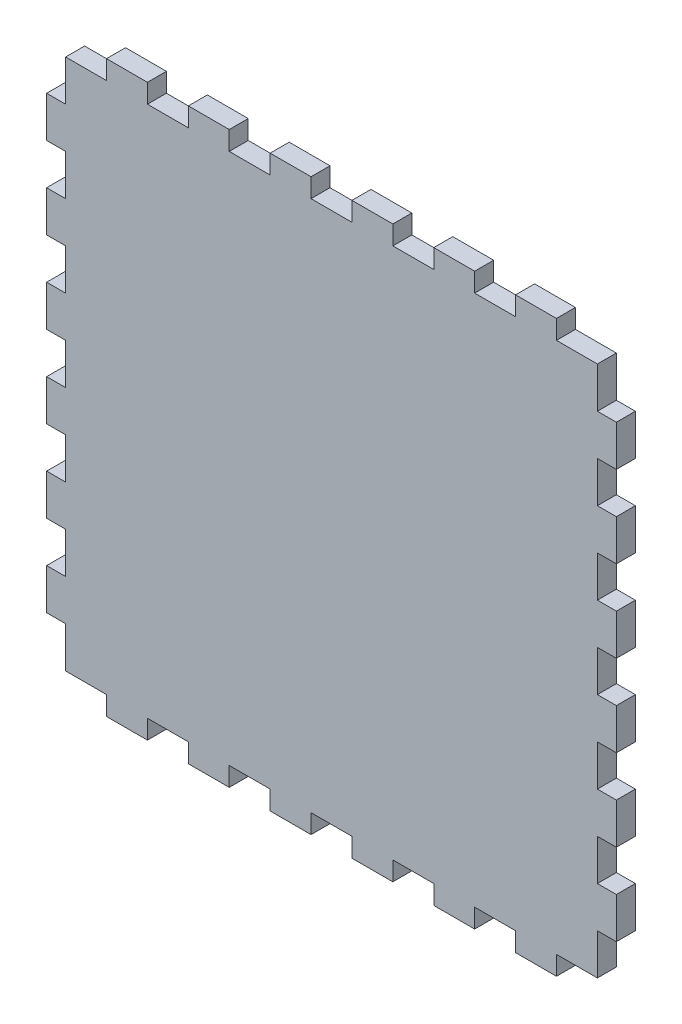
ISO-10303-21;
HEADER;
FILE_DESCRIPTION(('STEP AP214'),'2;1');
FILE_NAME('part.step','',(''),(''),'','','');
FILE_SCHEMA(('AUTOMOTIVE_DESIGN { 1 0 10303 214 1 1 1 1 }'));
ENDSEC;
DATA;
#1=APPLICATION_CONTEXT('core data for automotive mechanical design processes');
#2=APPLICATION_PROTOCOL_DEFINITION('international standard','automotive_design',2000,#1);
#3=PRODUCT_CONTEXT('',#1,'mechanical');
#4=PRODUCT('Part','Part','',(#3));
#5=PRODUCT_RELATED_PRODUCT_CATEGORY('part','',(#4));
#6=PRODUCT_DEFINITION_FORMATION('','',#4);
#7=PRODUCT_DEFINITION_CONTEXT('part definition',#1,'design');
#8=PRODUCT_DEFINITION('design','',#6,#7);
#9=PRODUCT_DEFINITION_SHAPE('','',#8);
#10=(LENGTH_UNIT() NAMED_UNIT(*) SI_UNIT(.MILLI.,.METRE.));
#11=(NAMED_UNIT(*) PLANE_ANGLE_UNIT() SI_UNIT($,.RADIAN.));
#12=(NAMED_UNIT(*) SI_UNIT($,.STERADIAN.) SOLID_ANGLE_UNIT());
#13=UNCERTAINTY_MEASURE_WITH_UNIT(LENGTH_MEASURE(1.E-05),#10,'distance_accuracy_value','');
#14=(GEOMETRIC_REPRESENTATION_CONTEXT(3) GLOBAL_UNCERTAINTY_ASSIGNED_CONTEXT((#13)) GLOBAL_UNIT_ASSIGNED_CONTEXT((#10,
#11,#12)) REPRESENTATION_CONTEXT('',''));
#15=CARTESIAN_POINT('',(0.,0.,0.));
#16=DIRECTION('',(0.,0.,1.));
#17=DIRECTION('',(1.,0.,0.));
#18=AXIS2_PLACEMENT_3D('',#15,#16,#17);
#19=CARTESIAN_POINT('',(0.,294.62,4.));
#20=DIRECTION('',(0.,1.,0.));
#21=DIRECTION('',(0.,0.,1.));
#22=AXIS2_PLACEMENT_3D('',#19,#20,#21);
#23=PLANE('',#22);
#24=DIRECTION('',(1.,0.,0.));
#25=VECTOR('',#24,1.);
#26=CARTESIAN_POINT('',(0.,294.62,0.));
#27=LINE('',#26,#25);
#28=CARTESIAN_POINT('',(79.,294.62,0.));
#29=VERTEX_POINT('',#28);
#30=CARTESIAN_POINT('',(83.,294.62,0.));
#31=VERTEX_POINT('',#30);
#32=EDGE_CURVE('E684',#29,#31,#27,.T.);
#33=ORIENTED_EDGE('',*,*,#32,.T.);
#34=DIRECTION('',(0.,0.,-1.));
#35=VECTOR('',#34,1.);
#36=CARTESIAN_POINT('',(83.,294.62,4.));
#37=LINE('',#36,#35);
#38=CARTESIAN_POINT('',(83.,294.62,4.));
#39=VERTEX_POINT('',#38);
#40=EDGE_CURVE('E11',#39,#31,#37,.T.);
#41=ORIENTED_EDGE('',*,*,#40,.F.);
#42=DIRECTION('',(1.,0.,0.));
#43=VECTOR('',#42,1.);
#44=CARTESIAN_POINT('',(0.,294.62,4.));
#45=LINE('',#44,#43);
#46=CARTESIAN_POINT('',(79.,294.62,4.));
#47=VERTEX_POINT('',#46);
#48=EDGE_CURVE('E882',#47,#39,#45,.T.);
#49=ORIENTED_EDGE('',*,*,#48,.F.);
#50=DIRECTION('',(0.,0.,-1.));
#51=VECTOR('',#50,1.);
#52=CARTESIAN_POINT('',(79.,294.62,4.));
#53=LINE('',#52,#51);
#54=EDGE_CURVE('E680',#47,#29,#53,.T.);
#55=ORIENTED_EDGE('',*,*,#54,.T.);
#56=EDGE_LOOP('',(#33,#41,#49,#55));
#57=FACE_BOUND('',#56,.T.);
#58=ADVANCED_FACE('F36',(#57),#23,.F.);
#59=CARTESIAN_POINT('',(83.,0.,4.));
#60=DIRECTION('',(1.,0.,0.));
#61=DIRECTION('',(0.,0.,-1.));
#62=AXIS2_PLACEMENT_3D('',#59,#60,#61);
#63=PLANE('',#62);
#64=DIRECTION('',(0.,-1.,0.));
#65=VECTOR('',#64,1.);
#66=CARTESIAN_POINT('',(83.,0.,0.));
#67=LINE('',#66,#65);
#68=CARTESIAN_POINT('',(83.,286.,0.));
#69=VERTEX_POINT('',#68);
#70=EDGE_CURVE('E687',#31,#69,#67,.T.);
#71=ORIENTED_EDGE('',*,*,#70,.T.);
#72=DIRECTION('',(0.,0.,-1.));
#73=VECTOR('',#72,1.);
#74=CARTESIAN_POINT('',(83.,286.,4.));
#75=LINE('',#74,#73);
#76=CARTESIAN_POINT('',(83.,286.,4.));
#77=VERTEX_POINT('',#76);
#78=EDGE_CURVE('E44',#77,#69,#75,.T.);
#79=ORIENTED_EDGE('',*,*,#78,.F.);
#80=DIRECTION('',(0.,-1.,0.));
#81=VECTOR('',#80,1.);
#82=CARTESIAN_POINT('',(83.,0.,4.));
#83=LINE('',#82,#81);
#84=EDGE_CURVE('E371',#39,#77,#83,.T.);
#85=ORIENTED_EDGE('',*,*,#84,.F.);
#86=ORIENTED_EDGE('',*,*,#40,.T.);
#87=EDGE_LOOP('',(#71,#79,#85,#86));
#88=FACE_BOUND('',#87,.T.);
#89=ADVANCED_FACE('F1400',(#88),#63,.F.);
#90=CARTESIAN_POINT('',(0.,286.,4.));
#91=DIRECTION('',(0.,1.,0.));
#92=DIRECTION('',(0.,0.,1.));
#93=AXIS2_PLACEMENT_3D('',#90,#91,#92);
#94=PLANE('',#93);
#95=DIRECTION('',(1.,0.,0.));
#96=VECTOR('',#95,1.);
#97=CARTESIAN_POINT('',(0.,286.,0.));
#98=LINE('',#97,#96);
#99=CARTESIAN_POINT('',(91.61,286.,0.));
#100=VERTEX_POINT('',#99);
#101=EDGE_CURVE('E689',#69,#100,#98,.T.);
#102=ORIENTED_EDGE('',*,*,#101,.T.);
#103=DIRECTION('',(0.,0.,-1.));
#104=VECTOR('',#103,1.);
#105=CARTESIAN_POINT('',(91.61,286.,4.));
#106=LINE('',#105,#104);
#107=CARTESIAN_POINT('',(91.61,286.,4.));
#108=VERTEX_POINT('',#107);
#109=EDGE_CURVE('E1165',#108,#100,#106,.T.);
#110=ORIENTED_EDGE('',*,*,#109,.F.);
#111=DIRECTION('',(1.,0.,0.));
#112=VECTOR('',#111,1.);
#113=CARTESIAN_POINT('',(0.,286.,4.));
#114=LINE('',#113,#112);
#115=EDGE_CURVE('E1173',#77,#108,#114,.T.);
#116=ORIENTED_EDGE('',*,*,#115,.F.);
#117=ORIENTED_EDGE('',*,*,#78,.T.);
#118=EDGE_LOOP('',(#102,#110,#116,#117));
#119=FACE_BOUND('',#118,.T.);
#120=ADVANCED_FACE('F1171',(#119),#94,.F.);
#121=CARTESIAN_POINT('',(91.61,0.,4.));
#122=DIRECTION('',(1.,0.,0.));
#123=DIRECTION('',(0.,0.,-1.));
#124=AXIS2_PLACEMENT_3D('',#121,#122,#123);
#125=PLANE('',#124);
#126=DIRECTION('',(0.,-1.,0.));
#127=VECTOR('',#126,1.);
#128=CARTESIAN_POINT('',(91.61,0.,0.));
#129=LINE('',#128,#127);
#130=CARTESIAN_POINT('',(91.61,282.,0.));
#131=VERTEX_POINT('',#130);
#132=EDGE_CURVE('E691',#100,#131,#129,.T.);
#133=ORIENTED_EDGE('',*,*,#132,.T.);
#134=DIRECTION('',(0.,0.,-1.));
#135=VECTOR('',#134,1.);
#136=CARTESIAN_POINT('',(91.61,282.,4.));
#137=LINE('',#136,#135);
#138=CARTESIAN_POINT('',(91.61,282.,4.));
#139=VERTEX_POINT('',#138);
#140=EDGE_CURVE('E1162',#139,#131,#137,.T.);
#141=ORIENTED_EDGE('',*,*,#140,.F.);
#142=DIRECTION('',(0.,-1.,0.));
#143=VECTOR('',#142,1.);
#144=CARTESIAN_POINT('',(91.61,0.,4.));
#145=LINE('',#144,#143);
#146=EDGE_CURVE('E1191',#108,#139,#145,.T.);
#147=ORIENTED_EDGE('',*,*,#146,.F.);
#148=ORIENTED_EDGE('',*,*,#109,.T.);
#149=EDGE_LOOP('',(#133,#141,#147,#148));
#150=FACE_BOUND('',#149,.T.);
#151=ADVANCED_FACE('F1182',(#150),#125,.F.);
#152=CARTESIAN_POINT('',(0.,282.,4.));
#153=DIRECTION('',(0.,1.,0.));
#154=DIRECTION('',(0.,0.,1.));
#155=AXIS2_PLACEMENT_3D('',#152,#153,#154);
#156=PLANE('',#155);
#157=DIRECTION('',(1.,0.,0.));
#158=VECTOR('',#157,1.);
#159=CARTESIAN_POINT('',(0.,282.,0.));
#160=LINE('',#159,#158);
#161=CARTESIAN_POINT('',(100.23,282.,0.));
#162=VERTEX_POINT('',#161);
#163=EDGE_CURVE('E693',#131,#162,#160,.T.);
#164=ORIENTED_EDGE('',*,*,#163,.T.);
#165=DIRECTION('',(0.,0.,-1.));
#166=VECTOR('',#165,1.);
#167=CARTESIAN_POINT('',(100.23,282.,4.));
#168=LINE('',#167,#166);
#169=CARTESIAN_POINT('',(100.23,282.,4.));
#170=VERTEX_POINT('',#169);
#171=EDGE_CURVE('E1159',#170,#162,#168,.T.);
#172=ORIENTED_EDGE('',*,*,#171,.F.);
#173=DIRECTION('',(1.,0.,0.));
#174=VECTOR('',#173,1.);
#175=CARTESIAN_POINT('',(0.,282.,4.));
#176=LINE('',#175,#174);
#177=EDGE_CURVE('E1188',#139,#170,#176,.T.);
#178=ORIENTED_EDGE('',*,*,#177,.F.);
#179=ORIENTED_EDGE('',*,*,#140,.T.);
#180=EDGE_LOOP('',(#164,#172,#178,#179));
#181=FACE_BOUND('',#180,.T.);
#182=ADVANCED_FACE('F1186',(#181),#156,.F.);
#183=CARTESIAN_POINT('',(100.23,0.,4.));
#184=DIRECTION('',(-1.,0.,0.));
#185=DIRECTION('',(0.,0.,1.));
#186=AXIS2_PLACEMENT_3D('',#183,#184,#185);
#187=PLANE('',#186);
#188=DIRECTION('',(0.,1.,0.));
#189=VECTOR('',#188,1.);
#190=CARTESIAN_POINT('',(100.23,0.,0.));
#191=LINE('',#190,#189);
#192=CARTESIAN_POINT('',(100.23,286.,0.));
#193=VERTEX_POINT('',#192);
#194=EDGE_CURVE('E695',#162,#193,#191,.T.);
#195=ORIENTED_EDGE('',*,*,#194,.T.);
#196=DIRECTION('',(0.,0.,-1.));
#197=VECTOR('',#196,1.);
#198=CARTESIAN_POINT('',(100.23,286.,4.));
#199=LINE('',#198,#197);
#200=CARTESIAN_POINT('',(100.23,286.,4.));
#201=VERTEX_POINT('',#200);
#202=EDGE_CURVE('E1156',#201,#193,#199,.T.);
#203=ORIENTED_EDGE('',*,*,#202,.F.);
#204=DIRECTION('',(0.,1.,0.));
#205=VECTOR('',#204,1.);
#206=CARTESIAN_POINT('',(100.23,0.,4.));
#207=LINE('',#206,#205);
#208=EDGE_CURVE('E1190',#170,#201,#207,.T.);
#209=ORIENTED_EDGE('',*,*,#208,.F.);
#210=ORIENTED_EDGE('',*,*,#171,.T.);
#211=EDGE_LOOP('',(#195,#203,#209,#210));
#212=FACE_BOUND('',#211,.T.);
#213=ADVANCED_FACE('F1413',(#212),#187,.F.);
#214=CARTESIAN_POINT('',(0.,286.,4.));
#215=DIRECTION('',(0.,1.,0.));
#216=DIRECTION('',(0.,0.,1.));
#217=AXIS2_PLACEMENT_3D('',#214,#215,#216);
#218=PLANE('',#217);
#219=DIRECTION('',(1.,0.,0.));
#220=VECTOR('',#219,1.);
#221=CARTESIAN_POINT('',(0.,286.,0.));
#222=LINE('',#221,#220);
#223=CARTESIAN_POINT('',(108.85,286.,0.));
#224=VERTEX_POINT('',#223);
#225=EDGE_CURVE('E697',#193,#224,#222,.T.);
#226=ORIENTED_EDGE('',*,*,#225,.T.);
#227=DIRECTION('',(0.,0.,-1.));
#228=VECTOR('',#227,1.);
#229=CARTESIAN_POINT('',(108.85,286.,4.));
#230=LINE('',#229,#228);
#231=CARTESIAN_POINT('',(108.85,286.,4.));
#232=VERTEX_POINT('',#231);
#233=EDGE_CURVE('E1153',#232,#224,#230,.T.);
#234=ORIENTED_EDGE('',*,*,#233,.F.);
#235=DIRECTION('',(1.,0.,0.));
#236=VECTOR('',#235,1.);
#237=CARTESIAN_POINT('',(0.,286.,4.));
#238=LINE('',#237,#236);
#239=EDGE_CURVE('E1193',#201,#232,#238,.T.);
#240=ORIENTED_EDGE('',*,*,#239,.F.);
#241=ORIENTED_EDGE('',*,*,#202,.T.);
#242=EDGE_LOOP('',(#226,#234,#240,#241));
#243=FACE_BOUND('',#242,.T.);
#244=ADVANCED_FACE('F1416',(#243),#218,.F.);
#245=CARTESIAN_POINT('',(108.85,0.,4.));
#246=DIRECTION('',(1.,0.,0.));
#247=DIRECTION('',(0.,0.,-1.));
#248=AXIS2_PLACEMENT_3D('',#245,#246,#247);
#249=PLANE('',#248);
#250=DIRECTION('',(0.,-1.,0.));
#251=VECTOR('',#250,1.);
#252=CARTESIAN_POINT('',(108.85,0.,0.));
#253=LINE('',#252,#251);
#254=CARTESIAN_POINT('',(108.85,282.,0.));
#255=VERTEX_POINT('',#254);
#256=EDGE_CURVE('E699',#224,#255,#253,.T.);
#257=ORIENTED_EDGE('',*,*,#256,.T.);
#258=DIRECTION('',(0.,0.,-1.));
#259=VECTOR('',#258,1.);
#260=CARTESIAN_POINT('',(108.85,282.,4.));
#261=LINE('',#260,#259);
#262=CARTESIAN_POINT('',(108.85,282.,4.));
#263=VERTEX_POINT('',#262);
#264=EDGE_CURVE('E1150',#263,#255,#261,.T.);
#265=ORIENTED_EDGE('',*,*,#264,.F.);
#266=DIRECTION('',(0.,-1.,0.));
#267=VECTOR('',#266,1.);
#268=CARTESIAN_POINT('',(108.85,0.,4.));
#269=LINE('',#268,#267);
#270=EDGE_CURVE('E1199',#232,#263,#269,.T.);
#271=ORIENTED_EDGE('',*,*,#270,.F.);
#272=ORIENTED_EDGE('',*,*,#233,.T.);
#273=EDGE_LOOP('',(#257,#265,#271,#272));
#274=FACE_BOUND('',#273,.T.);
#275=ADVANCED_FACE('F1420',(#274),#249,.F.);
#276=CARTESIAN_POINT('',(0.,282.,4.));
#277=DIRECTION('',(0.,1.,0.));
#278=DIRECTION('',(0.,0.,1.));
#279=AXIS2_PLACEMENT_3D('',#276,#277,#278);
#280=PLANE('',#279);
#281=DIRECTION('',(1.,0.,0.));
#282=VECTOR('',#281,1.);
#283=CARTESIAN_POINT('',(0.,282.,0.));
#284=LINE('',#283,#282);
#285=CARTESIAN_POINT('',(117.46,282.,0.));
#286=VERTEX_POINT('',#285);
#287=EDGE_CURVE('E701',#255,#286,#284,.T.);
#288=ORIENTED_EDGE('',*,*,#287,.T.);
#289=DIRECTION('',(0.,0.,-1.));
#290=VECTOR('',#289,1.);
#291=CARTESIAN_POINT('',(117.46,282.,4.));
#292=LINE('',#291,#290);
#293=CARTESIAN_POINT('',(117.46,282.,4.));
#294=VERTEX_POINT('',#293);
#295=EDGE_CURVE('E1147',#294,#286,#292,.T.);
#296=ORIENTED_EDGE('',*,*,#295,.F.);
#297=DIRECTION('',(1.,0.,0.));
#298=VECTOR('',#297,1.);
#299=CARTESIAN_POINT('',(0.,282.,4.));
#300=LINE('',#299,#298);
#301=EDGE_CURVE('E1201',#263,#294,#300,.T.);
#302=ORIENTED_EDGE('',*,*,#301,.F.);
#303=ORIENTED_EDGE('',*,*,#264,.T.);
#304=EDGE_LOOP('',(#288,#296,#302,#303));
#305=FACE_BOUND('',#304,.T.);
#306=ADVANCED_FACE('F1424',(#305),#280,.F.);
#307=CARTESIAN_POINT('',(117.46,0.,4.));
#308=DIRECTION('',(-1.,0.,0.));
#309=DIRECTION('',(0.,0.,1.));
#310=AXIS2_PLACEMENT_3D('',#307,#308,#309);
#311=PLANE('',#310);
#312=DIRECTION('',(0.,1.,0.));
#313=VECTOR('',#312,1.);
#314=CARTESIAN_POINT('',(117.46,0.,0.));
#315=LINE('',#314,#313);
#316=CARTESIAN_POINT('',(117.46,286.,0.));
#317=VERTEX_POINT('',#316);
#318=EDGE_CURVE('E703',#286,#317,#315,.T.);
#319=ORIENTED_EDGE('',*,*,#318,.T.);
#320=DIRECTION('',(0.,0.,-1.));
#321=VECTOR('',#320,1.);
#322=CARTESIAN_POINT('',(117.46,286.,4.));
#323=LINE('',#322,#321);
#324=CARTESIAN_POINT('',(117.46,286.,4.));
#325=VERTEX_POINT('',#324);
#326=EDGE_CURVE('E1144',#325,#317,#323,.T.);
#327=ORIENTED_EDGE('',*,*,#326,.F.);
#328=DIRECTION('',(0.,1.,0.));
#329=VECTOR('',#328,1.);
#330=CARTESIAN_POINT('',(117.46,0.,4.));
#331=LINE('',#330,#329);
#332=EDGE_CURVE('E1203',#294,#325,#331,.T.);
#333=ORIENTED_EDGE('',*,*,#332,.F.);
#334=ORIENTED_EDGE('',*,*,#295,.T.);
#335=EDGE_LOOP('',(#319,#327,#333,#334));
#336=FACE_BOUND('',#335,.T.);
#337=ADVANCED_FACE('F1428',(#336),#311,.F.);
#338=CARTESIAN_POINT('',(0.,286.,4.));
#339=DIRECTION('',(0.,1.,0.));
#340=DIRECTION('',(0.,0.,1.));
#341=AXIS2_PLACEMENT_3D('',#338,#339,#340);
#342=PLANE('',#341);
#343=DIRECTION('',(1.,0.,0.));
#344=VECTOR('',#343,1.);
#345=CARTESIAN_POINT('',(0.,286.,0.));
#346=LINE('',#345,#344);
#347=CARTESIAN_POINT('',(126.08,286.,0.));
#348=VERTEX_POINT('',#347);
#349=EDGE_CURVE('E705',#317,#348,#346,.T.);
#350=ORIENTED_EDGE('',*,*,#349,.T.);
#351=DIRECTION('',(0.,0.,-1.));
#352=VECTOR('',#351,1.);
#353=CARTESIAN_POINT('',(126.08,286.,4.));
#354=LINE('',#353,#352);
#355=CARTESIAN_POINT('',(126.08,286.,4.));
#356=VERTEX_POINT('',#355);
#357=EDGE_CURVE('E1141',#356,#348,#354,.T.);
#358=ORIENTED_EDGE('',*,*,#357,.F.);
#359=DIRECTION('',(1.,0.,0.));
#360=VECTOR('',#359,1.);
#361=CARTESIAN_POINT('',(0.,286.,4.));
#362=LINE('',#361,#360);
#363=EDGE_CURVE('E1205',#325,#356,#362,.T.);
#364=ORIENTED_EDGE('',*,*,#363,.F.);
#365=ORIENTED_EDGE('',*,*,#326,.T.);
#366=EDGE_LOOP('',(#350,#358,#364,#365));
#367=FACE_BOUND('',#366,.T.);
#368=ADVANCED_FACE('F1432',(#367),#342,.F.);
#369=CARTESIAN_POINT('',(126.08,0.,4.));
#370=DIRECTION('',(1.,0.,0.));
#371=DIRECTION('',(0.,0.,-1.));
#372=AXIS2_PLACEMENT_3D('',#369,#370,#371);
#373=PLANE('',#372);
#374=DIRECTION('',(0.,-1.,0.));
#375=VECTOR('',#374,1.);
#376=CARTESIAN_POINT('',(126.08,0.,0.));
#377=LINE('',#376,#375);
#378=CARTESIAN_POINT('',(126.08,282.,0.));
#379=VERTEX_POINT('',#378);
#380=EDGE_CURVE('E707',#348,#379,#377,.T.);
#381=ORIENTED_EDGE('',*,*,#380,.T.);
#382=DIRECTION('',(0.,0.,-1.));
#383=VECTOR('',#382,1.);
#384=CARTESIAN_POINT('',(126.08,282.,4.));
#385=LINE('',#384,#383);
#386=CARTESIAN_POINT('',(126.08,282.,4.));
#387=VERTEX_POINT('',#386);
#388=EDGE_CURVE('E1138',#387,#379,#385,.T.);
#389=ORIENTED_EDGE('',*,*,#388,.F.);
#390=DIRECTION('',(0.,-1.,0.));
#391=VECTOR('',#390,1.);
#392=CARTESIAN_POINT('',(126.08,0.,4.));
#393=LINE('',#392,#391);
#394=EDGE_CURVE('E1207',#356,#387,#393,.T.);
#395=ORIENTED_EDGE('',*,*,#394,.F.);
#396=ORIENTED_EDGE('',*,*,#357,.T.);
#397=EDGE_LOOP('',(#381,#389,#395,#396));
#398=FACE_BOUND('',#397,.T.);
#399=ADVANCED_FACE('F1436',(#398),#373,.F.);
#400=CARTESIAN_POINT('',(0.,282.,4.));
#401=DIRECTION('',(0.,1.,0.));
#402=DIRECTION('',(0.,0.,1.));
#403=AXIS2_PLACEMENT_3D('',#400,#401,#402);
#404=PLANE('',#403);
#405=DIRECTION('',(1.,0.,0.));
#406=VECTOR('',#405,1.);
#407=CARTESIAN_POINT('',(0.,282.,0.));
#408=LINE('',#407,#406);
#409=CARTESIAN_POINT('',(134.69,282.,0.));
#410=VERTEX_POINT('',#409);
#411=EDGE_CURVE('E709',#379,#410,#408,.T.);
#412=ORIENTED_EDGE('',*,*,#411,.T.);
#413=DIRECTION('',(0.,0.,-1.));
#414=VECTOR('',#413,1.);
#415=CARTESIAN_POINT('',(134.69,282.,4.));
#416=LINE('',#415,#414);
#417=CARTESIAN_POINT('',(134.69,282.,4.));
#418=VERTEX_POINT('',#417);
#419=EDGE_CURVE('E1135',#418,#410,#416,.T.);
#420=ORIENTED_EDGE('',*,*,#419,.F.);
#421=DIRECTION('',(1.,0.,0.));
#422=VECTOR('',#421,1.);
#423=CARTESIAN_POINT('',(0.,282.,4.));
#424=LINE('',#423,#422);
#425=EDGE_CURVE('E1209',#387,#418,#424,.T.);
#426=ORIENTED_EDGE('',*,*,#425,.F.);
#427=ORIENTED_EDGE('',*,*,#388,.T.);
#428=EDGE_LOOP('',(#412,#420,#426,#427));
#429=FACE_BOUND('',#428,.T.);
#430=ADVANCED_FACE('F1440',(#429),#404,.F.);
#431=CARTESIAN_POINT('',(134.69,0.,4.));
#432=DIRECTION('',(-1.,0.,0.));
#433=DIRECTION('',(0.,0.,1.));
#434=AXIS2_PLACEMENT_3D('',#431,#432,#433);
#435=PLANE('',#434);
#436=DIRECTION('',(0.,1.,0.));
#437=VECTOR('',#436,1.);
#438=CARTESIAN_POINT('',(134.69,0.,0.));
#439=LINE('',#438,#437);
#440=CARTESIAN_POINT('',(134.69,286.,0.));
#441=VERTEX_POINT('',#440);
#442=EDGE_CURVE('E711',#410,#441,#439,.T.);
#443=ORIENTED_EDGE('',*,*,#442,.T.);
#444=DIRECTION('',(0.,0.,-1.));
#445=VECTOR('',#444,1.);
#446=CARTESIAN_POINT('',(134.69,286.,4.));
#447=LINE('',#446,#445);
#448=CARTESIAN_POINT('',(134.69,286.,4.));
#449=VERTEX_POINT('',#448);
#450=EDGE_CURVE('E1132',#449,#441,#447,.T.);
#451=ORIENTED_EDGE('',*,*,#450,.F.);
#452=DIRECTION('',(0.,1.,0.));
#453=VECTOR('',#452,1.);
#454=CARTESIAN_POINT('',(134.69,0.,4.));
#455=LINE('',#454,#453);
#456=EDGE_CURVE('E1211',#418,#449,#455,.T.);
#457=ORIENTED_EDGE('',*,*,#456,.F.);
#458=ORIENTED_EDGE('',*,*,#419,.T.);
#459=EDGE_LOOP('',(#443,#451,#457,#458));
#460=FACE_BOUND('',#459,.T.);
#461=ADVANCED_FACE('F1444',(#460),#435,.F.);
#462=CARTESIAN_POINT('',(0.,286.,4.));
#463=DIRECTION('',(0.,1.,0.));
#464=DIRECTION('',(0.,0.,1.));
#465=AXIS2_PLACEMENT_3D('',#462,#463,#464);
#466=PLANE('',#465);
#467=DIRECTION('',(1.,0.,0.));
#468=VECTOR('',#467,1.);
#469=CARTESIAN_POINT('',(0.,286.,0.));
#470=LINE('',#469,#468);
#471=CARTESIAN_POINT('',(143.31,286.,0.));
#472=VERTEX_POINT('',#471);
#473=EDGE_CURVE('E713',#441,#472,#470,.T.);
#474=ORIENTED_EDGE('',*,*,#473,.T.);
#475=DIRECTION('',(0.,0.,-1.));
#476=VECTOR('',#475,1.);
#477=CARTESIAN_POINT('',(143.31,286.,4.));
#478=LINE('',#477,#476);
#479=CARTESIAN_POINT('',(143.31,286.,4.));
#480=VERTEX_POINT('',#479);
#481=EDGE_CURVE('E1129',#480,#472,#478,.T.);
#482=ORIENTED_EDGE('',*,*,#481,.F.);
#483=DIRECTION('',(1.,0.,0.));
#484=VECTOR('',#483,1.);
#485=CARTESIAN_POINT('',(0.,286.,4.));
#486=LINE('',#485,#484);
#487=EDGE_CURVE('E1213',#449,#480,#486,.T.);
#488=ORIENTED_EDGE('',*,*,#487,.F.);
#489=ORIENTED_EDGE('',*,*,#450,.T.);
#490=EDGE_LOOP('',(#474,#482,#488,#489));
#491=FACE_BOUND('',#490,.T.);
#492=ADVANCED_FACE('F1448',(#491),#466,.F.);
#493=CARTESIAN_POINT('',(143.31,0.,4.));
#494=DIRECTION('',(1.,0.,0.));
#495=DIRECTION('',(0.,0.,-1.));
#496=AXIS2_PLACEMENT_3D('',#493,#494,#495);
#497=PLANE('',#496);
#498=DIRECTION('',(0.,-1.,0.));
#499=VECTOR('',#498,1.);
#500=CARTESIAN_POINT('',(143.31,0.,0.));
#501=LINE('',#500,#499);
#502=CARTESIAN_POINT('',(143.31,282.,0.));
#503=VERTEX_POINT('',#502);
#504=EDGE_CURVE('E715',#472,#503,#501,.T.);
#505=ORIENTED_EDGE('',*,*,#504,.T.);
#506=DIRECTION('',(0.,0.,-1.));
#507=VECTOR('',#506,1.);
#508=CARTESIAN_POINT('',(143.31,282.,4.));
#509=LINE('',#508,#507);
#510=CARTESIAN_POINT('',(143.31,282.,4.));
#511=VERTEX_POINT('',#510);
#512=EDGE_CURVE('E1126',#511,#503,#509,.T.);
#513=ORIENTED_EDGE('',*,*,#512,.F.);
#514=DIRECTION('',(0.,-1.,0.));
#515=VECTOR('',#514,1.);
#516=CARTESIAN_POINT('',(143.31,0.,4.));
#517=LINE('',#516,#515);
#518=EDGE_CURVE('E1215',#480,#511,#517,.T.);
#519=ORIENTED_EDGE('',*,*,#518,.F.);
#520=ORIENTED_EDGE('',*,*,#481,.T.);
#521=EDGE_LOOP('',(#505,#513,#519,#520));
#522=FACE_BOUND('',#521,.T.);
#523=ADVANCED_FACE('F1452',(#522),#497,.F.);
#524=CARTESIAN_POINT('',(0.,282.,4.));
#525=DIRECTION('',(0.,1.,0.));
#526=DIRECTION('',(0.,0.,1.));
#527=AXIS2_PLACEMENT_3D('',#524,#525,#526);
#528=PLANE('',#527);
#529=DIRECTION('',(1.,0.,0.));
#530=VECTOR('',#529,1.);
#531=CARTESIAN_POINT('',(0.,282.,0.));
#532=LINE('',#531,#530);
#533=CARTESIAN_POINT('',(151.92,282.,0.));
#534=VERTEX_POINT('',#533);
#535=EDGE_CURVE('E717',#503,#534,#532,.T.);
#536=ORIENTED_EDGE('',*,*,#535,.T.);
#537=DIRECTION('',(0.,0.,-1.));
#538=VECTOR('',#537,1.);
#539=CARTESIAN_POINT('',(151.92,282.,4.));
#540=LINE('',#539,#538);
#541=CARTESIAN_POINT('',(151.92,282.,4.));
#542=VERTEX_POINT('',#541);
#543=EDGE_CURVE('E1123',#542,#534,#540,.T.);
#544=ORIENTED_EDGE('',*,*,#543,.F.);
#545=DIRECTION('',(1.,0.,0.));
#546=VECTOR('',#545,1.);
#547=CARTESIAN_POINT('',(0.,282.,4.));
#548=LINE('',#547,#546);
#549=EDGE_CURVE('E1217',#511,#542,#548,.T.);
#550=ORIENTED_EDGE('',*,*,#549,.F.);
#551=ORIENTED_EDGE('',*,*,#512,.T.);
#552=EDGE_LOOP('',(#536,#544,#550,#551));
#553=FACE_BOUND('',#552,.T.);
#554=ADVANCED_FACE('F1456',(#553),#528,.F.);
#555=CARTESIAN_POINT('',(151.92,0.,4.));
#556=DIRECTION('',(-1.,0.,0.));
#557=DIRECTION('',(0.,0.,1.));
#558=AXIS2_PLACEMENT_3D('',#555,#556,#557);
#559=PLANE('',#558);
#560=DIRECTION('',(0.,1.,0.));
#561=VECTOR('',#560,1.);
#562=CARTESIAN_POINT('',(151.92,0.,0.));
#563=LINE('',#562,#561);
#564=CARTESIAN_POINT('',(151.92,286.,0.));
#565=VERTEX_POINT('',#564);
#566=EDGE_CURVE('E719',#534,#565,#563,.T.);
#567=ORIENTED_EDGE('',*,*,#566,.T.);
#568=DIRECTION('',(0.,0.,-1.));
#569=VECTOR('',#568,1.);
#570=CARTESIAN_POINT('',(151.92,286.,4.));
#571=LINE('',#570,#569);
#572=CARTESIAN_POINT('',(151.92,286.,4.));
#573=VERTEX_POINT('',#572);
#574=EDGE_CURVE('E1120',#573,#565,#571,.T.);
#575=ORIENTED_EDGE('',*,*,#574,.F.);
#576=DIRECTION('',(0.,1.,0.));
#577=VECTOR('',#576,1.);
#578=CARTESIAN_POINT('',(151.92,0.,4.));
#579=LINE('',#578,#577);
#580=EDGE_CURVE('E1219',#542,#573,#579,.T.);
#581=ORIENTED_EDGE('',*,*,#580,.F.);
#582=ORIENTED_EDGE('',*,*,#543,.T.);
#583=EDGE_LOOP('',(#567,#575,#581,#582));
#584=FACE_BOUND('',#583,.T.);
#585=ADVANCED_FACE('F1460',(#584),#559,.F.);
#586=CARTESIAN_POINT('',(0.,286.,4.));
#587=DIRECTION('',(0.,1.,0.));
#588=DIRECTION('',(0.,0.,1.));
#589=AXIS2_PLACEMENT_3D('',#586,#587,#588);
#590=PLANE('',#589);
#591=DIRECTION('',(1.,0.,0.));
#592=VECTOR('',#591,1.);
#593=CARTESIAN_POINT('',(0.,286.,0.));
#594=LINE('',#593,#592);
#595=CARTESIAN_POINT('',(160.54,286.,0.));
#596=VERTEX_POINT('',#595);
#597=EDGE_CURVE('E721',#565,#596,#594,.T.);
#598=ORIENTED_EDGE('',*,*,#597,.T.);
#599=DIRECTION('',(0.,0.,-1.));
#600=VECTOR('',#599,1.);
#601=CARTESIAN_POINT('',(160.54,286.,4.));
#602=LINE('',#601,#600);
#603=CARTESIAN_POINT('',(160.54,286.,4.));
#604=VERTEX_POINT('',#603);
#605=EDGE_CURVE('E1117',#604,#596,#602,.T.);
#606=ORIENTED_EDGE('',*,*,#605,.F.);
#607=DIRECTION('',(1.,0.,0.));
#608=VECTOR('',#607,1.);
#609=CARTESIAN_POINT('',(0.,286.,4.));
#610=LINE('',#609,#608);
#611=EDGE_CURVE('E1221',#573,#604,#610,.T.);
#612=ORIENTED_EDGE('',*,*,#611,.F.);
#613=ORIENTED_EDGE('',*,*,#574,.T.);
#614=EDGE_LOOP('',(#598,#606,#612,#613));
#615=FACE_BOUND('',#614,.T.);
#616=ADVANCED_FACE('F1464',(#615),#590,.F.);
#617=CARTESIAN_POINT('',(160.54,0.,4.));
#618=DIRECTION('',(1.,0.,0.));
#619=DIRECTION('',(0.,0.,-1.));
#620=AXIS2_PLACEMENT_3D('',#617,#618,#619);
#621=PLANE('',#620);
#622=DIRECTION('',(0.,-1.,0.));
#623=VECTOR('',#622,1.);
#624=CARTESIAN_POINT('',(160.54,0.,0.));
#625=LINE('',#624,#623);
#626=CARTESIAN_POINT('',(160.54,282.,0.));
#627=VERTEX_POINT('',#626);
#628=EDGE_CURVE('E723',#596,#627,#625,.T.);
#629=ORIENTED_EDGE('',*,*,#628,.T.);
#630=DIRECTION('',(0.,0.,-1.));
#631=VECTOR('',#630,1.);
#632=CARTESIAN_POINT('',(160.54,282.,4.));
#633=LINE('',#632,#631);
#634=CARTESIAN_POINT('',(160.54,282.,4.));
#635=VERTEX_POINT('',#634);
#636=EDGE_CURVE('E1114',#635,#627,#633,.T.);
#637=ORIENTED_EDGE('',*,*,#636,.F.);
#638=DIRECTION('',(0.,-1.,0.));
#639=VECTOR('',#638,1.);
#640=CARTESIAN_POINT('',(160.54,0.,4.));
#641=LINE('',#640,#639);
#642=EDGE_CURVE('E1223',#604,#635,#641,.T.);
#643=ORIENTED_EDGE('',*,*,#642,.F.);
#644=ORIENTED_EDGE('',*,*,#605,.T.);
#645=EDGE_LOOP('',(#629,#637,#643,#644));
#646=FACE_BOUND('',#645,.T.);
#647=ADVANCED_FACE('F1468',(#646),#621,.F.);
#648=CARTESIAN_POINT('',(0.,282.,4.));
#649=DIRECTION('',(0.,1.,0.));
#650=DIRECTION('',(0.,0.,1.));
#651=AXIS2_PLACEMENT_3D('',#648,#649,#650);
#652=PLANE('',#651);
#653=DIRECTION('',(1.,0.,0.));
#654=VECTOR('',#653,1.);
#655=CARTESIAN_POINT('',(0.,282.,0.));
#656=LINE('',#655,#654);
#657=CARTESIAN_POINT('',(169.15,282.,0.));
#658=VERTEX_POINT('',#657);
#659=EDGE_CURVE('E725',#627,#658,#656,.T.);
#660=ORIENTED_EDGE('',*,*,#659,.T.);
#661=DIRECTION('',(0.,0.,-1.));
#662=VECTOR('',#661,1.);
#663=CARTESIAN_POINT('',(169.15,282.,4.));
#664=LINE('',#663,#662);
#665=CARTESIAN_POINT('',(169.15,282.,4.));
#666=VERTEX_POINT('',#665);
#667=EDGE_CURVE('E1111',#666,#658,#664,.T.);
#668=ORIENTED_EDGE('',*,*,#667,.F.);
#669=DIRECTION('',(1.,0.,0.));
#670=VECTOR('',#669,1.);
#671=CARTESIAN_POINT('',(0.,282.,4.));
#672=LINE('',#671,#670);
#673=EDGE_CURVE('E1225',#635,#666,#672,.T.);
#674=ORIENTED_EDGE('',*,*,#673,.F.);
#675=ORIENTED_EDGE('',*,*,#636,.T.);
#676=EDGE_LOOP('',(#660,#668,#674,#675));
#677=FACE_BOUND('',#676,.T.);
#678=ADVANCED_FACE('F1472',(#677),#652,.F.);
#679=CARTESIAN_POINT('',(169.15,0.,4.));
#680=DIRECTION('',(-1.,0.,0.));
#681=DIRECTION('',(0.,0.,1.));
#682=AXIS2_PLACEMENT_3D('',#679,#680,#681);
#683=PLANE('',#682);
#684=DIRECTION('',(0.,1.,0.));
#685=VECTOR('',#684,1.);
#686=CARTESIAN_POINT('',(169.15,0.,0.));
#687=LINE('',#686,#685);
#688=CARTESIAN_POINT('',(169.15,286.,0.));
#689=VERTEX_POINT('',#688);
#690=EDGE_CURVE('E727',#658,#689,#687,.T.);
#691=ORIENTED_EDGE('',*,*,#690,.T.);
#692=DIRECTION('',(0.,0.,-1.));
#693=VECTOR('',#692,1.);
#694=CARTESIAN_POINT('',(169.15,286.,4.));
#695=LINE('',#694,#693);
#696=CARTESIAN_POINT('',(169.15,286.,4.));
#697=VERTEX_POINT('',#696);
#698=EDGE_CURVE('E1108',#697,#689,#695,.T.);
#699=ORIENTED_EDGE('',*,*,#698,.F.);
#700=DIRECTION('',(0.,1.,0.));
#701=VECTOR('',#700,1.);
#702=CARTESIAN_POINT('',(169.15,0.,4.));
#703=LINE('',#702,#701);
#704=EDGE_CURVE('E1227',#666,#697,#703,.T.);
#705=ORIENTED_EDGE('',*,*,#704,.F.);
#706=ORIENTED_EDGE('',*,*,#667,.T.);
#707=EDGE_LOOP('',(#691,#699,#705,#706));
#708=FACE_BOUND('',#707,.T.);
#709=ADVANCED_FACE('F1476',(#708),#683,.F.);
#710=CARTESIAN_POINT('',(0.,286.,4.));
#711=DIRECTION('',(0.,1.,0.));
#712=DIRECTION('',(0.,0.,1.));
#713=AXIS2_PLACEMENT_3D('',#710,#711,#712);
#714=PLANE('',#713);
#715=DIRECTION('',(1.,0.,0.));
#716=VECTOR('',#715,1.);
#717=CARTESIAN_POINT('',(0.,286.,0.));
#718=LINE('',#717,#716);
#719=CARTESIAN_POINT('',(177.77,286.,0.));
#720=VERTEX_POINT('',#719);
#721=EDGE_CURVE('E729',#689,#720,#718,.T.);
#722=ORIENTED_EDGE('',*,*,#721,.T.);
#723=DIRECTION('',(0.,0.,-1.));
#724=VECTOR('',#723,1.);
#725=CARTESIAN_POINT('',(177.77,286.,4.));
#726=LINE('',#725,#724);
#727=CARTESIAN_POINT('',(177.77,286.,4.));
#728=VERTEX_POINT('',#727);
#729=EDGE_CURVE('E1105',#728,#720,#726,.T.);
#730=ORIENTED_EDGE('',*,*,#729,.F.);
#731=DIRECTION('',(1.,0.,0.));
#732=VECTOR('',#731,1.);
#733=CARTESIAN_POINT('',(0.,286.,4.));
#734=LINE('',#733,#732);
#735=EDGE_CURVE('E1229',#697,#728,#734,.T.);
#736=ORIENTED_EDGE('',*,*,#735,.F.);
#737=ORIENTED_EDGE('',*,*,#698,.T.);
#738=EDGE_LOOP('',(#722,#730,#736,#737));
#739=FACE_BOUND('',#738,.T.);
#740=ADVANCED_FACE('F1480',(#739),#714,.F.);
#741=CARTESIAN_POINT('',(177.77,0.,4.));
#742=DIRECTION('',(1.,0.,0.));
#743=DIRECTION('',(0.,0.,-1.));
#744=AXIS2_PLACEMENT_3D('',#741,#742,#743);
#745=PLANE('',#744);
#746=DIRECTION('',(0.,-1.,0.));
#747=VECTOR('',#746,1.);
#748=CARTESIAN_POINT('',(177.77,0.,0.));
#749=LINE('',#748,#747);
#750=CARTESIAN_POINT('',(177.77,282.,0.));
#751=VERTEX_POINT('',#750);
#752=EDGE_CURVE('E731',#720,#751,#749,.T.);
#753=ORIENTED_EDGE('',*,*,#752,.T.);
#754=DIRECTION('',(0.,0.,-1.));
#755=VECTOR('',#754,1.);
#756=CARTESIAN_POINT('',(177.77,282.,4.));
#757=LINE('',#756,#755);
#758=CARTESIAN_POINT('',(177.77,282.,4.));
#759=VERTEX_POINT('',#758);
#760=EDGE_CURVE('E1102',#759,#751,#757,.T.);
#761=ORIENTED_EDGE('',*,*,#760,.F.);
#762=DIRECTION('',(0.,-1.,0.));
#763=VECTOR('',#762,1.);
#764=CARTESIAN_POINT('',(177.77,0.,4.));
#765=LINE('',#764,#763);
#766=EDGE_CURVE('E1231',#728,#759,#765,.T.);
#767=ORIENTED_EDGE('',*,*,#766,.F.);
#768=ORIENTED_EDGE('',*,*,#729,.T.);
#769=EDGE_LOOP('',(#753,#761,#767,#768));
#770=FACE_BOUND('',#769,.T.);
#771=ADVANCED_FACE('F1484',(#770),#745,.F.);
#772=CARTESIAN_POINT('',(0.,282.,4.));
#773=DIRECTION('',(0.,1.,0.));
#774=DIRECTION('',(0.,0.,1.));
#775=AXIS2_PLACEMENT_3D('',#772,#773,#774);
#776=PLANE('',#775);
#777=DIRECTION('',(1.,0.,0.));
#778=VECTOR('',#777,1.);
#779=CARTESIAN_POINT('',(0.,282.,0.));
#780=LINE('',#779,#778);
#781=CARTESIAN_POINT('',(186.38,282.,0.));
#782=VERTEX_POINT('',#781);
#783=EDGE_CURVE('E733',#751,#782,#780,.T.);
#784=ORIENTED_EDGE('',*,*,#783,.T.);
#785=DIRECTION('',(0.,0.,-1.));
#786=VECTOR('',#785,1.);
#787=CARTESIAN_POINT('',(186.38,282.,4.));
#788=LINE('',#787,#786);
#789=CARTESIAN_POINT('',(186.38,282.,4.));
#790=VERTEX_POINT('',#789);
#791=EDGE_CURVE('E1099',#790,#782,#788,.T.);
#792=ORIENTED_EDGE('',*,*,#791,.F.);
#793=DIRECTION('',(1.,0.,0.));
#794=VECTOR('',#793,1.);
#795=CARTESIAN_POINT('',(0.,282.,4.));
#796=LINE('',#795,#794);
#797=EDGE_CURVE('E1233',#759,#790,#796,.T.);
#798=ORIENTED_EDGE('',*,*,#797,.F.);
#799=ORIENTED_EDGE('',*,*,#760,.T.);
#800=EDGE_LOOP('',(#784,#792,#798,#799));
#801=FACE_BOUND('',#800,.T.);
#802=ADVANCED_FACE('F1488',(#801),#776,.F.);
#803=CARTESIAN_POINT('',(186.38,0.,4.));
#804=DIRECTION('',(-1.,0.,0.));
#805=DIRECTION('',(0.,0.,1.));
#806=AXIS2_PLACEMENT_3D('',#803,#804,#805);
#807=PLANE('',#806);
#808=DIRECTION('',(0.,1.,0.));
#809=VECTOR('',#808,1.);
#810=CARTESIAN_POINT('',(186.38,0.,0.));
#811=LINE('',#810,#809);
#812=CARTESIAN_POINT('',(186.38,286.,0.));
#813=VERTEX_POINT('',#812);
#814=EDGE_CURVE('E735',#782,#813,#811,.T.);
#815=ORIENTED_EDGE('',*,*,#814,.T.);
#816=DIRECTION('',(0.,0.,-1.));
#817=VECTOR('',#816,1.);
#818=CARTESIAN_POINT('',(186.38,286.,4.));
#819=LINE('',#818,#817);
#820=CARTESIAN_POINT('',(186.38,286.,4.));
#821=VERTEX_POINT('',#820);
#822=EDGE_CURVE('E1096',#821,#813,#819,.T.);
#823=ORIENTED_EDGE('',*,*,#822,.F.);
#824=DIRECTION('',(0.,1.,0.));
#825=VECTOR('',#824,1.);
#826=CARTESIAN_POINT('',(186.38,0.,4.));
#827=LINE('',#826,#825);
#828=EDGE_CURVE('E1235',#790,#821,#827,.T.);
#829=ORIENTED_EDGE('',*,*,#828,.F.);
#830=ORIENTED_EDGE('',*,*,#791,.T.);
#831=EDGE_LOOP('',(#815,#823,#829,#830));
#832=FACE_BOUND('',#831,.T.);
#833=ADVANCED_FACE('F1492',(#832),#807,.F.);
#834=CARTESIAN_POINT('',(0.,286.,4.));
#835=DIRECTION('',(0.,1.,0.));
#836=DIRECTION('',(0.,0.,1.));
#837=AXIS2_PLACEMENT_3D('',#834,#835,#836);
#838=PLANE('',#837);
#839=DIRECTION('',(1.,0.,0.));
#840=VECTOR('',#839,1.);
#841=CARTESIAN_POINT('',(0.,286.,0.));
#842=LINE('',#841,#840);
#843=CARTESIAN_POINT('',(195.,286.,0.));
#844=VERTEX_POINT('',#843);
#845=EDGE_CURVE('E737',#813,#844,#842,.T.);
#846=ORIENTED_EDGE('',*,*,#845,.T.);
#847=DIRECTION('',(0.,0.,-1.));
#848=VECTOR('',#847,1.);
#849=CARTESIAN_POINT('',(195.,286.,4.));
#850=LINE('',#849,#848);
#851=CARTESIAN_POINT('',(195.,286.,4.));
#852=VERTEX_POINT('',#851);
#853=EDGE_CURVE('E1093',#852,#844,#850,.T.);
#854=ORIENTED_EDGE('',*,*,#853,.F.);
#855=DIRECTION('',(1.,0.,0.));
#856=VECTOR('',#855,1.);
#857=CARTESIAN_POINT('',(0.,286.,4.));
#858=LINE('',#857,#856);
#859=EDGE_CURVE('E1237',#821,#852,#858,.T.);
#860=ORIENTED_EDGE('',*,*,#859,.F.);
#861=ORIENTED_EDGE('',*,*,#822,.T.);
#862=EDGE_LOOP('',(#846,#854,#860,#861));
#863=FACE_BOUND('',#862,.T.);
#864=ADVANCED_FACE('F1496',(#863),#838,.F.);
#865=CARTESIAN_POINT('',(195.,0.,4.));
#866=DIRECTION('',(-1.,0.,0.));
#867=DIRECTION('',(0.,0.,1.));
#868=AXIS2_PLACEMENT_3D('',#865,#866,#867);
#869=PLANE('',#868);
#870=DIRECTION('',(0.,1.,0.));
#871=VECTOR('',#870,1.);
#872=CARTESIAN_POINT('',(195.,0.,0.));
#873=LINE('',#872,#871);
#874=CARTESIAN_POINT('',(195.,294.62,0.));
#875=VERTEX_POINT('',#874);
#876=EDGE_CURVE('E739',#844,#875,#873,.T.);
#877=ORIENTED_EDGE('',*,*,#876,.T.);
#878=DIRECTION('',(0.,0.,-1.));
#879=VECTOR('',#878,1.);
#880=CARTESIAN_POINT('',(195.,294.62,4.));
#881=LINE('',#880,#879);
#882=CARTESIAN_POINT('',(195.,294.62,4.));
#883=VERTEX_POINT('',#882);
#884=EDGE_CURVE('E1090',#883,#875,#881,.T.);
#885=ORIENTED_EDGE('',*,*,#884,.F.);
#886=DIRECTION('',(0.,1.,0.));
#887=VECTOR('',#886,1.);
#888=CARTESIAN_POINT('',(195.,0.,4.));
#889=LINE('',#888,#887);
#890=EDGE_CURVE('E1239',#852,#883,#889,.T.);
#891=ORIENTED_EDGE('',*,*,#890,.F.);
#892=ORIENTED_EDGE('',*,*,#853,.T.);
#893=EDGE_LOOP('',(#877,#885,#891,#892));
#894=FACE_BOUND('',#893,.T.);
#895=ADVANCED_FACE('F1500',(#894),#869,.F.);
#896=CARTESIAN_POINT('',(0.,294.62,4.));
#897=DIRECTION('',(0.,1.,0.));
#898=DIRECTION('',(0.,0.,1.));
#899=AXIS2_PLACEMENT_3D('',#896,#897,#898);
#900=PLANE('',#899);
#901=DIRECTION('',(1.,0.,0.));
#902=VECTOR('',#901,1.);
#903=CARTESIAN_POINT('',(0.,294.62,0.));
#904=LINE('',#903,#902);
#905=CARTESIAN_POINT('',(199.,294.62,0.));
#906=VERTEX_POINT('',#905);
#907=EDGE_CURVE('E741',#875,#906,#904,.T.);
#908=ORIENTED_EDGE('',*,*,#907,.T.);
#909=DIRECTION('',(0.,0.,-1.));
#910=VECTOR('',#909,1.);
#911=CARTESIAN_POINT('',(199.,294.62,4.));
#912=LINE('',#911,#910);
#913=CARTESIAN_POINT('',(199.,294.62,4.));
#914=VERTEX_POINT('',#913);
#915=EDGE_CURVE('E1087',#914,#906,#912,.T.);
#916=ORIENTED_EDGE('',*,*,#915,.F.);
#917=DIRECTION('',(1.,0.,0.));
#918=VECTOR('',#917,1.);
#919=CARTESIAN_POINT('',(0.,294.62,4.));
#920=LINE('',#919,#918);
#921=EDGE_CURVE('E1241',#883,#914,#920,.T.);
#922=ORIENTED_EDGE('',*,*,#921,.F.);
#923=ORIENTED_EDGE('',*,*,#884,.T.);
#924=EDGE_LOOP('',(#908,#916,#922,#923));
#925=FACE_BOUND('',#924,.T.);
#926=ADVANCED_FACE('F1504',(#925),#900,.F.);
#927=CARTESIAN_POINT('',(199.,0.,4.));
#928=DIRECTION('',(-1.,0.,0.));
#929=DIRECTION('',(0.,0.,1.));
#930=AXIS2_PLACEMENT_3D('',#927,#928,#929);
#931=PLANE('',#930);
#932=DIRECTION('',(0.,1.,0.));
#933=VECTOR('',#932,1.);
#934=CARTESIAN_POINT('',(199.,0.,0.));
#935=LINE('',#934,#933);
#936=CARTESIAN_POINT('',(199.,303.23,0.));
#937=VERTEX_POINT('',#936);
#938=EDGE_CURVE('E743',#906,#937,#935,.T.);
#939=ORIENTED_EDGE('',*,*,#938,.T.);
#940=DIRECTION('',(0.,0.,-1.));
#941=VECTOR('',#940,1.);
#942=CARTESIAN_POINT('',(199.,303.23,4.));
#943=LINE('',#942,#941);
#944=CARTESIAN_POINT('',(199.,303.23,4.));
#945=VERTEX_POINT('',#944);
#946=EDGE_CURVE('E1084',#945,#937,#943,.T.);
#947=ORIENTED_EDGE('',*,*,#946,.F.);
#948=DIRECTION('',(0.,1.,0.));
#949=VECTOR('',#948,1.);
#950=CARTESIAN_POINT('',(199.,0.,4.));
#951=LINE('',#950,#949);
#952=EDGE_CURVE('E1243',#914,#945,#951,.T.);
#953=ORIENTED_EDGE('',*,*,#952,.F.);
#954=ORIENTED_EDGE('',*,*,#915,.T.);
#955=EDGE_LOOP('',(#939,#947,#953,#954));
#956=FACE_BOUND('',#955,.T.);
#957=ADVANCED_FACE('F1508',(#956),#931,.F.);
#958=CARTESIAN_POINT('',(0.,303.23,4.));
#959=DIRECTION('',(0.,-1.,0.));
#960=DIRECTION('',(0.,0.,-1.));
#961=AXIS2_PLACEMENT_3D('',#958,#959,#960);
#962=PLANE('',#961);
#963=DIRECTION('',(-1.,0.,0.));
#964=VECTOR('',#963,1.);
#965=CARTESIAN_POINT('',(0.,303.23,0.));
#966=LINE('',#965,#964);
#967=CARTESIAN_POINT('',(195.,303.23,0.));
#968=VERTEX_POINT('',#967);
#969=EDGE_CURVE('E745',#937,#968,#966,.T.);
#970=ORIENTED_EDGE('',*,*,#969,.T.);
#971=DIRECTION('',(0.,0.,-1.));
#972=VECTOR('',#971,1.);
#973=CARTESIAN_POINT('',(195.,303.23,4.));
#974=LINE('',#973,#972);
#975=CARTESIAN_POINT('',(195.,303.23,4.));
#976=VERTEX_POINT('',#975);
#977=EDGE_CURVE('E1081',#976,#968,#974,.T.);
#978=ORIENTED_EDGE('',*,*,#977,.F.);
#979=DIRECTION('',(-1.,0.,0.));
#980=VECTOR('',#979,1.);
#981=CARTESIAN_POINT('',(0.,303.23,4.));
#982=LINE('',#981,#980);
#983=EDGE_CURVE('E1245',#945,#976,#982,.T.);
#984=ORIENTED_EDGE('',*,*,#983,.F.);
#985=ORIENTED_EDGE('',*,*,#946,.T.);
#986=EDGE_LOOP('',(#970,#978,#984,#985));
#987=FACE_BOUND('',#986,.T.);
#988=ADVANCED_FACE('F1512',(#987),#962,.F.);
#989=CARTESIAN_POINT('',(195.,0.,4.));
#990=DIRECTION('',(-1.,0.,0.));
#991=DIRECTION('',(0.,0.,1.));
#992=AXIS2_PLACEMENT_3D('',#989,#990,#991);
#993=PLANE('',#992);
#994=DIRECTION('',(0.,1.,0.));
#995=VECTOR('',#994,1.);
#996=CARTESIAN_POINT('',(195.,0.,0.));
#997=LINE('',#996,#995);
#998=CARTESIAN_POINT('',(195.,311.85,0.));
#999=VERTEX_POINT('',#998);
#1000=EDGE_CURVE('E747',#968,#999,#997,.T.);
#1001=ORIENTED_EDGE('',*,*,#1000,.T.);
#1002=DIRECTION('',(0.,0.,-1.));
#1003=VECTOR('',#1002,1.);
#1004=CARTESIAN_POINT('',(195.,311.85,4.));
#1005=LINE('',#1004,#1003);
#1006=CARTESIAN_POINT('',(195.,311.85,4.));
#1007=VERTEX_POINT('',#1006);
#1008=EDGE_CURVE('E1078',#1007,#999,#1005,.T.);
#1009=ORIENTED_EDGE('',*,*,#1008,.F.);
#1010=DIRECTION('',(0.,1.,0.));
#1011=VECTOR('',#1010,1.);
#1012=CARTESIAN_POINT('',(195.,0.,4.));
#1013=LINE('',#1012,#1011);
#1014=EDGE_CURVE('E1247',#976,#1007,#1013,.T.);
#1015=ORIENTED_EDGE('',*,*,#1014,.F.);
#1016=ORIENTED_EDGE('',*,*,#977,.T.);
#1017=EDGE_LOOP('',(#1001,#1009,#1015,#1016));
#1018=FACE_BOUND('',#1017,.T.);
#1019=ADVANCED_FACE('F1516',(#1018),#993,.F.);
#1020=CARTESIAN_POINT('',(0.,311.85,4.));
#1021=DIRECTION('',(0.,1.,0.));
#1022=DIRECTION('',(0.,0.,1.));
#1023=AXIS2_PLACEMENT_3D('',#1020,#1021,#1022);
#1024=PLANE('',#1023);
#1025=DIRECTION('',(1.,0.,0.));
#1026=VECTOR('',#1025,1.);
#1027=CARTESIAN_POINT('',(0.,311.85,0.));
#1028=LINE('',#1027,#1026);
#1029=CARTESIAN_POINT('',(199.,311.85,0.));
#1030=VERTEX_POINT('',#1029);
#1031=EDGE_CURVE('E749',#999,#1030,#1028,.T.);
#1032=ORIENTED_EDGE('',*,*,#1031,.T.);
#1033=DIRECTION('',(0.,0.,-1.));
#1034=VECTOR('',#1033,1.);
#1035=CARTESIAN_POINT('',(199.,311.85,4.));
#1036=LINE('',#1035,#1034);
#1037=CARTESIAN_POINT('',(199.,311.85,4.));
#1038=VERTEX_POINT('',#1037);
#1039=EDGE_CURVE('E1075',#1038,#1030,#1036,.T.);
#1040=ORIENTED_EDGE('',*,*,#1039,.F.);
#1041=DIRECTION('',(1.,0.,0.));
#1042=VECTOR('',#1041,1.);
#1043=CARTESIAN_POINT('',(0.,311.85,4.));
#1044=LINE('',#1043,#1042);
#1045=EDGE_CURVE('E1249',#1007,#1038,#1044,.T.);
#1046=ORIENTED_EDGE('',*,*,#1045,.F.);
#1047=ORIENTED_EDGE('',*,*,#1008,.T.);
#1048=EDGE_LOOP('',(#1032,#1040,#1046,#1047));
#1049=FACE_BOUND('',#1048,.T.);
#1050=ADVANCED_FACE('F1520',(#1049),#1024,.F.);
#1051=CARTESIAN_POINT('',(199.,0.,4.));
#1052=DIRECTION('',(-1.,0.,0.));
#1053=DIRECTION('',(0.,0.,1.));
#1054=AXIS2_PLACEMENT_3D('',#1051,#1052,#1053);
#1055=PLANE('',#1054);
#1056=DIRECTION('',(0.,1.,0.));
#1057=VECTOR('',#1056,1.);
#1058=CARTESIAN_POINT('',(199.,0.,0.));
#1059=LINE('',#1058,#1057);
#1060=CARTESIAN_POINT('',(199.,320.46,0.));
#1061=VERTEX_POINT('',#1060);
#1062=EDGE_CURVE('E751',#1030,#1061,#1059,.T.);
#1063=ORIENTED_EDGE('',*,*,#1062,.T.);
#1064=DIRECTION('',(0.,0.,-1.));
#1065=VECTOR('',#1064,1.);
#1066=CARTESIAN_POINT('',(199.,320.46,4.));
#1067=LINE('',#1066,#1065);
#1068=CARTESIAN_POINT('',(199.,320.46,4.));
#1069=VERTEX_POINT('',#1068);
#1070=EDGE_CURVE('E1072',#1069,#1061,#1067,.T.);
#1071=ORIENTED_EDGE('',*,*,#1070,.F.);
#1072=DIRECTION('',(0.,1.,0.));
#1073=VECTOR('',#1072,1.);
#1074=CARTESIAN_POINT('',(199.,0.,4.));
#1075=LINE('',#1074,#1073);
#1076=EDGE_CURVE('E1251',#1038,#1069,#1075,.T.);
#1077=ORIENTED_EDGE('',*,*,#1076,.F.);
#1078=ORIENTED_EDGE('',*,*,#1039,.T.);
#1079=EDGE_LOOP('',(#1063,#1071,#1077,#1078));
#1080=FACE_BOUND('',#1079,.T.);
#1081=ADVANCED_FACE('F1524',(#1080),#1055,.F.);
#1082=CARTESIAN_POINT('',(0.,320.46,4.));
#1083=DIRECTION('',(0.,-1.,0.));
#1084=DIRECTION('',(0.,0.,-1.));
#1085=AXIS2_PLACEMENT_3D('',#1082,#1083,#1084);
#1086=PLANE('',#1085);
#1087=DIRECTION('',(-1.,0.,0.));
#1088=VECTOR('',#1087,1.);
#1089=CARTESIAN_POINT('',(0.,320.46,0.));
#1090=LINE('',#1089,#1088);
#1091=CARTESIAN_POINT('',(195.,320.46,0.));
#1092=VERTEX_POINT('',#1091);
#1093=EDGE_CURVE('E753',#1061,#1092,#1090,.T.);
#1094=ORIENTED_EDGE('',*,*,#1093,.T.);
#1095=DIRECTION('',(0.,0.,-1.));
#1096=VECTOR('',#1095,1.);
#1097=CARTESIAN_POINT('',(195.,320.46,4.));
#1098=LINE('',#1097,#1096);
#1099=CARTESIAN_POINT('',(195.,320.46,4.));
#1100=VERTEX_POINT('',#1099);
#1101=EDGE_CURVE('E1069',#1100,#1092,#1098,.T.);
#1102=ORIENTED_EDGE('',*,*,#1101,.F.);
#1103=DIRECTION('',(-1.,0.,0.));
#1104=VECTOR('',#1103,1.);
#1105=CARTESIAN_POINT('',(0.,320.46,4.));
#1106=LINE('',#1105,#1104);
#1107=EDGE_CURVE('E1253',#1069,#1100,#1106,.T.);
#1108=ORIENTED_EDGE('',*,*,#1107,.F.);
#1109=ORIENTED_EDGE('',*,*,#1070,.T.);
#1110=EDGE_LOOP('',(#1094,#1102,#1108,#1109));
#1111=FACE_BOUND('',#1110,.T.);
#1112=ADVANCED_FACE('F1528',(#1111),#1086,.F.);
#1113=CARTESIAN_POINT('',(195.,0.,4.));
#1114=DIRECTION('',(-1.,0.,0.));
#1115=DIRECTION('',(0.,0.,1.));
#1116=AXIS2_PLACEMENT_3D('',#1113,#1114,#1115);
#1117=PLANE('',#1116);
#1118=DIRECTION('',(0.,1.,0.));
#1119=VECTOR('',#1118,1.);
#1120=CARTESIAN_POINT('',(195.,0.,0.));
#1121=LINE('',#1120,#1119);
#1122=CARTESIAN_POINT('',(195.,329.08,0.));
#1123=VERTEX_POINT('',#1122);
#1124=EDGE_CURVE('E755',#1092,#1123,#1121,.T.);
#1125=ORIENTED_EDGE('',*,*,#1124,.T.);
#1126=DIRECTION('',(0.,0.,-1.));
#1127=VECTOR('',#1126,1.);
#1128=CARTESIAN_POINT('',(195.,329.08,4.));
#1129=LINE('',#1128,#1127);
#1130=CARTESIAN_POINT('',(195.,329.08,4.));
#1131=VERTEX_POINT('',#1130);
#1132=EDGE_CURVE('E1066',#1131,#1123,#1129,.T.);
#1133=ORIENTED_EDGE('',*,*,#1132,.F.);
#1134=DIRECTION('',(0.,1.,0.));
#1135=VECTOR('',#1134,1.);
#1136=CARTESIAN_POINT('',(195.,0.,4.));
#1137=LINE('',#1136,#1135);
#1138=EDGE_CURVE('E1255',#1100,#1131,#1137,.T.);
#1139=ORIENTED_EDGE('',*,*,#1138,.F.);
#1140=ORIENTED_EDGE('',*,*,#1101,.T.);
#1141=EDGE_LOOP('',(#1125,#1133,#1139,#1140));
#1142=FACE_BOUND('',#1141,.T.);
#1143=ADVANCED_FACE('F1532',(#1142),#1117,.F.);
#1144=CARTESIAN_POINT('',(0.,329.08,4.));
#1145=DIRECTION('',(0.,1.,0.));
#1146=DIRECTION('',(0.,0.,1.));
#1147=AXIS2_PLACEMENT_3D('',#1144,#1145,#1146);
#1148=PLANE('',#1147);
#1149=DIRECTION('',(1.,0.,0.));
#1150=VECTOR('',#1149,1.);
#1151=CARTESIAN_POINT('',(0.,329.08,0.));
#1152=LINE('',#1151,#1150);
#1153=CARTESIAN_POINT('',(199.,329.08,0.));
#1154=VERTEX_POINT('',#1153);
#1155=EDGE_CURVE('E757',#1123,#1154,#1152,.T.);
#1156=ORIENTED_EDGE('',*,*,#1155,.T.);
#1157=DIRECTION('',(0.,0.,-1.));
#1158=VECTOR('',#1157,1.);
#1159=CARTESIAN_POINT('',(199.,329.08,4.));
#1160=LINE('',#1159,#1158);
#1161=CARTESIAN_POINT('',(199.,329.08,4.));
#1162=VERTEX_POINT('',#1161);
#1163=EDGE_CURVE('E1063',#1162,#1154,#1160,.T.);
#1164=ORIENTED_EDGE('',*,*,#1163,.F.);
#1165=DIRECTION('',(1.,0.,0.));
#1166=VECTOR('',#1165,1.);
#1167=CARTESIAN_POINT('',(0.,329.08,4.));
#1168=LINE('',#1167,#1166);
#1169=EDGE_CURVE('E1257',#1131,#1162,#1168,.T.);
#1170=ORIENTED_EDGE('',*,*,#1169,.F.);
#1171=ORIENTED_EDGE('',*,*,#1132,.T.);
#1172=EDGE_LOOP('',(#1156,#1164,#1170,#1171));
#1173=FACE_BOUND('',#1172,.T.);
#1174=ADVANCED_FACE('F1536',(#1173),#1148,.F.);
#1175=CARTESIAN_POINT('',(199.,0.,4.));
#1176=DIRECTION('',(-1.,0.,0.));
#1177=DIRECTION('',(0.,0.,1.));
#1178=AXIS2_PLACEMENT_3D('',#1175,#1176,#1177);
#1179=PLANE('',#1178);
#1180=DIRECTION('',(0.,1.,0.));
#1181=VECTOR('',#1180,1.);
#1182=CARTESIAN_POINT('',(199.,0.,0.));
#1183=LINE('',#1182,#1181);
#1184=CARTESIAN_POINT('',(199.,337.69,0.));
#1185=VERTEX_POINT('',#1184);
#1186=EDGE_CURVE('E759',#1154,#1185,#1183,.T.);
#1187=ORIENTED_EDGE('',*,*,#1186,.T.);
#1188=DIRECTION('',(0.,0.,-1.));
#1189=VECTOR('',#1188,1.);
#1190=CARTESIAN_POINT('',(199.,337.69,4.));
#1191=LINE('',#1190,#1189);
#1192=CARTESIAN_POINT('',(199.,337.69,4.));
#1193=VERTEX_POINT('',#1192);
#1194=EDGE_CURVE('E1060',#1193,#1185,#1191,.T.);
#1195=ORIENTED_EDGE('',*,*,#1194,.F.);
#1196=DIRECTION('',(0.,1.,0.));
#1197=VECTOR('',#1196,1.);
#1198=CARTESIAN_POINT('',(199.,0.,4.));
#1199=LINE('',#1198,#1197);
#1200=EDGE_CURVE('E1259',#1162,#1193,#1199,.T.);
#1201=ORIENTED_EDGE('',*,*,#1200,.F.);
#1202=ORIENTED_EDGE('',*,*,#1163,.T.);
#1203=EDGE_LOOP('',(#1187,#1195,#1201,#1202));
#1204=FACE_BOUND('',#1203,.T.);
#1205=ADVANCED_FACE('F1540',(#1204),#1179,.F.);
#1206=CARTESIAN_POINT('',(0.,337.69,4.));
#1207=DIRECTION('',(0.,-1.,0.));
#1208=DIRECTION('',(0.,0.,-1.));
#1209=AXIS2_PLACEMENT_3D('',#1206,#1207,#1208);
#1210=PLANE('',#1209);
#1211=DIRECTION('',(-1.,0.,0.));
#1212=VECTOR('',#1211,1.);
#1213=CARTESIAN_POINT('',(0.,337.69,0.));
#1214=LINE('',#1213,#1212);
#1215=CARTESIAN_POINT('',(195.,337.69,0.));
#1216=VERTEX_POINT('',#1215);
#1217=EDGE_CURVE('E761',#1185,#1216,#1214,.T.);
#1218=ORIENTED_EDGE('',*,*,#1217,.T.);
#1219=DIRECTION('',(0.,0.,-1.));
#1220=VECTOR('',#1219,1.);
#1221=CARTESIAN_POINT('',(195.,337.69,4.));
#1222=LINE('',#1221,#1220);
#1223=CARTESIAN_POINT('',(195.,337.69,4.));
#1224=VERTEX_POINT('',#1223);
#1225=EDGE_CURVE('E1057',#1224,#1216,#1222,.T.);
#1226=ORIENTED_EDGE('',*,*,#1225,.F.);
#1227=DIRECTION('',(-1.,0.,0.));
#1228=VECTOR('',#1227,1.);
#1229=CARTESIAN_POINT('',(0.,337.69,4.));
#1230=LINE('',#1229,#1228);
#1231=EDGE_CURVE('E1261',#1193,#1224,#1230,.T.);
#1232=ORIENTED_EDGE('',*,*,#1231,.F.);
#1233=ORIENTED_EDGE('',*,*,#1194,.T.);
#1234=EDGE_LOOP('',(#1218,#1226,#1232,#1233));
#1235=FACE_BOUND('',#1234,.T.);
#1236=ADVANCED_FACE('F1544',(#1235),#1210,.F.);
#1237=CARTESIAN_POINT('',(195.,0.,4.));
#1238=DIRECTION('',(-1.,0.,0.));
#1239=DIRECTION('',(0.,0.,1.));
#1240=AXIS2_PLACEMENT_3D('',#1237,#1238,#1239);
#1241=PLANE('',#1240);
#1242=DIRECTION('',(0.,1.,0.));
#1243=VECTOR('',#1242,1.);
#1244=CARTESIAN_POINT('',(195.,0.,0.));
#1245=LINE('',#1244,#1243);
#1246=CARTESIAN_POINT('',(195.,346.31,0.));
#1247=VERTEX_POINT('',#1246);
#1248=EDGE_CURVE('E763',#1216,#1247,#1245,.T.);
#1249=ORIENTED_EDGE('',*,*,#1248,.T.);
#1250=DIRECTION('',(0.,0.,-1.));
#1251=VECTOR('',#1250,1.);
#1252=CARTESIAN_POINT('',(195.,346.31,4.));
#1253=LINE('',#1252,#1251);
#1254=CARTESIAN_POINT('',(195.,346.31,4.));
#1255=VERTEX_POINT('',#1254);
#1256=EDGE_CURVE('E1054',#1255,#1247,#1253,.T.);
#1257=ORIENTED_EDGE('',*,*,#1256,.F.);
#1258=DIRECTION('',(0.,1.,0.));
#1259=VECTOR('',#1258,1.);
#1260=CARTESIAN_POINT('',(195.,0.,4.));
#1261=LINE('',#1260,#1259);
#1262=EDGE_CURVE('E1263',#1224,#1255,#1261,.T.);
#1263=ORIENTED_EDGE('',*,*,#1262,.F.);
#1264=ORIENTED_EDGE('',*,*,#1225,.T.);
#1265=EDGE_LOOP('',(#1249,#1257,#1263,#1264));
#1266=FACE_BOUND('',#1265,.T.);
#1267=ADVANCED_FACE('F1548',(#1266),#1241,.F.);
#1268=CARTESIAN_POINT('',(0.,346.31,4.));
#1269=DIRECTION('',(0.,1.,0.));
#1270=DIRECTION('',(0.,0.,1.));
#1271=AXIS2_PLACEMENT_3D('',#1268,#1269,#1270);
#1272=PLANE('',#1271);
#1273=DIRECTION('',(1.,0.,0.));
#1274=VECTOR('',#1273,1.);
#1275=CARTESIAN_POINT('',(0.,346.31,0.));
#1276=LINE('',#1275,#1274);
#1277=CARTESIAN_POINT('',(199.,346.31,0.));
#1278=VERTEX_POINT('',#1277);
#1279=EDGE_CURVE('E765',#1247,#1278,#1276,.T.);
#1280=ORIENTED_EDGE('',*,*,#1279,.T.);
#1281=DIRECTION('',(0.,0.,-1.));
#1282=VECTOR('',#1281,1.);
#1283=CARTESIAN_POINT('',(199.,346.31,4.));
#1284=LINE('',#1283,#1282);
#1285=CARTESIAN_POINT('',(199.,346.31,4.));
#1286=VERTEX_POINT('',#1285);
#1287=EDGE_CURVE('E1051',#1286,#1278,#1284,.T.);
#1288=ORIENTED_EDGE('',*,*,#1287,.F.);
#1289=DIRECTION('',(1.,0.,0.));
#1290=VECTOR('',#1289,1.);
#1291=CARTESIAN_POINT('',(0.,346.31,4.));
#1292=LINE('',#1291,#1290);
#1293=EDGE_CURVE('E1265',#1255,#1286,#1292,.T.);
#1294=ORIENTED_EDGE('',*,*,#1293,.F.);
#1295=ORIENTED_EDGE('',*,*,#1256,.T.);
#1296=EDGE_LOOP('',(#1280,#1288,#1294,#1295));
#1297=FACE_BOUND('',#1296,.T.);
#1298=ADVANCED_FACE('F1552',(#1297),#1272,.F.);
#1299=CARTESIAN_POINT('',(199.,0.,4.));
#1300=DIRECTION('',(-1.,0.,0.));
#1301=DIRECTION('',(0.,0.,1.));
#1302=AXIS2_PLACEMENT_3D('',#1299,#1300,#1301);
#1303=PLANE('',#1302);
#1304=DIRECTION('',(0.,1.,0.));
#1305=VECTOR('',#1304,1.);
#1306=CARTESIAN_POINT('',(199.,0.,0.));
#1307=LINE('',#1306,#1305);
#1308=CARTESIAN_POINT('',(199.,354.92,0.));
#1309=VERTEX_POINT('',#1308);
#1310=EDGE_CURVE('E767',#1278,#1309,#1307,.T.);
#1311=ORIENTED_EDGE('',*,*,#1310,.T.);
#1312=DIRECTION('',(0.,0.,-1.));
#1313=VECTOR('',#1312,1.);
#1314=CARTESIAN_POINT('',(199.,354.92,4.));
#1315=LINE('',#1314,#1313);
#1316=CARTESIAN_POINT('',(199.,354.92,4.));
#1317=VERTEX_POINT('',#1316);
#1318=EDGE_CURVE('E1048',#1317,#1309,#1315,.T.);
#1319=ORIENTED_EDGE('',*,*,#1318,.F.);
#1320=DIRECTION('',(0.,1.,0.));
#1321=VECTOR('',#1320,1.);
#1322=CARTESIAN_POINT('',(199.,0.,4.));
#1323=LINE('',#1322,#1321);
#1324=EDGE_CURVE('E1267',#1286,#1317,#1323,.T.);
#1325=ORIENTED_EDGE('',*,*,#1324,.F.);
#1326=ORIENTED_EDGE('',*,*,#1287,.T.);
#1327=EDGE_LOOP('',(#1311,#1319,#1325,#1326));
#1328=FACE_BOUND('',#1327,.T.);
#1329=ADVANCED_FACE('F1556',(#1328),#1303,.F.);
#1330=CARTESIAN_POINT('',(0.,354.92,4.));
#1331=DIRECTION('',(0.,-1.,0.));
#1332=DIRECTION('',(0.,0.,-1.));
#1333=AXIS2_PLACEMENT_3D('',#1330,#1331,#1332);
#1334=PLANE('',#1333);
#1335=DIRECTION('',(-1.,0.,0.));
#1336=VECTOR('',#1335,1.);
#1337=CARTESIAN_POINT('',(0.,354.92,0.));
#1338=LINE('',#1337,#1336);
#1339=CARTESIAN_POINT('',(195.,354.92,0.));
#1340=VERTEX_POINT('',#1339);
#1341=EDGE_CURVE('E769',#1309,#1340,#1338,.T.);
#1342=ORIENTED_EDGE('',*,*,#1341,.T.);
#1343=DIRECTION('',(0.,0.,-1.));
#1344=VECTOR('',#1343,1.);
#1345=CARTESIAN_POINT('',(195.,354.92,4.));
#1346=LINE('',#1345,#1344);
#1347=CARTESIAN_POINT('',(195.,354.92,4.));
#1348=VERTEX_POINT('',#1347);
#1349=EDGE_CURVE('E1045',#1348,#1340,#1346,.T.);
#1350=ORIENTED_EDGE('',*,*,#1349,.F.);
#1351=DIRECTION('',(-1.,0.,0.));
#1352=VECTOR('',#1351,1.);
#1353=CARTESIAN_POINT('',(0.,354.92,4.));
#1354=LINE('',#1353,#1352);
#1355=EDGE_CURVE('E1269',#1317,#1348,#1354,.T.);
#1356=ORIENTED_EDGE('',*,*,#1355,.F.);
#1357=ORIENTED_EDGE('',*,*,#1318,.T.);
#1358=EDGE_LOOP('',(#1342,#1350,#1356,#1357));
#1359=FACE_BOUND('',#1358,.T.);
#1360=ADVANCED_FACE('F1560',(#1359),#1334,.F.);
#1361=CARTESIAN_POINT('',(195.,0.,4.));
#1362=DIRECTION('',(-1.,0.,0.));
#1363=DIRECTION('',(0.,0.,1.));
#1364=AXIS2_PLACEMENT_3D('',#1361,#1362,#1363);
#1365=PLANE('',#1364);
#1366=DIRECTION('',(0.,1.,0.));
#1367=VECTOR('',#1366,1.);
#1368=CARTESIAN_POINT('',(195.,0.,0.));
#1369=LINE('',#1368,#1367);
#1370=CARTESIAN_POINT('',(195.,363.54,0.));
#1371=VERTEX_POINT('',#1370);
#1372=EDGE_CURVE('E771',#1340,#1371,#1369,.T.);
#1373=ORIENTED_EDGE('',*,*,#1372,.T.);
#1374=DIRECTION('',(0.,0.,-1.));
#1375=VECTOR('',#1374,1.);
#1376=CARTESIAN_POINT('',(195.,363.54,4.));
#1377=LINE('',#1376,#1375);
#1378=CARTESIAN_POINT('',(195.,363.54,4.));
#1379=VERTEX_POINT('',#1378);
#1380=EDGE_CURVE('E1042',#1379,#1371,#1377,.T.);
#1381=ORIENTED_EDGE('',*,*,#1380,.F.);
#1382=DIRECTION('',(0.,1.,0.));
#1383=VECTOR('',#1382,1.);
#1384=CARTESIAN_POINT('',(195.,0.,4.));
#1385=LINE('',#1384,#1383);
#1386=EDGE_CURVE('E1271',#1348,#1379,#1385,.T.);
#1387=ORIENTED_EDGE('',*,*,#1386,.F.);
#1388=ORIENTED_EDGE('',*,*,#1349,.T.);
#1389=EDGE_LOOP('',(#1373,#1381,#1387,#1388));
#1390=FACE_BOUND('',#1389,.T.);
#1391=ADVANCED_FACE('F1564',(#1390),#1365,.F.);
#1392=CARTESIAN_POINT('',(0.,363.54,4.));
#1393=DIRECTION('',(0.,1.,0.));
#1394=DIRECTION('',(0.,0.,1.));
#1395=AXIS2_PLACEMENT_3D('',#1392,#1393,#1394);
#1396=PLANE('',#1395);
#1397=DIRECTION('',(1.,0.,0.));
#1398=VECTOR('',#1397,1.);
#1399=CARTESIAN_POINT('',(0.,363.54,0.));
#1400=LINE('',#1399,#1398);
#1401=CARTESIAN_POINT('',(199.,363.54,0.));
#1402=VERTEX_POINT('',#1401);
#1403=EDGE_CURVE('E773',#1371,#1402,#1400,.T.);
#1404=ORIENTED_EDGE('',*,*,#1403,.T.);
#1405=DIRECTION('',(0.,0.,-1.));
#1406=VECTOR('',#1405,1.);
#1407=CARTESIAN_POINT('',(199.,363.54,4.));
#1408=LINE('',#1407,#1406);
#1409=CARTESIAN_POINT('',(199.,363.54,4.));
#1410=VERTEX_POINT('',#1409);
#1411=EDGE_CURVE('E1039',#1410,#1402,#1408,.T.);
#1412=ORIENTED_EDGE('',*,*,#1411,.F.);
#1413=DIRECTION('',(1.,0.,0.));
#1414=VECTOR('',#1413,1.);
#1415=CARTESIAN_POINT('',(0.,363.54,4.));
#1416=LINE('',#1415,#1414);
#1417=EDGE_CURVE('E1273',#1379,#1410,#1416,.T.);
#1418=ORIENTED_EDGE('',*,*,#1417,.F.);
#1419=ORIENTED_EDGE('',*,*,#1380,.T.);
#1420=EDGE_LOOP('',(#1404,#1412,#1418,#1419));
#1421=FACE_BOUND('',#1420,.T.);
#1422=ADVANCED_FACE('F1568',(#1421),#1396,.F.);
#1423=CARTESIAN_POINT('',(199.,0.,4.));
#1424=DIRECTION('',(-1.,0.,0.));
#1425=DIRECTION('',(0.,0.,1.));
#1426=AXIS2_PLACEMENT_3D('',#1423,#1424,#1425);
#1427=PLANE('',#1426);
#1428=DIRECTION('',(0.,1.,0.));
#1429=VECTOR('',#1428,1.);
#1430=CARTESIAN_POINT('',(199.,0.,0.));
#1431=LINE('',#1430,#1429);
#1432=CARTESIAN_POINT('',(199.,372.15,0.));
#1433=VERTEX_POINT('',#1432);
#1434=EDGE_CURVE('E775',#1402,#1433,#1431,.T.);
#1435=ORIENTED_EDGE('',*,*,#1434,.T.);
#1436=DIRECTION('',(0.,0.,-1.));
#1437=VECTOR('',#1436,1.);
#1438=CARTESIAN_POINT('',(199.,372.15,4.));
#1439=LINE('',#1438,#1437);
#1440=CARTESIAN_POINT('',(199.,372.15,4.));
#1441=VERTEX_POINT('',#1440);
#1442=EDGE_CURVE('E1036',#1441,#1433,#1439,.T.);
#1443=ORIENTED_EDGE('',*,*,#1442,.F.);
#1444=DIRECTION('',(0.,1.,0.));
#1445=VECTOR('',#1444,1.);
#1446=CARTESIAN_POINT('',(199.,0.,4.));
#1447=LINE('',#1446,#1445);
#1448=EDGE_CURVE('E1275',#1410,#1441,#1447,.T.);
#1449=ORIENTED_EDGE('',*,*,#1448,.F.);
#1450=ORIENTED_EDGE('',*,*,#1411,.T.);
#1451=EDGE_LOOP('',(#1435,#1443,#1449,#1450));
#1452=FACE_BOUND('',#1451,.T.);
#1453=ADVANCED_FACE('F1572',(#1452),#1427,.F.);
#1454=CARTESIAN_POINT('',(0.,372.15,4.));
#1455=DIRECTION('',(0.,-1.,0.));
#1456=DIRECTION('',(0.,0.,-1.));
#1457=AXIS2_PLACEMENT_3D('',#1454,#1455,#1456);
#1458=PLANE('',#1457);
#1459=DIRECTION('',(-1.,0.,0.));
#1460=VECTOR('',#1459,1.);
#1461=CARTESIAN_POINT('',(0.,372.15,0.));
#1462=LINE('',#1461,#1460);
#1463=CARTESIAN_POINT('',(195.,372.15,0.));
#1464=VERTEX_POINT('',#1463);
#1465=EDGE_CURVE('E777',#1433,#1464,#1462,.T.);
#1466=ORIENTED_EDGE('',*,*,#1465,.T.);
#1467=DIRECTION('',(0.,0.,-1.));
#1468=VECTOR('',#1467,1.);
#1469=CARTESIAN_POINT('',(195.,372.15,4.));
#1470=LINE('',#1469,#1468);
#1471=CARTESIAN_POINT('',(195.,372.15,4.));
#1472=VERTEX_POINT('',#1471);
#1473=EDGE_CURVE('E1033',#1472,#1464,#1470,.T.);
#1474=ORIENTED_EDGE('',*,*,#1473,.F.);
#1475=DIRECTION('',(-1.,0.,0.));
#1476=VECTOR('',#1475,1.);
#1477=CARTESIAN_POINT('',(0.,372.15,4.));
#1478=LINE('',#1477,#1476);
#1479=EDGE_CURVE('E1277',#1441,#1472,#1478,.T.);
#1480=ORIENTED_EDGE('',*,*,#1479,.F.);
#1481=ORIENTED_EDGE('',*,*,#1442,.T.);
#1482=EDGE_LOOP('',(#1466,#1474,#1480,#1481));
#1483=FACE_BOUND('',#1482,.T.);
#1484=ADVANCED_FACE('F1576',(#1483),#1458,.F.);
#1485=CARTESIAN_POINT('',(195.,0.,4.));
#1486=DIRECTION('',(-1.,0.,0.));
#1487=DIRECTION('',(0.,0.,1.));
#1488=AXIS2_PLACEMENT_3D('',#1485,#1486,#1487);
#1489=PLANE('',#1488);
#1490=DIRECTION('',(0.,1.,0.));
#1491=VECTOR('',#1490,1.);
#1492=CARTESIAN_POINT('',(195.,0.,0.));
#1493=LINE('',#1492,#1491);
#1494=CARTESIAN_POINT('',(195.,380.77,0.));
#1495=VERTEX_POINT('',#1494);
#1496=EDGE_CURVE('E779',#1464,#1495,#1493,.T.);
#1497=ORIENTED_EDGE('',*,*,#1496,.T.);
#1498=DIRECTION('',(0.,0.,-1.));
#1499=VECTOR('',#1498,1.);
#1500=CARTESIAN_POINT('',(195.,380.77,4.));
#1501=LINE('',#1500,#1499);
#1502=CARTESIAN_POINT('',(195.,380.77,4.));
#1503=VERTEX_POINT('',#1502);
#1504=EDGE_CURVE('E1030',#1503,#1495,#1501,.T.);
#1505=ORIENTED_EDGE('',*,*,#1504,.F.);
#1506=DIRECTION('',(0.,1.,0.));
#1507=VECTOR('',#1506,1.);
#1508=CARTESIAN_POINT('',(195.,0.,4.));
#1509=LINE('',#1508,#1507);
#1510=EDGE_CURVE('E1279',#1472,#1503,#1509,.T.);
#1511=ORIENTED_EDGE('',*,*,#1510,.F.);
#1512=ORIENTED_EDGE('',*,*,#1473,.T.);
#1513=EDGE_LOOP('',(#1497,#1505,#1511,#1512));
#1514=FACE_BOUND('',#1513,.T.);
#1515=ADVANCED_FACE('F1580',(#1514),#1489,.F.);
#1516=CARTESIAN_POINT('',(0.,380.77,4.));
#1517=DIRECTION('',(0.,1.,0.));
#1518=DIRECTION('',(0.,0.,1.));
#1519=AXIS2_PLACEMENT_3D('',#1516,#1517,#1518);
#1520=PLANE('',#1519);
#1521=DIRECTION('',(1.,0.,0.));
#1522=VECTOR('',#1521,1.);
#1523=CARTESIAN_POINT('',(0.,380.77,0.));
#1524=LINE('',#1523,#1522);
#1525=CARTESIAN_POINT('',(199.,380.77,0.));
#1526=VERTEX_POINT('',#1525);
#1527=EDGE_CURVE('E781',#1495,#1526,#1524,.T.);
#1528=ORIENTED_EDGE('',*,*,#1527,.T.);
#1529=DIRECTION('',(0.,0.,-1.));
#1530=VECTOR('',#1529,1.);
#1531=CARTESIAN_POINT('',(199.,380.77,4.));
#1532=LINE('',#1531,#1530);
#1533=CARTESIAN_POINT('',(199.,380.77,4.));
#1534=VERTEX_POINT('',#1533);
#1535=EDGE_CURVE('E1027',#1534,#1526,#1532,.T.);
#1536=ORIENTED_EDGE('',*,*,#1535,.F.);
#1537=DIRECTION('',(1.,0.,0.));
#1538=VECTOR('',#1537,1.);
#1539=CARTESIAN_POINT('',(0.,380.77,4.));
#1540=LINE('',#1539,#1538);
#1541=EDGE_CURVE('E1281',#1503,#1534,#1540,.T.);
#1542=ORIENTED_EDGE('',*,*,#1541,.F.);
#1543=ORIENTED_EDGE('',*,*,#1504,.T.);
#1544=EDGE_LOOP('',(#1528,#1536,#1542,#1543));
#1545=FACE_BOUND('',#1544,.T.);
#1546=ADVANCED_FACE('F1584',(#1545),#1520,.F.);
#1547=CARTESIAN_POINT('',(199.,0.,4.));
#1548=DIRECTION('',(-1.,0.,0.));
#1549=DIRECTION('',(0.,0.,1.));
#1550=AXIS2_PLACEMENT_3D('',#1547,#1548,#1549);
#1551=PLANE('',#1550);
#1552=DIRECTION('',(0.,1.,0.));
#1553=VECTOR('',#1552,1.);
#1554=CARTESIAN_POINT('',(199.,0.,0.));
#1555=LINE('',#1554,#1553);
#1556=CARTESIAN_POINT('',(199.,389.38,0.));
#1557=VERTEX_POINT('',#1556);
#1558=EDGE_CURVE('E783',#1526,#1557,#1555,.T.);
#1559=ORIENTED_EDGE('',*,*,#1558,.T.);
#1560=DIRECTION('',(0.,0.,-1.));
#1561=VECTOR('',#1560,1.);
#1562=CARTESIAN_POINT('',(199.,389.38,4.));
#1563=LINE('',#1562,#1561);
#1564=CARTESIAN_POINT('',(199.,389.38,4.));
#1565=VERTEX_POINT('',#1564);
#1566=EDGE_CURVE('E1024',#1565,#1557,#1563,.T.);
#1567=ORIENTED_EDGE('',*,*,#1566,.F.);
#1568=DIRECTION('',(0.,1.,0.));
#1569=VECTOR('',#1568,1.);
#1570=CARTESIAN_POINT('',(199.,0.,4.));
#1571=LINE('',#1570,#1569);
#1572=EDGE_CURVE('E1283',#1534,#1565,#1571,.T.);
#1573=ORIENTED_EDGE('',*,*,#1572,.F.);
#1574=ORIENTED_EDGE('',*,*,#1535,.T.);
#1575=EDGE_LOOP('',(#1559,#1567,#1573,#1574));
#1576=FACE_BOUND('',#1575,.T.);
#1577=ADVANCED_FACE('F1588',(#1576),#1551,.F.);
#1578=CARTESIAN_POINT('',(0.,389.38,4.));
#1579=DIRECTION('',(0.,-1.,0.));
#1580=DIRECTION('',(0.,0.,-1.));
#1581=AXIS2_PLACEMENT_3D('',#1578,#1579,#1580);
#1582=PLANE('',#1581);
#1583=DIRECTION('',(-1.,0.,0.));
#1584=VECTOR('',#1583,1.);
#1585=CARTESIAN_POINT('',(0.,389.38,0.));
#1586=LINE('',#1585,#1584);
#1587=CARTESIAN_POINT('',(195.,389.38,0.));
#1588=VERTEX_POINT('',#1587);
#1589=EDGE_CURVE('E785',#1557,#1588,#1586,.T.);
#1590=ORIENTED_EDGE('',*,*,#1589,.T.);
#1591=DIRECTION('',(0.,0.,-1.));
#1592=VECTOR('',#1591,1.);
#1593=CARTESIAN_POINT('',(195.,389.38,4.));
#1594=LINE('',#1593,#1592);
#1595=CARTESIAN_POINT('',(195.,389.38,4.));
#1596=VERTEX_POINT('',#1595);
#1597=EDGE_CURVE('E1021',#1596,#1588,#1594,.T.);
#1598=ORIENTED_EDGE('',*,*,#1597,.F.);
#1599=DIRECTION('',(-1.,0.,0.));
#1600=VECTOR('',#1599,1.);
#1601=CARTESIAN_POINT('',(0.,389.38,4.));
#1602=LINE('',#1601,#1600);
#1603=EDGE_CURVE('E1285',#1565,#1596,#1602,.T.);
#1604=ORIENTED_EDGE('',*,*,#1603,.F.);
#1605=ORIENTED_EDGE('',*,*,#1566,.T.);
#1606=EDGE_LOOP('',(#1590,#1598,#1604,#1605));
#1607=FACE_BOUND('',#1606,.T.);
#1608=ADVANCED_FACE('F1592',(#1607),#1582,.F.);
#1609=CARTESIAN_POINT('',(195.,0.,4.));
#1610=DIRECTION('',(-1.,0.,0.));
#1611=DIRECTION('',(0.,0.,1.));
#1612=AXIS2_PLACEMENT_3D('',#1609,#1610,#1611);
#1613=PLANE('',#1612);
#1614=DIRECTION('',(0.,1.,0.));
#1615=VECTOR('',#1614,1.);
#1616=CARTESIAN_POINT('',(195.,0.,0.));
#1617=LINE('',#1616,#1615);
#1618=CARTESIAN_POINT('',(195.,398.,0.));
#1619=VERTEX_POINT('',#1618);
#1620=EDGE_CURVE('E787',#1588,#1619,#1617,.T.);
#1621=ORIENTED_EDGE('',*,*,#1620,.T.);
#1622=DIRECTION('',(0.,0.,-1.));
#1623=VECTOR('',#1622,1.);
#1624=CARTESIAN_POINT('',(195.,398.,4.));
#1625=LINE('',#1624,#1623);
#1626=CARTESIAN_POINT('',(195.,398.,4.));
#1627=VERTEX_POINT('',#1626);
#1628=EDGE_CURVE('E1018',#1627,#1619,#1625,.T.);
#1629=ORIENTED_EDGE('',*,*,#1628,.F.);
#1630=DIRECTION('',(0.,1.,0.));
#1631=VECTOR('',#1630,1.);
#1632=CARTESIAN_POINT('',(195.,0.,4.));
#1633=LINE('',#1632,#1631);
#1634=EDGE_CURVE('E1287',#1596,#1627,#1633,.T.);
#1635=ORIENTED_EDGE('',*,*,#1634,.F.);
#1636=ORIENTED_EDGE('',*,*,#1597,.T.);
#1637=EDGE_LOOP('',(#1621,#1629,#1635,#1636));
#1638=FACE_BOUND('',#1637,.T.);
#1639=ADVANCED_FACE('F1596',(#1638),#1613,.F.);
#1640=CARTESIAN_POINT('',(0.,398.,4.));
#1641=DIRECTION('',(0.,-1.,0.));
#1642=DIRECTION('',(0.,0.,-1.));
#1643=AXIS2_PLACEMENT_3D('',#1640,#1641,#1642);
#1644=PLANE('',#1643);
#1645=DIRECTION('',(-1.,0.,0.));
#1646=VECTOR('',#1645,1.);
#1647=CARTESIAN_POINT('',(0.,398.,0.));
#1648=LINE('',#1647,#1646);
#1649=CARTESIAN_POINT('',(186.38,398.,0.));
#1650=VERTEX_POINT('',#1649);
#1651=EDGE_CURVE('E789',#1619,#1650,#1648,.T.);
#1652=ORIENTED_EDGE('',*,*,#1651,.T.);
#1653=DIRECTION('',(0.,0.,-1.));
#1654=VECTOR('',#1653,1.);
#1655=CARTESIAN_POINT('',(186.38,398.,4.));
#1656=LINE('',#1655,#1654);
#1657=CARTESIAN_POINT('',(186.38,398.,4.));
#1658=VERTEX_POINT('',#1657);
#1659=EDGE_CURVE('E1015',#1658,#1650,#1656,.T.);
#1660=ORIENTED_EDGE('',*,*,#1659,.F.);
#1661=DIRECTION('',(-1.,0.,0.));
#1662=VECTOR('',#1661,1.);
#1663=CARTESIAN_POINT('',(0.,398.,4.));
#1664=LINE('',#1663,#1662);
#1665=EDGE_CURVE('E1289',#1627,#1658,#1664,.T.);
#1666=ORIENTED_EDGE('',*,*,#1665,.F.);
#1667=ORIENTED_EDGE('',*,*,#1628,.T.);
#1668=EDGE_LOOP('',(#1652,#1660,#1666,#1667));
#1669=FACE_BOUND('',#1668,.T.);
#1670=ADVANCED_FACE('F1600',(#1669),#1644,.F.);
#1671=CARTESIAN_POINT('',(186.38,0.,4.));
#1672=DIRECTION('',(-1.,0.,0.));
#1673=DIRECTION('',(0.,0.,1.));
#1674=AXIS2_PLACEMENT_3D('',#1671,#1672,#1673);
#1675=PLANE('',#1674);
#1676=DIRECTION('',(0.,1.,0.));
#1677=VECTOR('',#1676,1.);
#1678=CARTESIAN_POINT('',(186.38,0.,0.));
#1679=LINE('',#1678,#1677);
#1680=CARTESIAN_POINT('',(186.38,402.,0.));
#1681=VERTEX_POINT('',#1680);
#1682=EDGE_CURVE('E791',#1650,#1681,#1679,.T.);
#1683=ORIENTED_EDGE('',*,*,#1682,.T.);
#1684=DIRECTION('',(0.,0.,-1.));
#1685=VECTOR('',#1684,1.);
#1686=CARTESIAN_POINT('',(186.38,402.,4.));
#1687=LINE('',#1686,#1685);
#1688=CARTESIAN_POINT('',(186.38,402.,4.));
#1689=VERTEX_POINT('',#1688);
#1690=EDGE_CURVE('E1012',#1689,#1681,#1687,.T.);
#1691=ORIENTED_EDGE('',*,*,#1690,.F.);
#1692=DIRECTION('',(0.,1.,0.));
#1693=VECTOR('',#1692,1.);
#1694=CARTESIAN_POINT('',(186.38,0.,4.));
#1695=LINE('',#1694,#1693);
#1696=EDGE_CURVE('E1291',#1658,#1689,#1695,.T.);
#1697=ORIENTED_EDGE('',*,*,#1696,.F.);
#1698=ORIENTED_EDGE('',*,*,#1659,.T.);
#1699=EDGE_LOOP('',(#1683,#1691,#1697,#1698));
#1700=FACE_BOUND('',#1699,.T.);
#1701=ADVANCED_FACE('F1604',(#1700),#1675,.F.);
#1702=CARTESIAN_POINT('',(0.,402.,4.));
#1703=DIRECTION('',(0.,-1.,0.));
#1704=DIRECTION('',(0.,0.,-1.));
#1705=AXIS2_PLACEMENT_3D('',#1702,#1703,#1704);
#1706=PLANE('',#1705);
#1707=DIRECTION('',(-1.,0.,0.));
#1708=VECTOR('',#1707,1.);
#1709=CARTESIAN_POINT('',(0.,402.,0.));
#1710=LINE('',#1709,#1708);
#1711=CARTESIAN_POINT('',(177.77,402.,0.));
#1712=VERTEX_POINT('',#1711);
#1713=EDGE_CURVE('E793',#1681,#1712,#1710,.T.);
#1714=ORIENTED_EDGE('',*,*,#1713,.T.);
#1715=DIRECTION('',(0.,0.,-1.));
#1716=VECTOR('',#1715,1.);
#1717=CARTESIAN_POINT('',(177.77,402.,4.));
#1718=LINE('',#1717,#1716);
#1719=CARTESIAN_POINT('',(177.77,402.,4.));
#1720=VERTEX_POINT('',#1719);
#1721=EDGE_CURVE('E1009',#1720,#1712,#1718,.T.);
#1722=ORIENTED_EDGE('',*,*,#1721,.F.);
#1723=DIRECTION('',(-1.,0.,0.));
#1724=VECTOR('',#1723,1.);
#1725=CARTESIAN_POINT('',(0.,402.,4.));
#1726=LINE('',#1725,#1724);
#1727=EDGE_CURVE('E1293',#1689,#1720,#1726,.T.);
#1728=ORIENTED_EDGE('',*,*,#1727,.F.);
#1729=ORIENTED_EDGE('',*,*,#1690,.T.);
#1730=EDGE_LOOP('',(#1714,#1722,#1728,#1729));
#1731=FACE_BOUND('',#1730,.T.);
#1732=ADVANCED_FACE('F1608',(#1731),#1706,.F.);
#1733=CARTESIAN_POINT('',(177.77,0.,4.));
#1734=DIRECTION('',(1.,0.,0.));
#1735=DIRECTION('',(0.,0.,-1.));
#1736=AXIS2_PLACEMENT_3D('',#1733,#1734,#1735);
#1737=PLANE('',#1736);
#1738=DIRECTION('',(0.,-1.,0.));
#1739=VECTOR('',#1738,1.);
#1740=CARTESIAN_POINT('',(177.77,0.,0.));
#1741=LINE('',#1740,#1739);
#1742=CARTESIAN_POINT('',(177.77,398.,0.));
#1743=VERTEX_POINT('',#1742);
#1744=EDGE_CURVE('E795',#1712,#1743,#1741,.T.);
#1745=ORIENTED_EDGE('',*,*,#1744,.T.);
#1746=DIRECTION('',(0.,0.,-1.));
#1747=VECTOR('',#1746,1.);
#1748=CARTESIAN_POINT('',(177.77,398.,4.));
#1749=LINE('',#1748,#1747);
#1750=CARTESIAN_POINT('',(177.77,398.,4.));
#1751=VERTEX_POINT('',#1750);
#1752=EDGE_CURVE('E1006',#1751,#1743,#1749,.T.);
#1753=ORIENTED_EDGE('',*,*,#1752,.F.);
#1754=DIRECTION('',(0.,-1.,0.));
#1755=VECTOR('',#1754,1.);
#1756=CARTESIAN_POINT('',(177.77,0.,4.));
#1757=LINE('',#1756,#1755);
#1758=EDGE_CURVE('E1295',#1720,#1751,#1757,.T.);
#1759=ORIENTED_EDGE('',*,*,#1758,.F.);
#1760=ORIENTED_EDGE('',*,*,#1721,.T.);
#1761=EDGE_LOOP('',(#1745,#1753,#1759,#1760));
#1762=FACE_BOUND('',#1761,.T.);
#1763=ADVANCED_FACE('F1612',(#1762),#1737,.F.);
#1764=CARTESIAN_POINT('',(0.,398.,4.));
#1765=DIRECTION('',(0.,-1.,0.));
#1766=DIRECTION('',(0.,0.,-1.));
#1767=AXIS2_PLACEMENT_3D('',#1764,#1765,#1766);
#1768=PLANE('',#1767);
#1769=DIRECTION('',(-1.,0.,0.));
#1770=VECTOR('',#1769,1.);
#1771=CARTESIAN_POINT('',(0.,398.,0.));
#1772=LINE('',#1771,#1770);
#1773=CARTESIAN_POINT('',(169.15,398.,0.));
#1774=VERTEX_POINT('',#1773);
#1775=EDGE_CURVE('E797',#1743,#1774,#1772,.T.);
#1776=ORIENTED_EDGE('',*,*,#1775,.T.);
#1777=DIRECTION('',(0.,0.,-1.));
#1778=VECTOR('',#1777,1.);
#1779=CARTESIAN_POINT('',(169.15,398.,4.));
#1780=LINE('',#1779,#1778);
#1781=CARTESIAN_POINT('',(169.15,398.,4.));
#1782=VERTEX_POINT('',#1781);
#1783=EDGE_CURVE('E1003',#1782,#1774,#1780,.T.);
#1784=ORIENTED_EDGE('',*,*,#1783,.F.);
#1785=DIRECTION('',(-1.,0.,0.));
#1786=VECTOR('',#1785,1.);
#1787=CARTESIAN_POINT('',(0.,398.,4.));
#1788=LINE('',#1787,#1786);
#1789=EDGE_CURVE('E1297',#1751,#1782,#1788,.T.);
#1790=ORIENTED_EDGE('',*,*,#1789,.F.);
#1791=ORIENTED_EDGE('',*,*,#1752,.T.);
#1792=EDGE_LOOP('',(#1776,#1784,#1790,#1791));
#1793=FACE_BOUND('',#1792,.T.);
#1794=ADVANCED_FACE('F1616',(#1793),#1768,.F.);
#1795=CARTESIAN_POINT('',(169.15,0.,4.));
#1796=DIRECTION('',(-1.,0.,0.));
#1797=DIRECTION('',(0.,0.,1.));
#1798=AXIS2_PLACEMENT_3D('',#1795,#1796,#1797);
#1799=PLANE('',#1798);
#1800=DIRECTION('',(0.,1.,0.));
#1801=VECTOR('',#1800,1.);
#1802=CARTESIAN_POINT('',(169.15,0.,0.));
#1803=LINE('',#1802,#1801);
#1804=CARTESIAN_POINT('',(169.15,402.,0.));
#1805=VERTEX_POINT('',#1804);
#1806=EDGE_CURVE('E799',#1774,#1805,#1803,.T.);
#1807=ORIENTED_EDGE('',*,*,#1806,.T.);
#1808=DIRECTION('',(0.,0.,-1.));
#1809=VECTOR('',#1808,1.);
#1810=CARTESIAN_POINT('',(169.15,402.,4.));
#1811=LINE('',#1810,#1809);
#1812=CARTESIAN_POINT('',(169.15,402.,4.));
#1813=VERTEX_POINT('',#1812);
#1814=EDGE_CURVE('E1000',#1813,#1805,#1811,.T.);
#1815=ORIENTED_EDGE('',*,*,#1814,.F.);
#1816=DIRECTION('',(0.,1.,0.));
#1817=VECTOR('',#1816,1.);
#1818=CARTESIAN_POINT('',(169.15,0.,4.));
#1819=LINE('',#1818,#1817);
#1820=EDGE_CURVE('E1299',#1782,#1813,#1819,.T.);
#1821=ORIENTED_EDGE('',*,*,#1820,.F.);
#1822=ORIENTED_EDGE('',*,*,#1783,.T.);
#1823=EDGE_LOOP('',(#1807,#1815,#1821,#1822));
#1824=FACE_BOUND('',#1823,.T.);
#1825=ADVANCED_FACE('F1620',(#1824),#1799,.F.);
#1826=CARTESIAN_POINT('',(0.,402.,4.));
#1827=DIRECTION('',(0.,-1.,0.));
#1828=DIRECTION('',(0.,0.,-1.));
#1829=AXIS2_PLACEMENT_3D('',#1826,#1827,#1828);
#1830=PLANE('',#1829);
#1831=DIRECTION('',(-1.,0.,0.));
#1832=VECTOR('',#1831,1.);
#1833=CARTESIAN_POINT('',(0.,402.,0.));
#1834=LINE('',#1833,#1832);
#1835=CARTESIAN_POINT('',(160.54,402.,0.));
#1836=VERTEX_POINT('',#1835);
#1837=EDGE_CURVE('E801',#1805,#1836,#1834,.T.);
#1838=ORIENTED_EDGE('',*,*,#1837,.T.);
#1839=DIRECTION('',(0.,0.,-1.));
#1840=VECTOR('',#1839,1.);
#1841=CARTESIAN_POINT('',(160.54,402.,4.));
#1842=LINE('',#1841,#1840);
#1843=CARTESIAN_POINT('',(160.54,402.,4.));
#1844=VERTEX_POINT('',#1843);
#1845=EDGE_CURVE('E997',#1844,#1836,#1842,.T.);
#1846=ORIENTED_EDGE('',*,*,#1845,.F.);
#1847=DIRECTION('',(-1.,0.,0.));
#1848=VECTOR('',#1847,1.);
#1849=CARTESIAN_POINT('',(0.,402.,4.));
#1850=LINE('',#1849,#1848);
#1851=EDGE_CURVE('E1301',#1813,#1844,#1850,.T.);
#1852=ORIENTED_EDGE('',*,*,#1851,.F.);
#1853=ORIENTED_EDGE('',*,*,#1814,.T.);
#1854=EDGE_LOOP('',(#1838,#1846,#1852,#1853));
#1855=FACE_BOUND('',#1854,.T.);
#1856=ADVANCED_FACE('F1624',(#1855),#1830,.F.);
#1857=CARTESIAN_POINT('',(160.54,0.,4.));
#1858=DIRECTION('',(1.,0.,0.));
#1859=DIRECTION('',(0.,0.,-1.));
#1860=AXIS2_PLACEMENT_3D('',#1857,#1858,#1859);
#1861=PLANE('',#1860);
#1862=DIRECTION('',(0.,-1.,0.));
#1863=VECTOR('',#1862,1.);
#1864=CARTESIAN_POINT('',(160.54,0.,0.));
#1865=LINE('',#1864,#1863);
#1866=CARTESIAN_POINT('',(160.54,398.,0.));
#1867=VERTEX_POINT('',#1866);
#1868=EDGE_CURVE('E803',#1836,#1867,#1865,.T.);
#1869=ORIENTED_EDGE('',*,*,#1868,.T.);
#1870=DIRECTION('',(0.,0.,-1.));
#1871=VECTOR('',#1870,1.);
#1872=CARTESIAN_POINT('',(160.54,398.,4.));
#1873=LINE('',#1872,#1871);
#1874=CARTESIAN_POINT('',(160.54,398.,4.));
#1875=VERTEX_POINT('',#1874);
#1876=EDGE_CURVE('E994',#1875,#1867,#1873,.T.);
#1877=ORIENTED_EDGE('',*,*,#1876,.F.);
#1878=DIRECTION('',(0.,-1.,0.));
#1879=VECTOR('',#1878,1.);
#1880=CARTESIAN_POINT('',(160.54,0.,4.));
#1881=LINE('',#1880,#1879);
#1882=EDGE_CURVE('E1303',#1844,#1875,#1881,.T.);
#1883=ORIENTED_EDGE('',*,*,#1882,.F.);
#1884=ORIENTED_EDGE('',*,*,#1845,.T.);
#1885=EDGE_LOOP('',(#1869,#1877,#1883,#1884));
#1886=FACE_BOUND('',#1885,.T.);
#1887=ADVANCED_FACE('F1628',(#1886),#1861,.F.);
#1888=CARTESIAN_POINT('',(0.,398.,4.));
#1889=DIRECTION('',(0.,-1.,0.));
#1890=DIRECTION('',(0.,0.,-1.));
#1891=AXIS2_PLACEMENT_3D('',#1888,#1889,#1890);
#1892=PLANE('',#1891);
#1893=DIRECTION('',(-1.,0.,0.));
#1894=VECTOR('',#1893,1.);
#1895=CARTESIAN_POINT('',(0.,398.,0.));
#1896=LINE('',#1895,#1894);
#1897=CARTESIAN_POINT('',(151.92,398.,0.));
#1898=VERTEX_POINT('',#1897);
#1899=EDGE_CURVE('E805',#1867,#1898,#1896,.T.);
#1900=ORIENTED_EDGE('',*,*,#1899,.T.);
#1901=DIRECTION('',(0.,0.,-1.));
#1902=VECTOR('',#1901,1.);
#1903=CARTESIAN_POINT('',(151.92,398.,4.));
#1904=LINE('',#1903,#1902);
#1905=CARTESIAN_POINT('',(151.92,398.,4.));
#1906=VERTEX_POINT('',#1905);
#1907=EDGE_CURVE('E991',#1906,#1898,#1904,.T.);
#1908=ORIENTED_EDGE('',*,*,#1907,.F.);
#1909=DIRECTION('',(-1.,0.,0.));
#1910=VECTOR('',#1909,1.);
#1911=CARTESIAN_POINT('',(0.,398.,4.));
#1912=LINE('',#1911,#1910);
#1913=EDGE_CURVE('E1305',#1875,#1906,#1912,.T.);
#1914=ORIENTED_EDGE('',*,*,#1913,.F.);
#1915=ORIENTED_EDGE('',*,*,#1876,.T.);
#1916=EDGE_LOOP('',(#1900,#1908,#1914,#1915));
#1917=FACE_BOUND('',#1916,.T.);
#1918=ADVANCED_FACE('F1632',(#1917),#1892,.F.);
#1919=CARTESIAN_POINT('',(151.92,0.,4.));
#1920=DIRECTION('',(-1.,0.,0.));
#1921=DIRECTION('',(0.,0.,1.));
#1922=AXIS2_PLACEMENT_3D('',#1919,#1920,#1921);
#1923=PLANE('',#1922);
#1924=DIRECTION('',(0.,1.,0.));
#1925=VECTOR('',#1924,1.);
#1926=CARTESIAN_POINT('',(151.92,0.,0.));
#1927=LINE('',#1926,#1925);
#1928=CARTESIAN_POINT('',(151.92,402.,0.));
#1929=VERTEX_POINT('',#1928);
#1930=EDGE_CURVE('E807',#1898,#1929,#1927,.T.);
#1931=ORIENTED_EDGE('',*,*,#1930,.T.);
#1932=DIRECTION('',(0.,0.,-1.));
#1933=VECTOR('',#1932,1.);
#1934=CARTESIAN_POINT('',(151.92,402.,4.));
#1935=LINE('',#1934,#1933);
#1936=CARTESIAN_POINT('',(151.92,402.,4.));
#1937=VERTEX_POINT('',#1936);
#1938=EDGE_CURVE('E988',#1937,#1929,#1935,.T.);
#1939=ORIENTED_EDGE('',*,*,#1938,.F.);
#1940=DIRECTION('',(0.,1.,0.));
#1941=VECTOR('',#1940,1.);
#1942=CARTESIAN_POINT('',(151.92,0.,4.));
#1943=LINE('',#1942,#1941);
#1944=EDGE_CURVE('E1307',#1906,#1937,#1943,.T.);
#1945=ORIENTED_EDGE('',*,*,#1944,.F.);
#1946=ORIENTED_EDGE('',*,*,#1907,.T.);
#1947=EDGE_LOOP('',(#1931,#1939,#1945,#1946));
#1948=FACE_BOUND('',#1947,.T.);
#1949=ADVANCED_FACE('F1636',(#1948),#1923,.F.);
#1950=CARTESIAN_POINT('',(0.,402.,4.));
#1951=DIRECTION('',(0.,-1.,0.));
#1952=DIRECTION('',(0.,0.,-1.));
#1953=AXIS2_PLACEMENT_3D('',#1950,#1951,#1952);
#1954=PLANE('',#1953);
#1955=DIRECTION('',(-1.,0.,0.));
#1956=VECTOR('',#1955,1.);
#1957=CARTESIAN_POINT('',(0.,402.,0.));
#1958=LINE('',#1957,#1956);
#1959=CARTESIAN_POINT('',(143.31,402.,0.));
#1960=VERTEX_POINT('',#1959);
#1961=EDGE_CURVE('E809',#1929,#1960,#1958,.T.);
#1962=ORIENTED_EDGE('',*,*,#1961,.T.);
#1963=DIRECTION('',(0.,0.,-1.));
#1964=VECTOR('',#1963,1.);
#1965=CARTESIAN_POINT('',(143.31,402.,4.));
#1966=LINE('',#1965,#1964);
#1967=CARTESIAN_POINT('',(143.31,402.,4.));
#1968=VERTEX_POINT('',#1967);
#1969=EDGE_CURVE('E985',#1968,#1960,#1966,.T.);
#1970=ORIENTED_EDGE('',*,*,#1969,.F.);
#1971=DIRECTION('',(-1.,0.,0.));
#1972=VECTOR('',#1971,1.);
#1973=CARTESIAN_POINT('',(0.,402.,4.));
#1974=LINE('',#1973,#1972);
#1975=EDGE_CURVE('E1309',#1937,#1968,#1974,.T.);
#1976=ORIENTED_EDGE('',*,*,#1975,.F.);
#1977=ORIENTED_EDGE('',*,*,#1938,.T.);
#1978=EDGE_LOOP('',(#1962,#1970,#1976,#1977));
#1979=FACE_BOUND('',#1978,.T.);
#1980=ADVANCED_FACE('F1640',(#1979),#1954,.F.);
#1981=CARTESIAN_POINT('',(143.31,0.,4.));
#1982=DIRECTION('',(1.,0.,0.));
#1983=DIRECTION('',(0.,0.,-1.));
#1984=AXIS2_PLACEMENT_3D('',#1981,#1982,#1983);
#1985=PLANE('',#1984);
#1986=DIRECTION('',(0.,-1.,0.));
#1987=VECTOR('',#1986,1.);
#1988=CARTESIAN_POINT('',(143.31,0.,0.));
#1989=LINE('',#1988,#1987);
#1990=CARTESIAN_POINT('',(143.31,398.,0.));
#1991=VERTEX_POINT('',#1990);
#1992=EDGE_CURVE('E811',#1960,#1991,#1989,.T.);
#1993=ORIENTED_EDGE('',*,*,#1992,.T.);
#1994=DIRECTION('',(0.,0.,-1.));
#1995=VECTOR('',#1994,1.);
#1996=CARTESIAN_POINT('',(143.31,398.,4.));
#1997=LINE('',#1996,#1995);
#1998=CARTESIAN_POINT('',(143.31,398.,4.));
#1999=VERTEX_POINT('',#1998);
#2000=EDGE_CURVE('E982',#1999,#1991,#1997,.T.);
#2001=ORIENTED_EDGE('',*,*,#2000,.F.);
#2002=DIRECTION('',(0.,-1.,0.));
#2003=VECTOR('',#2002,1.);
#2004=CARTESIAN_POINT('',(143.31,0.,4.));
#2005=LINE('',#2004,#2003);
#2006=EDGE_CURVE('E1311',#1968,#1999,#2005,.T.);
#2007=ORIENTED_EDGE('',*,*,#2006,.F.);
#2008=ORIENTED_EDGE('',*,*,#1969,.T.);
#2009=EDGE_LOOP('',(#1993,#2001,#2007,#2008));
#2010=FACE_BOUND('',#2009,.T.);
#2011=ADVANCED_FACE('F1644',(#2010),#1985,.F.);
#2012=CARTESIAN_POINT('',(0.,398.,4.));
#2013=DIRECTION('',(0.,-1.,0.));
#2014=DIRECTION('',(0.,0.,-1.));
#2015=AXIS2_PLACEMENT_3D('',#2012,#2013,#2014);
#2016=PLANE('',#2015);
#2017=DIRECTION('',(-1.,0.,0.));
#2018=VECTOR('',#2017,1.);
#2019=CARTESIAN_POINT('',(0.,398.,0.));
#2020=LINE('',#2019,#2018);
#2021=CARTESIAN_POINT('',(134.69,398.,0.));
#2022=VERTEX_POINT('',#2021);
#2023=EDGE_CURVE('E813',#1991,#2022,#2020,.T.);
#2024=ORIENTED_EDGE('',*,*,#2023,.T.);
#2025=DIRECTION('',(0.,0.,-1.));
#2026=VECTOR('',#2025,1.);
#2027=CARTESIAN_POINT('',(134.69,398.,4.));
#2028=LINE('',#2027,#2026);
#2029=CARTESIAN_POINT('',(134.69,398.,4.));
#2030=VERTEX_POINT('',#2029);
#2031=EDGE_CURVE('E979',#2030,#2022,#2028,.T.);
#2032=ORIENTED_EDGE('',*,*,#2031,.F.);
#2033=DIRECTION('',(-1.,0.,0.));
#2034=VECTOR('',#2033,1.);
#2035=CARTESIAN_POINT('',(0.,398.,4.));
#2036=LINE('',#2035,#2034);
#2037=EDGE_CURVE('E1313',#1999,#2030,#2036,.T.);
#2038=ORIENTED_EDGE('',*,*,#2037,.F.);
#2039=ORIENTED_EDGE('',*,*,#2000,.T.);
#2040=EDGE_LOOP('',(#2024,#2032,#2038,#2039));
#2041=FACE_BOUND('',#2040,.T.);
#2042=ADVANCED_FACE('F1648',(#2041),#2016,.F.);
#2043=CARTESIAN_POINT('',(134.69,0.,4.));
#2044=DIRECTION('',(-1.,0.,0.));
#2045=DIRECTION('',(0.,0.,1.));
#2046=AXIS2_PLACEMENT_3D('',#2043,#2044,#2045);
#2047=PLANE('',#2046);
#2048=DIRECTION('',(0.,1.,0.));
#2049=VECTOR('',#2048,1.);
#2050=CARTESIAN_POINT('',(134.69,0.,0.));
#2051=LINE('',#2050,#2049);
#2052=CARTESIAN_POINT('',(134.69,402.,0.));
#2053=VERTEX_POINT('',#2052);
#2054=EDGE_CURVE('E815',#2022,#2053,#2051,.T.);
#2055=ORIENTED_EDGE('',*,*,#2054,.T.);
#2056=DIRECTION('',(0.,0.,-1.));
#2057=VECTOR('',#2056,1.);
#2058=CARTESIAN_POINT('',(134.69,402.,4.));
#2059=LINE('',#2058,#2057);
#2060=CARTESIAN_POINT('',(134.69,402.,4.));
#2061=VERTEX_POINT('',#2060);
#2062=EDGE_CURVE('E976',#2061,#2053,#2059,.T.);
#2063=ORIENTED_EDGE('',*,*,#2062,.F.);
#2064=DIRECTION('',(0.,1.,0.));
#2065=VECTOR('',#2064,1.);
#2066=CARTESIAN_POINT('',(134.69,0.,4.));
#2067=LINE('',#2066,#2065);
#2068=EDGE_CURVE('E1315',#2030,#2061,#2067,.T.);
#2069=ORIENTED_EDGE('',*,*,#2068,.F.);
#2070=ORIENTED_EDGE('',*,*,#2031,.T.);
#2071=EDGE_LOOP('',(#2055,#2063,#2069,#2070));
#2072=FACE_BOUND('',#2071,.T.);
#2073=ADVANCED_FACE('F1652',(#2072),#2047,.F.);
#2074=CARTESIAN_POINT('',(0.,402.,4.));
#2075=DIRECTION('',(0.,-1.,0.));
#2076=DIRECTION('',(0.,0.,-1.));
#2077=AXIS2_PLACEMENT_3D('',#2074,#2075,#2076);
#2078=PLANE('',#2077);
#2079=DIRECTION('',(-1.,0.,0.));
#2080=VECTOR('',#2079,1.);
#2081=CARTESIAN_POINT('',(0.,402.,0.));
#2082=LINE('',#2081,#2080);
#2083=CARTESIAN_POINT('',(126.08,402.,0.));
#2084=VERTEX_POINT('',#2083);
#2085=EDGE_CURVE('E817',#2053,#2084,#2082,.T.);
#2086=ORIENTED_EDGE('',*,*,#2085,.T.);
#2087=DIRECTION('',(0.,0.,-1.));
#2088=VECTOR('',#2087,1.);
#2089=CARTESIAN_POINT('',(126.08,402.,4.));
#2090=LINE('',#2089,#2088);
#2091=CARTESIAN_POINT('',(126.08,402.,4.));
#2092=VERTEX_POINT('',#2091);
#2093=EDGE_CURVE('E973',#2092,#2084,#2090,.T.);
#2094=ORIENTED_EDGE('',*,*,#2093,.F.);
#2095=DIRECTION('',(-1.,0.,0.));
#2096=VECTOR('',#2095,1.);
#2097=CARTESIAN_POINT('',(0.,402.,4.));
#2098=LINE('',#2097,#2096);
#2099=EDGE_CURVE('E1317',#2061,#2092,#2098,.T.);
#2100=ORIENTED_EDGE('',*,*,#2099,.F.);
#2101=ORIENTED_EDGE('',*,*,#2062,.T.);
#2102=EDGE_LOOP('',(#2086,#2094,#2100,#2101));
#2103=FACE_BOUND('',#2102,.T.);
#2104=ADVANCED_FACE('F1656',(#2103),#2078,.F.);
#2105=CARTESIAN_POINT('',(126.08,0.,4.));
#2106=DIRECTION('',(1.,0.,0.));
#2107=DIRECTION('',(0.,0.,-1.));
#2108=AXIS2_PLACEMENT_3D('',#2105,#2106,#2107);
#2109=PLANE('',#2108);
#2110=DIRECTION('',(0.,-1.,0.));
#2111=VECTOR('',#2110,1.);
#2112=CARTESIAN_POINT('',(126.08,0.,0.));
#2113=LINE('',#2112,#2111);
#2114=CARTESIAN_POINT('',(126.08,398.,0.));
#2115=VERTEX_POINT('',#2114);
#2116=EDGE_CURVE('E819',#2084,#2115,#2113,.T.);
#2117=ORIENTED_EDGE('',*,*,#2116,.T.);
#2118=DIRECTION('',(0.,0.,-1.));
#2119=VECTOR('',#2118,1.);
#2120=CARTESIAN_POINT('',(126.08,398.,4.));
#2121=LINE('',#2120,#2119);
#2122=CARTESIAN_POINT('',(126.08,398.,4.));
#2123=VERTEX_POINT('',#2122);
#2124=EDGE_CURVE('E970',#2123,#2115,#2121,.T.);
#2125=ORIENTED_EDGE('',*,*,#2124,.F.);
#2126=DIRECTION('',(0.,-1.,0.));
#2127=VECTOR('',#2126,1.);
#2128=CARTESIAN_POINT('',(126.08,0.,4.));
#2129=LINE('',#2128,#2127);
#2130=EDGE_CURVE('E1319',#2092,#2123,#2129,.T.);
#2131=ORIENTED_EDGE('',*,*,#2130,.F.);
#2132=ORIENTED_EDGE('',*,*,#2093,.T.);
#2133=EDGE_LOOP('',(#2117,#2125,#2131,#2132));
#2134=FACE_BOUND('',#2133,.T.);
#2135=ADVANCED_FACE('F1660',(#2134),#2109,.F.);
#2136=CARTESIAN_POINT('',(0.,398.,4.));
#2137=DIRECTION('',(0.,-1.,0.));
#2138=DIRECTION('',(0.,0.,-1.));
#2139=AXIS2_PLACEMENT_3D('',#2136,#2137,#2138);
#2140=PLANE('',#2139);
#2141=DIRECTION('',(-1.,0.,0.));
#2142=VECTOR('',#2141,1.);
#2143=CARTESIAN_POINT('',(0.,398.,0.));
#2144=LINE('',#2143,#2142);
#2145=CARTESIAN_POINT('',(117.46,398.,0.));
#2146=VERTEX_POINT('',#2145);
#2147=EDGE_CURVE('E821',#2115,#2146,#2144,.T.);
#2148=ORIENTED_EDGE('',*,*,#2147,.T.);
#2149=DIRECTION('',(0.,0.,-1.));
#2150=VECTOR('',#2149,1.);
#2151=CARTESIAN_POINT('',(117.46,398.,4.));
#2152=LINE('',#2151,#2150);
#2153=CARTESIAN_POINT('',(117.46,398.,4.));
#2154=VERTEX_POINT('',#2153);
#2155=EDGE_CURVE('E967',#2154,#2146,#2152,.T.);
#2156=ORIENTED_EDGE('',*,*,#2155,.F.);
#2157=DIRECTION('',(-1.,0.,0.));
#2158=VECTOR('',#2157,1.);
#2159=CARTESIAN_POINT('',(0.,398.,4.));
#2160=LINE('',#2159,#2158);
#2161=EDGE_CURVE('E1321',#2123,#2154,#2160,.T.);
#2162=ORIENTED_EDGE('',*,*,#2161,.F.);
#2163=ORIENTED_EDGE('',*,*,#2124,.T.);
#2164=EDGE_LOOP('',(#2148,#2156,#2162,#2163));
#2165=FACE_BOUND('',#2164,.T.);
#2166=ADVANCED_FACE('F1664',(#2165),#2140,.F.);
#2167=CARTESIAN_POINT('',(117.46,0.,4.));
#2168=DIRECTION('',(-1.,0.,0.));
#2169=DIRECTION('',(0.,0.,1.));
#2170=AXIS2_PLACEMENT_3D('',#2167,#2168,#2169);
#2171=PLANE('',#2170);
#2172=DIRECTION('',(0.,1.,0.));
#2173=VECTOR('',#2172,1.);
#2174=CARTESIAN_POINT('',(117.46,0.,0.));
#2175=LINE('',#2174,#2173);
#2176=CARTESIAN_POINT('',(117.46,402.,0.));
#2177=VERTEX_POINT('',#2176);
#2178=EDGE_CURVE('E823',#2146,#2177,#2175,.T.);
#2179=ORIENTED_EDGE('',*,*,#2178,.T.);
#2180=DIRECTION('',(0.,0.,-1.));
#2181=VECTOR('',#2180,1.);
#2182=CARTESIAN_POINT('',(117.46,402.,4.));
#2183=LINE('',#2182,#2181);
#2184=CARTESIAN_POINT('',(117.46,402.,4.));
#2185=VERTEX_POINT('',#2184);
#2186=EDGE_CURVE('E964',#2185,#2177,#2183,.T.);
#2187=ORIENTED_EDGE('',*,*,#2186,.F.);
#2188=DIRECTION('',(0.,1.,0.));
#2189=VECTOR('',#2188,1.);
#2190=CARTESIAN_POINT('',(117.46,0.,4.));
#2191=LINE('',#2190,#2189);
#2192=EDGE_CURVE('E1323',#2154,#2185,#2191,.T.);
#2193=ORIENTED_EDGE('',*,*,#2192,.F.);
#2194=ORIENTED_EDGE('',*,*,#2155,.T.);
#2195=EDGE_LOOP('',(#2179,#2187,#2193,#2194));
#2196=FACE_BOUND('',#2195,.T.);
#2197=ADVANCED_FACE('F1668',(#2196),#2171,.F.);
#2198=CARTESIAN_POINT('',(0.,402.,4.));
#2199=DIRECTION('',(0.,-1.,0.));
#2200=DIRECTION('',(0.,0.,-1.));
#2201=AXIS2_PLACEMENT_3D('',#2198,#2199,#2200);
#2202=PLANE('',#2201);
#2203=DIRECTION('',(-1.,0.,0.));
#2204=VECTOR('',#2203,1.);
#2205=CARTESIAN_POINT('',(0.,402.,0.));
#2206=LINE('',#2205,#2204);
#2207=CARTESIAN_POINT('',(108.85,402.,0.));
#2208=VERTEX_POINT('',#2207);
#2209=EDGE_CURVE('E825',#2177,#2208,#2206,.T.);
#2210=ORIENTED_EDGE('',*,*,#2209,.T.);
#2211=DIRECTION('',(0.,0.,-1.));
#2212=VECTOR('',#2211,1.);
#2213=CARTESIAN_POINT('',(108.85,402.,4.));
#2214=LINE('',#2213,#2212);
#2215=CARTESIAN_POINT('',(108.85,402.,4.));
#2216=VERTEX_POINT('',#2215);
#2217=EDGE_CURVE('E961',#2216,#2208,#2214,.T.);
#2218=ORIENTED_EDGE('',*,*,#2217,.F.);
#2219=DIRECTION('',(-1.,0.,0.));
#2220=VECTOR('',#2219,1.);
#2221=CARTESIAN_POINT('',(0.,402.,4.));
#2222=LINE('',#2221,#2220);
#2223=EDGE_CURVE('E1325',#2185,#2216,#2222,.T.);
#2224=ORIENTED_EDGE('',*,*,#2223,.F.);
#2225=ORIENTED_EDGE('',*,*,#2186,.T.);
#2226=EDGE_LOOP('',(#2210,#2218,#2224,#2225));
#2227=FACE_BOUND('',#2226,.T.);
#2228=ADVANCED_FACE('F1672',(#2227),#2202,.F.);
#2229=CARTESIAN_POINT('',(108.85,0.,4.));
#2230=DIRECTION('',(1.,0.,0.));
#2231=DIRECTION('',(0.,0.,-1.));
#2232=AXIS2_PLACEMENT_3D('',#2229,#2230,#2231);
#2233=PLANE('',#2232);
#2234=DIRECTION('',(0.,-1.,0.));
#2235=VECTOR('',#2234,1.);
#2236=CARTESIAN_POINT('',(108.85,0.,0.));
#2237=LINE('',#2236,#2235);
#2238=CARTESIAN_POINT('',(108.85,398.,0.));
#2239=VERTEX_POINT('',#2238);
#2240=EDGE_CURVE('E827',#2208,#2239,#2237,.T.);
#2241=ORIENTED_EDGE('',*,*,#2240,.T.);
#2242=DIRECTION('',(0.,0.,-1.));
#2243=VECTOR('',#2242,1.);
#2244=CARTESIAN_POINT('',(108.85,398.,4.));
#2245=LINE('',#2244,#2243);
#2246=CARTESIAN_POINT('',(108.85,398.,4.));
#2247=VERTEX_POINT('',#2246);
#2248=EDGE_CURVE('E958',#2247,#2239,#2245,.T.);
#2249=ORIENTED_EDGE('',*,*,#2248,.F.);
#2250=DIRECTION('',(0.,-1.,0.));
#2251=VECTOR('',#2250,1.);
#2252=CARTESIAN_POINT('',(108.85,0.,4.));
#2253=LINE('',#2252,#2251);
#2254=EDGE_CURVE('E1327',#2216,#2247,#2253,.T.);
#2255=ORIENTED_EDGE('',*,*,#2254,.F.);
#2256=ORIENTED_EDGE('',*,*,#2217,.T.);
#2257=EDGE_LOOP('',(#2241,#2249,#2255,#2256));
#2258=FACE_BOUND('',#2257,.T.);
#2259=ADVANCED_FACE('F1676',(#2258),#2233,.F.);
#2260=CARTESIAN_POINT('',(0.,398.,4.));
#2261=DIRECTION('',(0.,-1.,0.));
#2262=DIRECTION('',(0.,0.,-1.));
#2263=AXIS2_PLACEMENT_3D('',#2260,#2261,#2262);
#2264=PLANE('',#2263);
#2265=DIRECTION('',(-1.,0.,0.));
#2266=VECTOR('',#2265,1.);
#2267=CARTESIAN_POINT('',(0.,398.,0.));
#2268=LINE('',#2267,#2266);
#2269=CARTESIAN_POINT('',(100.23,398.,0.));
#2270=VERTEX_POINT('',#2269);
#2271=EDGE_CURVE('E829',#2239,#2270,#2268,.T.);
#2272=ORIENTED_EDGE('',*,*,#2271,.T.);
#2273=DIRECTION('',(0.,0.,-1.));
#2274=VECTOR('',#2273,1.);
#2275=CARTESIAN_POINT('',(100.23,398.,4.));
#2276=LINE('',#2275,#2274);
#2277=CARTESIAN_POINT('',(100.23,398.,4.));
#2278=VERTEX_POINT('',#2277);
#2279=EDGE_CURVE('E955',#2278,#2270,#2276,.T.);
#2280=ORIENTED_EDGE('',*,*,#2279,.F.);
#2281=DIRECTION('',(-1.,0.,0.));
#2282=VECTOR('',#2281,1.);
#2283=CARTESIAN_POINT('',(0.,398.,4.));
#2284=LINE('',#2283,#2282);
#2285=EDGE_CURVE('E1329',#2247,#2278,#2284,.T.);
#2286=ORIENTED_EDGE('',*,*,#2285,.F.);
#2287=ORIENTED_EDGE('',*,*,#2248,.T.);
#2288=EDGE_LOOP('',(#2272,#2280,#2286,#2287));
#2289=FACE_BOUND('',#2288,.T.);
#2290=ADVANCED_FACE('F1680',(#2289),#2264,.F.);
#2291=CARTESIAN_POINT('',(100.23,0.,4.));
#2292=DIRECTION('',(-1.,0.,0.));
#2293=DIRECTION('',(0.,0.,1.));
#2294=AXIS2_PLACEMENT_3D('',#2291,#2292,#2293);
#2295=PLANE('',#2294);
#2296=DIRECTION('',(0.,1.,0.));
#2297=VECTOR('',#2296,1.);
#2298=CARTESIAN_POINT('',(100.23,0.,0.));
#2299=LINE('',#2298,#2297);
#2300=CARTESIAN_POINT('',(100.23,402.,0.));
#2301=VERTEX_POINT('',#2300);
#2302=EDGE_CURVE('E831',#2270,#2301,#2299,.T.);
#2303=ORIENTED_EDGE('',*,*,#2302,.T.);
#2304=DIRECTION('',(0.,0.,-1.));
#2305=VECTOR('',#2304,1.);
#2306=CARTESIAN_POINT('',(100.23,402.,4.));
#2307=LINE('',#2306,#2305);
#2308=CARTESIAN_POINT('',(100.23,402.,4.));
#2309=VERTEX_POINT('',#2308);
#2310=EDGE_CURVE('E952',#2309,#2301,#2307,.T.);
#2311=ORIENTED_EDGE('',*,*,#2310,.F.);
#2312=DIRECTION('',(0.,1.,0.));
#2313=VECTOR('',#2312,1.);
#2314=CARTESIAN_POINT('',(100.23,0.,4.));
#2315=LINE('',#2314,#2313);
#2316=EDGE_CURVE('E1331',#2278,#2309,#2315,.T.);
#2317=ORIENTED_EDGE('',*,*,#2316,.F.);
#2318=ORIENTED_EDGE('',*,*,#2279,.T.);
#2319=EDGE_LOOP('',(#2303,#2311,#2317,#2318));
#2320=FACE_BOUND('',#2319,.T.);
#2321=ADVANCED_FACE('F1684',(#2320),#2295,.F.);
#2322=CARTESIAN_POINT('',(0.,402.,4.));
#2323=DIRECTION('',(0.,-1.,0.));
#2324=DIRECTION('',(0.,0.,-1.));
#2325=AXIS2_PLACEMENT_3D('',#2322,#2323,#2324);
#2326=PLANE('',#2325);
#2327=DIRECTION('',(-1.,0.,0.));
#2328=VECTOR('',#2327,1.);
#2329=CARTESIAN_POINT('',(0.,402.,0.));
#2330=LINE('',#2329,#2328);
#2331=CARTESIAN_POINT('',(91.61,402.,0.));
#2332=VERTEX_POINT('',#2331);
#2333=EDGE_CURVE('E833',#2301,#2332,#2330,.T.);
#2334=ORIENTED_EDGE('',*,*,#2333,.T.);
#2335=DIRECTION('',(0.,0.,-1.));
#2336=VECTOR('',#2335,1.);
#2337=CARTESIAN_POINT('',(91.61,402.,4.));
#2338=LINE('',#2337,#2336);
#2339=CARTESIAN_POINT('',(91.61,402.,4.));
#2340=VERTEX_POINT('',#2339);
#2341=EDGE_CURVE('E949',#2340,#2332,#2338,.T.);
#2342=ORIENTED_EDGE('',*,*,#2341,.F.);
#2343=DIRECTION('',(-1.,0.,0.));
#2344=VECTOR('',#2343,1.);
#2345=CARTESIAN_POINT('',(0.,402.,4.));
#2346=LINE('',#2345,#2344);
#2347=EDGE_CURVE('E1333',#2309,#2340,#2346,.T.);
#2348=ORIENTED_EDGE('',*,*,#2347,.F.);
#2349=ORIENTED_EDGE('',*,*,#2310,.T.);
#2350=EDGE_LOOP('',(#2334,#2342,#2348,#2349));
#2351=FACE_BOUND('',#2350,.T.);
#2352=ADVANCED_FACE('F1688',(#2351),#2326,.F.);
#2353=CARTESIAN_POINT('',(91.61,0.,4.));
#2354=DIRECTION('',(1.,0.,0.));
#2355=DIRECTION('',(0.,0.,-1.));
#2356=AXIS2_PLACEMENT_3D('',#2353,#2354,#2355);
#2357=PLANE('',#2356);
#2358=DIRECTION('',(0.,-1.,0.));
#2359=VECTOR('',#2358,1.);
#2360=CARTESIAN_POINT('',(91.61,0.,0.));
#2361=LINE('',#2360,#2359);
#2362=CARTESIAN_POINT('',(91.61,398.,0.));
#2363=VERTEX_POINT('',#2362);
#2364=EDGE_CURVE('E835',#2332,#2363,#2361,.T.);
#2365=ORIENTED_EDGE('',*,*,#2364,.T.);
#2366=DIRECTION('',(0.,0.,-1.));
#2367=VECTOR('',#2366,1.);
#2368=CARTESIAN_POINT('',(91.61,398.,4.));
#2369=LINE('',#2368,#2367);
#2370=CARTESIAN_POINT('',(91.61,398.,4.));
#2371=VERTEX_POINT('',#2370);
#2372=EDGE_CURVE('E946',#2371,#2363,#2369,.T.);
#2373=ORIENTED_EDGE('',*,*,#2372,.F.);
#2374=DIRECTION('',(0.,-1.,0.));
#2375=VECTOR('',#2374,1.);
#2376=CARTESIAN_POINT('',(91.61,0.,4.));
#2377=LINE('',#2376,#2375);
#2378=EDGE_CURVE('E1335',#2340,#2371,#2377,.T.);
#2379=ORIENTED_EDGE('',*,*,#2378,.F.);
#2380=ORIENTED_EDGE('',*,*,#2341,.T.);
#2381=EDGE_LOOP('',(#2365,#2373,#2379,#2380));
#2382=FACE_BOUND('',#2381,.T.);
#2383=ADVANCED_FACE('F1692',(#2382),#2357,.F.);
#2384=CARTESIAN_POINT('',(0.,398.,4.));
#2385=DIRECTION('',(0.,-1.,0.));
#2386=DIRECTION('',(0.,0.,-1.));
#2387=AXIS2_PLACEMENT_3D('',#2384,#2385,#2386);
#2388=PLANE('',#2387);
#2389=DIRECTION('',(-1.,0.,0.));
#2390=VECTOR('',#2389,1.);
#2391=CARTESIAN_POINT('',(0.,398.,0.));
#2392=LINE('',#2391,#2390);
#2393=CARTESIAN_POINT('',(83.,398.,0.));
#2394=VERTEX_POINT('',#2393);
#2395=EDGE_CURVE('E837',#2363,#2394,#2392,.T.);
#2396=ORIENTED_EDGE('',*,*,#2395,.T.);
#2397=DIRECTION('',(0.,0.,-1.));
#2398=VECTOR('',#2397,1.);
#2399=CARTESIAN_POINT('',(83.,398.,4.));
#2400=LINE('',#2399,#2398);
#2401=CARTESIAN_POINT('',(83.,398.,4.));
#2402=VERTEX_POINT('',#2401);
#2403=EDGE_CURVE('E943',#2402,#2394,#2400,.T.);
#2404=ORIENTED_EDGE('',*,*,#2403,.F.);
#2405=DIRECTION('',(-1.,0.,0.));
#2406=VECTOR('',#2405,1.);
#2407=CARTESIAN_POINT('',(0.,398.,4.));
#2408=LINE('',#2407,#2406);
#2409=EDGE_CURVE('E1337',#2371,#2402,#2408,.T.);
#2410=ORIENTED_EDGE('',*,*,#2409,.F.);
#2411=ORIENTED_EDGE('',*,*,#2372,.T.);
#2412=EDGE_LOOP('',(#2396,#2404,#2410,#2411));
#2413=FACE_BOUND('',#2412,.T.);
#2414=ADVANCED_FACE('F1696',(#2413),#2388,.F.);
#2415=CARTESIAN_POINT('',(83.,0.,4.));
#2416=DIRECTION('',(1.,0.,0.));
#2417=DIRECTION('',(0.,0.,-1.));
#2418=AXIS2_PLACEMENT_3D('',#2415,#2416,#2417);
#2419=PLANE('',#2418);
#2420=DIRECTION('',(0.,-1.,0.));
#2421=VECTOR('',#2420,1.);
#2422=CARTESIAN_POINT('',(83.,0.,0.));
#2423=LINE('',#2422,#2421);
#2424=CARTESIAN_POINT('',(83.,389.38,0.));
#2425=VERTEX_POINT('',#2424);
#2426=EDGE_CURVE('E839',#2394,#2425,#2423,.T.);
#2427=ORIENTED_EDGE('',*,*,#2426,.T.);
#2428=DIRECTION('',(0.,0.,-1.));
#2429=VECTOR('',#2428,1.);
#2430=CARTESIAN_POINT('',(83.,389.38,4.));
#2431=LINE('',#2430,#2429);
#2432=CARTESIAN_POINT('',(83.,389.38,4.));
#2433=VERTEX_POINT('',#2432);
#2434=EDGE_CURVE('E940',#2433,#2425,#2431,.T.);
#2435=ORIENTED_EDGE('',*,*,#2434,.F.);
#2436=DIRECTION('',(0.,-1.,0.));
#2437=VECTOR('',#2436,1.);
#2438=CARTESIAN_POINT('',(83.,0.,4.));
#2439=LINE('',#2438,#2437);
#2440=EDGE_CURVE('E1339',#2402,#2433,#2439,.T.);
#2441=ORIENTED_EDGE('',*,*,#2440,.F.);
#2442=ORIENTED_EDGE('',*,*,#2403,.T.);
#2443=EDGE_LOOP('',(#2427,#2435,#2441,#2442));
#2444=FACE_BOUND('',#2443,.T.);
#2445=ADVANCED_FACE('F1700',(#2444),#2419,.F.);
#2446=CARTESIAN_POINT('',(0.,389.38,4.));
#2447=DIRECTION('',(0.,-1.,0.));
#2448=DIRECTION('',(0.,0.,-1.));
#2449=AXIS2_PLACEMENT_3D('',#2446,#2447,#2448);
#2450=PLANE('',#2449);
#2451=DIRECTION('',(-1.,0.,0.));
#2452=VECTOR('',#2451,1.);
#2453=CARTESIAN_POINT('',(0.,389.38,0.));
#2454=LINE('',#2453,#2452);
#2455=CARTESIAN_POINT('',(79.,389.38,0.));
#2456=VERTEX_POINT('',#2455);
#2457=EDGE_CURVE('E841',#2425,#2456,#2454,.T.);
#2458=ORIENTED_EDGE('',*,*,#2457,.T.);
#2459=DIRECTION('',(0.,0.,-1.));
#2460=VECTOR('',#2459,1.);
#2461=CARTESIAN_POINT('',(79.,389.38,4.));
#2462=LINE('',#2461,#2460);
#2463=CARTESIAN_POINT('',(79.,389.38,4.));
#2464=VERTEX_POINT('',#2463);
#2465=EDGE_CURVE('E937',#2464,#2456,#2462,.T.);
#2466=ORIENTED_EDGE('',*,*,#2465,.F.);
#2467=DIRECTION('',(-1.,0.,0.));
#2468=VECTOR('',#2467,1.);
#2469=CARTESIAN_POINT('',(0.,389.38,4.));
#2470=LINE('',#2469,#2468);
#2471=EDGE_CURVE('E1341',#2433,#2464,#2470,.T.);
#2472=ORIENTED_EDGE('',*,*,#2471,.F.);
#2473=ORIENTED_EDGE('',*,*,#2434,.T.);
#2474=EDGE_LOOP('',(#2458,#2466,#2472,#2473));
#2475=FACE_BOUND('',#2474,.T.);
#2476=ADVANCED_FACE('F1704',(#2475),#2450,.F.);
#2477=CARTESIAN_POINT('',(79.,0.,4.));
#2478=DIRECTION('',(1.,0.,0.));
#2479=DIRECTION('',(0.,0.,-1.));
#2480=AXIS2_PLACEMENT_3D('',#2477,#2478,#2479);
#2481=PLANE('',#2480);
#2482=DIRECTION('',(0.,-1.,0.));
#2483=VECTOR('',#2482,1.);
#2484=CARTESIAN_POINT('',(79.,0.,0.));
#2485=LINE('',#2484,#2483);
#2486=CARTESIAN_POINT('',(79.,380.77,0.));
#2487=VERTEX_POINT('',#2486);
#2488=EDGE_CURVE('E843',#2456,#2487,#2485,.T.);
#2489=ORIENTED_EDGE('',*,*,#2488,.T.);
#2490=DIRECTION('',(0.,0.,-1.));
#2491=VECTOR('',#2490,1.);
#2492=CARTESIAN_POINT('',(79.,380.77,4.));
#2493=LINE('',#2492,#2491);
#2494=CARTESIAN_POINT('',(79.,380.77,4.));
#2495=VERTEX_POINT('',#2494);
#2496=EDGE_CURVE('E934',#2495,#2487,#2493,.T.);
#2497=ORIENTED_EDGE('',*,*,#2496,.F.);
#2498=DIRECTION('',(0.,-1.,0.));
#2499=VECTOR('',#2498,1.);
#2500=CARTESIAN_POINT('',(79.,0.,4.));
#2501=LINE('',#2500,#2499);
#2502=EDGE_CURVE('E1343',#2464,#2495,#2501,.T.);
#2503=ORIENTED_EDGE('',*,*,#2502,.F.);
#2504=ORIENTED_EDGE('',*,*,#2465,.T.);
#2505=EDGE_LOOP('',(#2489,#2497,#2503,#2504));
#2506=FACE_BOUND('',#2505,.T.);
#2507=ADVANCED_FACE('F1708',(#2506),#2481,.F.);
#2508=CARTESIAN_POINT('',(0.,380.77,4.));
#2509=DIRECTION('',(0.,1.,0.));
#2510=DIRECTION('',(0.,0.,1.));
#2511=AXIS2_PLACEMENT_3D('',#2508,#2509,#2510);
#2512=PLANE('',#2511);
#2513=DIRECTION('',(1.,0.,0.));
#2514=VECTOR('',#2513,1.);
#2515=CARTESIAN_POINT('',(0.,380.77,0.));
#2516=LINE('',#2515,#2514);
#2517=CARTESIAN_POINT('',(83.,380.77,0.));
#2518=VERTEX_POINT('',#2517);
#2519=EDGE_CURVE('E845',#2487,#2518,#2516,.T.);
#2520=ORIENTED_EDGE('',*,*,#2519,.T.);
#2521=DIRECTION('',(0.,0.,-1.));
#2522=VECTOR('',#2521,1.);
#2523=CARTESIAN_POINT('',(83.,380.77,4.));
#2524=LINE('',#2523,#2522);
#2525=CARTESIAN_POINT('',(83.,380.77,4.));
#2526=VERTEX_POINT('',#2525);
#2527=EDGE_CURVE('E931',#2526,#2518,#2524,.T.);
#2528=ORIENTED_EDGE('',*,*,#2527,.F.);
#2529=DIRECTION('',(1.,0.,0.));
#2530=VECTOR('',#2529,1.);
#2531=CARTESIAN_POINT('',(0.,380.77,4.));
#2532=LINE('',#2531,#2530);
#2533=EDGE_CURVE('E1345',#2495,#2526,#2532,.T.);
#2534=ORIENTED_EDGE('',*,*,#2533,.F.);
#2535=ORIENTED_EDGE('',*,*,#2496,.T.);
#2536=EDGE_LOOP('',(#2520,#2528,#2534,#2535));
#2537=FACE_BOUND('',#2536,.T.);
#2538=ADVANCED_FACE('F1712',(#2537),#2512,.F.);
#2539=CARTESIAN_POINT('',(83.,0.,4.));
#2540=DIRECTION('',(1.,0.,0.));
#2541=DIRECTION('',(0.,0.,-1.));
#2542=AXIS2_PLACEMENT_3D('',#2539,#2540,#2541);
#2543=PLANE('',#2542);
#2544=DIRECTION('',(0.,-1.,0.));
#2545=VECTOR('',#2544,1.);
#2546=CARTESIAN_POINT('',(83.,0.,0.));
#2547=LINE('',#2546,#2545);
#2548=CARTESIAN_POINT('',(83.,372.15,0.));
#2549=VERTEX_POINT('',#2548);
#2550=EDGE_CURVE('E847',#2518,#2549,#2547,.T.);
#2551=ORIENTED_EDGE('',*,*,#2550,.T.);
#2552=DIRECTION('',(0.,0.,-1.));
#2553=VECTOR('',#2552,1.);
#2554=CARTESIAN_POINT('',(83.,372.15,4.));
#2555=LINE('',#2554,#2553);
#2556=CARTESIAN_POINT('',(83.,372.15,4.));
#2557=VERTEX_POINT('',#2556);
#2558=EDGE_CURVE('E928',#2557,#2549,#2555,.T.);
#2559=ORIENTED_EDGE('',*,*,#2558,.F.);
#2560=DIRECTION('',(0.,-1.,0.));
#2561=VECTOR('',#2560,1.);
#2562=CARTESIAN_POINT('',(83.,0.,4.));
#2563=LINE('',#2562,#2561);
#2564=EDGE_CURVE('E1347',#2526,#2557,#2563,.T.);
#2565=ORIENTED_EDGE('',*,*,#2564,.F.);
#2566=ORIENTED_EDGE('',*,*,#2527,.T.);
#2567=EDGE_LOOP('',(#2551,#2559,#2565,#2566));
#2568=FACE_BOUND('',#2567,.T.);
#2569=ADVANCED_FACE('F1716',(#2568),#2543,.F.);
#2570=CARTESIAN_POINT('',(0.,372.15,4.));
#2571=DIRECTION('',(0.,-1.,0.));
#2572=DIRECTION('',(0.,0.,-1.));
#2573=AXIS2_PLACEMENT_3D('',#2570,#2571,#2572);
#2574=PLANE('',#2573);
#2575=DIRECTION('',(-1.,0.,0.));
#2576=VECTOR('',#2575,1.);
#2577=CARTESIAN_POINT('',(0.,372.15,0.));
#2578=LINE('',#2577,#2576);
#2579=CARTESIAN_POINT('',(79.,372.15,0.));
#2580=VERTEX_POINT('',#2579);
#2581=EDGE_CURVE('E849',#2549,#2580,#2578,.T.);
#2582=ORIENTED_EDGE('',*,*,#2581,.T.);
#2583=DIRECTION('',(0.,0.,-1.));
#2584=VECTOR('',#2583,1.);
#2585=CARTESIAN_POINT('',(79.,372.15,4.));
#2586=LINE('',#2585,#2584);
#2587=CARTESIAN_POINT('',(79.,372.15,4.));
#2588=VERTEX_POINT('',#2587);
#2589=EDGE_CURVE('E925',#2588,#2580,#2586,.T.);
#2590=ORIENTED_EDGE('',*,*,#2589,.F.);
#2591=DIRECTION('',(-1.,0.,0.));
#2592=VECTOR('',#2591,1.);
#2593=CARTESIAN_POINT('',(0.,372.15,4.));
#2594=LINE('',#2593,#2592);
#2595=EDGE_CURVE('E1349',#2557,#2588,#2594,.T.);
#2596=ORIENTED_EDGE('',*,*,#2595,.F.);
#2597=ORIENTED_EDGE('',*,*,#2558,.T.);
#2598=EDGE_LOOP('',(#2582,#2590,#2596,#2597));
#2599=FACE_BOUND('',#2598,.T.);
#2600=ADVANCED_FACE('F1720',(#2599),#2574,.F.);
#2601=CARTESIAN_POINT('',(79.,0.,4.));
#2602=DIRECTION('',(1.,0.,0.));
#2603=DIRECTION('',(0.,0.,-1.));
#2604=AXIS2_PLACEMENT_3D('',#2601,#2602,#2603);
#2605=PLANE('',#2604);
#2606=DIRECTION('',(0.,-1.,0.));
#2607=VECTOR('',#2606,1.);
#2608=CARTESIAN_POINT('',(79.,0.,0.));
#2609=LINE('',#2608,#2607);
#2610=CARTESIAN_POINT('',(79.,363.54,0.));
#2611=VERTEX_POINT('',#2610);
#2612=EDGE_CURVE('E851',#2580,#2611,#2609,.T.);
#2613=ORIENTED_EDGE('',*,*,#2612,.T.);
#2614=DIRECTION('',(0.,0.,-1.));
#2615=VECTOR('',#2614,1.);
#2616=CARTESIAN_POINT('',(79.,363.54,4.));
#2617=LINE('',#2616,#2615);
#2618=CARTESIAN_POINT('',(79.,363.54,4.));
#2619=VERTEX_POINT('',#2618);
#2620=EDGE_CURVE('E922',#2619,#2611,#2617,.T.);
#2621=ORIENTED_EDGE('',*,*,#2620,.F.);
#2622=DIRECTION('',(0.,-1.,0.));
#2623=VECTOR('',#2622,1.);
#2624=CARTESIAN_POINT('',(79.,0.,4.));
#2625=LINE('',#2624,#2623);
#2626=EDGE_CURVE('E1351',#2588,#2619,#2625,.T.);
#2627=ORIENTED_EDGE('',*,*,#2626,.F.);
#2628=ORIENTED_EDGE('',*,*,#2589,.T.);
#2629=EDGE_LOOP('',(#2613,#2621,#2627,#2628));
#2630=FACE_BOUND('',#2629,.T.);
#2631=ADVANCED_FACE('F1724',(#2630),#2605,.F.);
#2632=CARTESIAN_POINT('',(0.,363.54,4.));
#2633=DIRECTION('',(0.,1.,0.));
#2634=DIRECTION('',(0.,0.,1.));
#2635=AXIS2_PLACEMENT_3D('',#2632,#2633,#2634);
#2636=PLANE('',#2635);
#2637=DIRECTION('',(1.,0.,0.));
#2638=VECTOR('',#2637,1.);
#2639=CARTESIAN_POINT('',(0.,363.54,0.));
#2640=LINE('',#2639,#2638);
#2641=CARTESIAN_POINT('',(83.,363.54,0.));
#2642=VERTEX_POINT('',#2641);
#2643=EDGE_CURVE('E853',#2611,#2642,#2640,.T.);
#2644=ORIENTED_EDGE('',*,*,#2643,.T.);
#2645=DIRECTION('',(0.,0.,-1.));
#2646=VECTOR('',#2645,1.);
#2647=CARTESIAN_POINT('',(83.,363.54,4.));
#2648=LINE('',#2647,#2646);
#2649=CARTESIAN_POINT('',(83.,363.54,4.));
#2650=VERTEX_POINT('',#2649);
#2651=EDGE_CURVE('E919',#2650,#2642,#2648,.T.);
#2652=ORIENTED_EDGE('',*,*,#2651,.F.);
#2653=DIRECTION('',(1.,0.,0.));
#2654=VECTOR('',#2653,1.);
#2655=CARTESIAN_POINT('',(0.,363.54,4.));
#2656=LINE('',#2655,#2654);
#2657=EDGE_CURVE('E1353',#2619,#2650,#2656,.T.);
#2658=ORIENTED_EDGE('',*,*,#2657,.F.);
#2659=ORIENTED_EDGE('',*,*,#2620,.T.);
#2660=EDGE_LOOP('',(#2644,#2652,#2658,#2659));
#2661=FACE_BOUND('',#2660,.T.);
#2662=ADVANCED_FACE('F1728',(#2661),#2636,.F.);
#2663=CARTESIAN_POINT('',(83.,0.,4.));
#2664=DIRECTION('',(1.,0.,0.));
#2665=DIRECTION('',(0.,0.,-1.));
#2666=AXIS2_PLACEMENT_3D('',#2663,#2664,#2665);
#2667=PLANE('',#2666);
#2668=DIRECTION('',(0.,-1.,0.));
#2669=VECTOR('',#2668,1.);
#2670=CARTESIAN_POINT('',(83.,0.,0.));
#2671=LINE('',#2670,#2669);
#2672=CARTESIAN_POINT('',(83.,354.92,0.));
#2673=VERTEX_POINT('',#2672);
#2674=EDGE_CURVE('E855',#2642,#2673,#2671,.T.);
#2675=ORIENTED_EDGE('',*,*,#2674,.T.);
#2676=DIRECTION('',(0.,0.,-1.));
#2677=VECTOR('',#2676,1.);
#2678=CARTESIAN_POINT('',(83.,354.92,4.));
#2679=LINE('',#2678,#2677);
#2680=CARTESIAN_POINT('',(83.,354.92,4.));
#2681=VERTEX_POINT('',#2680);
#2682=EDGE_CURVE('E916',#2681,#2673,#2679,.T.);
#2683=ORIENTED_EDGE('',*,*,#2682,.F.);
#2684=DIRECTION('',(0.,-1.,0.));
#2685=VECTOR('',#2684,1.);
#2686=CARTESIAN_POINT('',(83.,0.,4.));
#2687=LINE('',#2686,#2685);
#2688=EDGE_CURVE('E1355',#2650,#2681,#2687,.T.);
#2689=ORIENTED_EDGE('',*,*,#2688,.F.);
#2690=ORIENTED_EDGE('',*,*,#2651,.T.);
#2691=EDGE_LOOP('',(#2675,#2683,#2689,#2690));
#2692=FACE_BOUND('',#2691,.T.);
#2693=ADVANCED_FACE('F1732',(#2692),#2667,.F.);
#2694=CARTESIAN_POINT('',(0.,354.92,4.));
#2695=DIRECTION('',(0.,-1.,0.));
#2696=DIRECTION('',(0.,0.,-1.));
#2697=AXIS2_PLACEMENT_3D('',#2694,#2695,#2696);
#2698=PLANE('',#2697);
#2699=DIRECTION('',(-1.,0.,0.));
#2700=VECTOR('',#2699,1.);
#2701=CARTESIAN_POINT('',(0.,354.92,0.));
#2702=LINE('',#2701,#2700);
#2703=CARTESIAN_POINT('',(79.,354.92,0.));
#2704=VERTEX_POINT('',#2703);
#2705=EDGE_CURVE('E857',#2673,#2704,#2702,.T.);
#2706=ORIENTED_EDGE('',*,*,#2705,.T.);
#2707=DIRECTION('',(0.,0.,-1.));
#2708=VECTOR('',#2707,1.);
#2709=CARTESIAN_POINT('',(79.,354.92,4.));
#2710=LINE('',#2709,#2708);
#2711=CARTESIAN_POINT('',(79.,354.92,4.));
#2712=VERTEX_POINT('',#2711);
#2713=EDGE_CURVE('E913',#2712,#2704,#2710,.T.);
#2714=ORIENTED_EDGE('',*,*,#2713,.F.);
#2715=DIRECTION('',(-1.,0.,0.));
#2716=VECTOR('',#2715,1.);
#2717=CARTESIAN_POINT('',(0.,354.92,4.));
#2718=LINE('',#2717,#2716);
#2719=EDGE_CURVE('E1357',#2681,#2712,#2718,.T.);
#2720=ORIENTED_EDGE('',*,*,#2719,.F.);
#2721=ORIENTED_EDGE('',*,*,#2682,.T.);
#2722=EDGE_LOOP('',(#2706,#2714,#2720,#2721));
#2723=FACE_BOUND('',#2722,.T.);
#2724=ADVANCED_FACE('F1736',(#2723),#2698,.F.);
#2725=CARTESIAN_POINT('',(79.,0.,4.));
#2726=DIRECTION('',(1.,0.,0.));
#2727=DIRECTION('',(0.,0.,-1.));
#2728=AXIS2_PLACEMENT_3D('',#2725,#2726,#2727);
#2729=PLANE('',#2728);
#2730=DIRECTION('',(0.,-1.,0.));
#2731=VECTOR('',#2730,1.);
#2732=CARTESIAN_POINT('',(79.,0.,0.));
#2733=LINE('',#2732,#2731);
#2734=CARTESIAN_POINT('',(79.,346.31,0.));
#2735=VERTEX_POINT('',#2734);
#2736=EDGE_CURVE('E859',#2704,#2735,#2733,.T.);
#2737=ORIENTED_EDGE('',*,*,#2736,.T.);
#2738=DIRECTION('',(0.,0.,-1.));
#2739=VECTOR('',#2738,1.);
#2740=CARTESIAN_POINT('',(79.,346.31,4.));
#2741=LINE('',#2740,#2739);
#2742=CARTESIAN_POINT('',(79.,346.31,4.));
#2743=VERTEX_POINT('',#2742);
#2744=EDGE_CURVE('E910',#2743,#2735,#2741,.T.);
#2745=ORIENTED_EDGE('',*,*,#2744,.F.);
#2746=DIRECTION('',(0.,-1.,0.));
#2747=VECTOR('',#2746,1.);
#2748=CARTESIAN_POINT('',(79.,0.,4.));
#2749=LINE('',#2748,#2747);
#2750=EDGE_CURVE('E1359',#2712,#2743,#2749,.T.);
#2751=ORIENTED_EDGE('',*,*,#2750,.F.);
#2752=ORIENTED_EDGE('',*,*,#2713,.T.);
#2753=EDGE_LOOP('',(#2737,#2745,#2751,#2752));
#2754=FACE_BOUND('',#2753,.T.);
#2755=ADVANCED_FACE('F1740',(#2754),#2729,.F.);
#2756=CARTESIAN_POINT('',(0.,346.31,4.));
#2757=DIRECTION('',(0.,1.,0.));
#2758=DIRECTION('',(0.,0.,1.));
#2759=AXIS2_PLACEMENT_3D('',#2756,#2757,#2758);
#2760=PLANE('',#2759);
#2761=DIRECTION('',(1.,0.,0.));
#2762=VECTOR('',#2761,1.);
#2763=CARTESIAN_POINT('',(0.,346.31,0.));
#2764=LINE('',#2763,#2762);
#2765=CARTESIAN_POINT('',(83.,346.31,0.));
#2766=VERTEX_POINT('',#2765);
#2767=EDGE_CURVE('E861',#2735,#2766,#2764,.T.);
#2768=ORIENTED_EDGE('',*,*,#2767,.T.);
#2769=DIRECTION('',(0.,0.,-1.));
#2770=VECTOR('',#2769,1.);
#2771=CARTESIAN_POINT('',(83.,346.31,4.));
#2772=LINE('',#2771,#2770);
#2773=CARTESIAN_POINT('',(83.,346.31,4.));
#2774=VERTEX_POINT('',#2773);
#2775=EDGE_CURVE('E907',#2774,#2766,#2772,.T.);
#2776=ORIENTED_EDGE('',*,*,#2775,.F.);
#2777=DIRECTION('',(1.,0.,0.));
#2778=VECTOR('',#2777,1.);
#2779=CARTESIAN_POINT('',(0.,346.31,4.));
#2780=LINE('',#2779,#2778);
#2781=EDGE_CURVE('E1361',#2743,#2774,#2780,.T.);
#2782=ORIENTED_EDGE('',*,*,#2781,.F.);
#2783=ORIENTED_EDGE('',*,*,#2744,.T.);
#2784=EDGE_LOOP('',(#2768,#2776,#2782,#2783));
#2785=FACE_BOUND('',#2784,.T.);
#2786=ADVANCED_FACE('F1744',(#2785),#2760,.F.);
#2787=CARTESIAN_POINT('',(83.,0.,4.));
#2788=DIRECTION('',(1.,0.,0.));
#2789=DIRECTION('',(0.,0.,-1.));
#2790=AXIS2_PLACEMENT_3D('',#2787,#2788,#2789);
#2791=PLANE('',#2790);
#2792=DIRECTION('',(0.,-1.,0.));
#2793=VECTOR('',#2792,1.);
#2794=CARTESIAN_POINT('',(83.,0.,0.));
#2795=LINE('',#2794,#2793);
#2796=CARTESIAN_POINT('',(83.,337.69,0.));
#2797=VERTEX_POINT('',#2796);
#2798=EDGE_CURVE('E863',#2766,#2797,#2795,.T.);
#2799=ORIENTED_EDGE('',*,*,#2798,.T.);
#2800=DIRECTION('',(0.,0.,-1.));
#2801=VECTOR('',#2800,1.);
#2802=CARTESIAN_POINT('',(83.,337.69,4.));
#2803=LINE('',#2802,#2801);
#2804=CARTESIAN_POINT('',(83.,337.69,4.));
#2805=VERTEX_POINT('',#2804);
#2806=EDGE_CURVE('E904',#2805,#2797,#2803,.T.);
#2807=ORIENTED_EDGE('',*,*,#2806,.F.);
#2808=DIRECTION('',(0.,-1.,0.));
#2809=VECTOR('',#2808,1.);
#2810=CARTESIAN_POINT('',(83.,0.,4.));
#2811=LINE('',#2810,#2809);
#2812=EDGE_CURVE('E1363',#2774,#2805,#2811,.T.);
#2813=ORIENTED_EDGE('',*,*,#2812,.F.);
#2814=ORIENTED_EDGE('',*,*,#2775,.T.);
#2815=EDGE_LOOP('',(#2799,#2807,#2813,#2814));
#2816=FACE_BOUND('',#2815,.T.);
#2817=ADVANCED_FACE('F1748',(#2816),#2791,.F.);
#2818=CARTESIAN_POINT('',(0.,337.69,4.));
#2819=DIRECTION('',(0.,-1.,0.));
#2820=DIRECTION('',(0.,0.,-1.));
#2821=AXIS2_PLACEMENT_3D('',#2818,#2819,#2820);
#2822=PLANE('',#2821);
#2823=DIRECTION('',(-1.,0.,0.));
#2824=VECTOR('',#2823,1.);
#2825=CARTESIAN_POINT('',(0.,337.69,0.));
#2826=LINE('',#2825,#2824);
#2827=CARTESIAN_POINT('',(79.,337.69,0.));
#2828=VERTEX_POINT('',#2827);
#2829=EDGE_CURVE('E865',#2797,#2828,#2826,.T.);
#2830=ORIENTED_EDGE('',*,*,#2829,.T.);
#2831=DIRECTION('',(0.,0.,-1.));
#2832=VECTOR('',#2831,1.);
#2833=CARTESIAN_POINT('',(79.,337.69,4.));
#2834=LINE('',#2833,#2832);
#2835=CARTESIAN_POINT('',(79.,337.69,4.));
#2836=VERTEX_POINT('',#2835);
#2837=EDGE_CURVE('E901',#2836,#2828,#2834,.T.);
#2838=ORIENTED_EDGE('',*,*,#2837,.F.);
#2839=DIRECTION('',(-1.,0.,0.));
#2840=VECTOR('',#2839,1.);
#2841=CARTESIAN_POINT('',(0.,337.69,4.));
#2842=LINE('',#2841,#2840);
#2843=EDGE_CURVE('E1365',#2805,#2836,#2842,.T.);
#2844=ORIENTED_EDGE('',*,*,#2843,.F.);
#2845=ORIENTED_EDGE('',*,*,#2806,.T.);
#2846=EDGE_LOOP('',(#2830,#2838,#2844,#2845));
#2847=FACE_BOUND('',#2846,.T.);
#2848=ADVANCED_FACE('F1752',(#2847),#2822,.F.);
#2849=CARTESIAN_POINT('',(79.,0.,4.));
#2850=DIRECTION('',(1.,0.,0.));
#2851=DIRECTION('',(0.,0.,-1.));
#2852=AXIS2_PLACEMENT_3D('',#2849,#2850,#2851);
#2853=PLANE('',#2852);
#2854=DIRECTION('',(0.,-1.,0.));
#2855=VECTOR('',#2854,1.);
#2856=CARTESIAN_POINT('',(79.,0.,0.));
#2857=LINE('',#2856,#2855);
#2858=CARTESIAN_POINT('',(79.,329.08,0.));
#2859=VERTEX_POINT('',#2858);
#2860=EDGE_CURVE('E867',#2828,#2859,#2857,.T.);
#2861=ORIENTED_EDGE('',*,*,#2860,.T.);
#2862=DIRECTION('',(0.,0.,-1.));
#2863=VECTOR('',#2862,1.);
#2864=CARTESIAN_POINT('',(79.,329.08,4.));
#2865=LINE('',#2864,#2863);
#2866=CARTESIAN_POINT('',(79.,329.08,4.));
#2867=VERTEX_POINT('',#2866);
#2868=EDGE_CURVE('E898',#2867,#2859,#2865,.T.);
#2869=ORIENTED_EDGE('',*,*,#2868,.F.);
#2870=DIRECTION('',(0.,-1.,0.));
#2871=VECTOR('',#2870,1.);
#2872=CARTESIAN_POINT('',(79.,0.,4.));
#2873=LINE('',#2872,#2871);
#2874=EDGE_CURVE('E1367',#2836,#2867,#2873,.T.);
#2875=ORIENTED_EDGE('',*,*,#2874,.F.);
#2876=ORIENTED_EDGE('',*,*,#2837,.T.);
#2877=EDGE_LOOP('',(#2861,#2869,#2875,#2876));
#2878=FACE_BOUND('',#2877,.T.);
#2879=ADVANCED_FACE('F1756',(#2878),#2853,.F.);
#2880=CARTESIAN_POINT('',(0.,329.08,4.));
#2881=DIRECTION('',(0.,1.,0.));
#2882=DIRECTION('',(0.,0.,1.));
#2883=AXIS2_PLACEMENT_3D('',#2880,#2881,#2882);
#2884=PLANE('',#2883);
#2885=DIRECTION('',(1.,0.,0.));
#2886=VECTOR('',#2885,1.);
#2887=CARTESIAN_POINT('',(0.,329.08,0.));
#2888=LINE('',#2887,#2886);
#2889=CARTESIAN_POINT('',(83.,329.08,0.));
#2890=VERTEX_POINT('',#2889);
#2891=EDGE_CURVE('E869',#2859,#2890,#2888,.T.);
#2892=ORIENTED_EDGE('',*,*,#2891,.T.);
#2893=DIRECTION('',(0.,0.,-1.));
#2894=VECTOR('',#2893,1.);
#2895=CARTESIAN_POINT('',(83.,329.08,4.));
#2896=LINE('',#2895,#2894);
#2897=CARTESIAN_POINT('',(83.,329.08,4.));
#2898=VERTEX_POINT('',#2897);
#2899=EDGE_CURVE('E895',#2898,#2890,#2896,.T.);
#2900=ORIENTED_EDGE('',*,*,#2899,.F.);
#2901=DIRECTION('',(1.,0.,0.));
#2902=VECTOR('',#2901,1.);
#2903=CARTESIAN_POINT('',(0.,329.08,4.));
#2904=LINE('',#2903,#2902);
#2905=EDGE_CURVE('E1369',#2867,#2898,#2904,.T.);
#2906=ORIENTED_EDGE('',*,*,#2905,.F.);
#2907=ORIENTED_EDGE('',*,*,#2868,.T.);
#2908=EDGE_LOOP('',(#2892,#2900,#2906,#2907));
#2909=FACE_BOUND('',#2908,.T.);
#2910=ADVANCED_FACE('F1760',(#2909),#2884,.F.);
#2911=CARTESIAN_POINT('',(83.,0.,4.));
#2912=DIRECTION('',(1.,0.,0.));
#2913=DIRECTION('',(0.,0.,-1.));
#2914=AXIS2_PLACEMENT_3D('',#2911,#2912,#2913);
#2915=PLANE('',#2914);
#2916=DIRECTION('',(0.,-1.,0.));
#2917=VECTOR('',#2916,1.);
#2918=CARTESIAN_POINT('',(83.,0.,0.));
#2919=LINE('',#2918,#2917);
#2920=CARTESIAN_POINT('',(83.,320.46,0.));
#2921=VERTEX_POINT('',#2920);
#2922=EDGE_CURVE('E871',#2890,#2921,#2919,.T.);
#2923=ORIENTED_EDGE('',*,*,#2922,.T.);
#2924=DIRECTION('',(0.,0.,-1.));
#2925=VECTOR('',#2924,1.);
#2926=CARTESIAN_POINT('',(83.,320.46,4.));
#2927=LINE('',#2926,#2925);
#2928=CARTESIAN_POINT('',(83.,320.46,4.));
#2929=VERTEX_POINT('',#2928);
#2930=EDGE_CURVE('E892',#2929,#2921,#2927,.T.);
#2931=ORIENTED_EDGE('',*,*,#2930,.F.);
#2932=DIRECTION('',(0.,-1.,0.));
#2933=VECTOR('',#2932,1.);
#2934=CARTESIAN_POINT('',(83.,0.,4.));
#2935=LINE('',#2934,#2933);
#2936=EDGE_CURVE('E1371',#2898,#2929,#2935,.T.);
#2937=ORIENTED_EDGE('',*,*,#2936,.F.);
#2938=ORIENTED_EDGE('',*,*,#2899,.T.);
#2939=EDGE_LOOP('',(#2923,#2931,#2937,#2938));
#2940=FACE_BOUND('',#2939,.T.);
#2941=ADVANCED_FACE('F1764',(#2940),#2915,.F.);
#2942=CARTESIAN_POINT('',(0.,320.46,4.));
#2943=DIRECTION('',(0.,-1.,0.));
#2944=DIRECTION('',(0.,0.,-1.));
#2945=AXIS2_PLACEMENT_3D('',#2942,#2943,#2944);
#2946=PLANE('',#2945);
#2947=DIRECTION('',(-1.,0.,0.));
#2948=VECTOR('',#2947,1.);
#2949=CARTESIAN_POINT('',(0.,320.46,0.));
#2950=LINE('',#2949,#2948);
#2951=CARTESIAN_POINT('',(79.,320.46,0.));
#2952=VERTEX_POINT('',#2951);
#2953=EDGE_CURVE('E873',#2921,#2952,#2950,.T.);
#2954=ORIENTED_EDGE('',*,*,#2953,.T.);
#2955=DIRECTION('',(0.,0.,-1.));
#2956=VECTOR('',#2955,1.);
#2957=CARTESIAN_POINT('',(79.,320.46,4.));
#2958=LINE('',#2957,#2956);
#2959=CARTESIAN_POINT('',(79.,320.46,4.));
#2960=VERTEX_POINT('',#2959);
#2961=EDGE_CURVE('E889',#2960,#2952,#2958,.T.);
#2962=ORIENTED_EDGE('',*,*,#2961,.F.);
#2963=DIRECTION('',(-1.,0.,0.));
#2964=VECTOR('',#2963,1.);
#2965=CARTESIAN_POINT('',(0.,320.46,4.));
#2966=LINE('',#2965,#2964);
#2967=EDGE_CURVE('E1373',#2929,#2960,#2966,.T.);
#2968=ORIENTED_EDGE('',*,*,#2967,.F.);
#2969=ORIENTED_EDGE('',*,*,#2930,.T.);
#2970=EDGE_LOOP('',(#2954,#2962,#2968,#2969));
#2971=FACE_BOUND('',#2970,.T.);
#2972=ADVANCED_FACE('F1768',(#2971),#2946,.F.);
#2973=CARTESIAN_POINT('',(79.,0.,4.));
#2974=DIRECTION('',(1.,0.,0.));
#2975=DIRECTION('',(0.,0.,-1.));
#2976=AXIS2_PLACEMENT_3D('',#2973,#2974,#2975);
#2977=PLANE('',#2976);
#2978=DIRECTION('',(0.,-1.,0.));
#2979=VECTOR('',#2978,1.);
#2980=CARTESIAN_POINT('',(79.,0.,0.));
#2981=LINE('',#2980,#2979);
#2982=CARTESIAN_POINT('',(79.,311.85,0.));
#2983=VERTEX_POINT('',#2982);
#2984=EDGE_CURVE('E875',#2952,#2983,#2981,.T.);
#2985=ORIENTED_EDGE('',*,*,#2984,.T.);
#2986=DIRECTION('',(0.,0.,-1.));
#2987=VECTOR('',#2986,1.);
#2988=CARTESIAN_POINT('',(79.,311.85,4.));
#2989=LINE('',#2988,#2987);
#2990=CARTESIAN_POINT('',(79.,311.85,4.));
#2991=VERTEX_POINT('',#2990);
#2992=EDGE_CURVE('E886',#2991,#2983,#2989,.T.);
#2993=ORIENTED_EDGE('',*,*,#2992,.F.);
#2994=DIRECTION('',(0.,-1.,0.));
#2995=VECTOR('',#2994,1.);
#2996=CARTESIAN_POINT('',(79.,0.,4.));
#2997=LINE('',#2996,#2995);
#2998=EDGE_CURVE('E1375',#2960,#2991,#2997,.T.);
#2999=ORIENTED_EDGE('',*,*,#2998,.F.);
#3000=ORIENTED_EDGE('',*,*,#2961,.T.);
#3001=EDGE_LOOP('',(#2985,#2993,#2999,#3000));
#3002=FACE_BOUND('',#3001,.T.);
#3003=ADVANCED_FACE('F1381',(#3002),#2977,.F.);
#3004=CARTESIAN_POINT('',(0.,311.85,4.));
#3005=DIRECTION('',(0.,1.,0.));
#3006=DIRECTION('',(0.,0.,1.));
#3007=AXIS2_PLACEMENT_3D('',#3004,#3005,#3006);
#3008=PLANE('',#3007);
#3009=DIRECTION('',(1.,0.,0.));
#3010=VECTOR('',#3009,1.);
#3011=CARTESIAN_POINT('',(0.,311.85,0.));
#3012=LINE('',#3011,#3010);
#3013=CARTESIAN_POINT('',(83.,311.85,0.));
#3014=VERTEX_POINT('',#3013);
#3015=EDGE_CURVE('E877',#2983,#3014,#3012,.T.);
#3016=ORIENTED_EDGE('',*,*,#3015,.T.);
#3017=DIRECTION('',(0.,0.,-1.));
#3018=VECTOR('',#3017,1.);
#3019=CARTESIAN_POINT('',(83.,311.85,4.));
#3020=LINE('',#3019,#3018);
#3021=CARTESIAN_POINT('',(83.,311.85,4.));
#3022=VERTEX_POINT('',#3021);
#3023=EDGE_CURVE('E675',#3022,#3014,#3020,.T.);
#3024=ORIENTED_EDGE('',*,*,#3023,.F.);
#3025=DIRECTION('',(1.,0.,0.));
#3026=VECTOR('',#3025,1.);
#3027=CARTESIAN_POINT('',(0.,311.85,4.));
#3028=LINE('',#3027,#3026);
#3029=EDGE_CURVE('E666',#2991,#3022,#3028,.T.);
#3030=ORIENTED_EDGE('',*,*,#3029,.F.);
#3031=ORIENTED_EDGE('',*,*,#2992,.T.);
#3032=EDGE_LOOP('',(#3016,#3024,#3030,#3031));
#3033=FACE_BOUND('',#3032,.T.);
#3034=ADVANCED_FACE('F1385',(#3033),#3008,.F.);
#3035=CARTESIAN_POINT('',(83.,0.,4.));
#3036=DIRECTION('',(1.,0.,0.));
#3037=DIRECTION('',(0.,0.,-1.));
#3038=AXIS2_PLACEMENT_3D('',#3035,#3036,#3037);
#3039=PLANE('',#3038);
#3040=DIRECTION('',(0.,-1.,0.));
#3041=VECTOR('',#3040,1.);
#3042=CARTESIAN_POINT('',(83.,0.,0.));
#3043=LINE('',#3042,#3041);
#3044=CARTESIAN_POINT('',(83.,303.23,0.));
#3045=VERTEX_POINT('',#3044);
#3046=EDGE_CURVE('E674',#3014,#3045,#3043,.T.);
#3047=ORIENTED_EDGE('',*,*,#3046,.T.);
#3048=DIRECTION('',(0.,0.,-1.));
#3049=VECTOR('',#3048,1.);
#3050=CARTESIAN_POINT('',(83.,303.23,4.));
#3051=LINE('',#3050,#3049);
#3052=CARTESIAN_POINT('',(83.,303.23,4.));
#3053=VERTEX_POINT('',#3052);
#3054=EDGE_CURVE('E671',#3053,#3045,#3051,.T.);
#3055=ORIENTED_EDGE('',*,*,#3054,.F.);
#3056=DIRECTION('',(0.,-1.,0.));
#3057=VECTOR('',#3056,1.);
#3058=CARTESIAN_POINT('',(83.,0.,4.));
#3059=LINE('',#3058,#3057);
#3060=EDGE_CURVE('E660',#3022,#3053,#3059,.T.);
#3061=ORIENTED_EDGE('',*,*,#3060,.F.);
#3062=ORIENTED_EDGE('',*,*,#3023,.T.);
#3063=EDGE_LOOP('',(#3047,#3055,#3061,#3062));
#3064=FACE_BOUND('',#3063,.T.);
#3065=ADVANCED_FACE('F672',(#3064),#3039,.F.);
#3066=CARTESIAN_POINT('',(0.,303.23,4.));
#3067=DIRECTION('',(0.,-1.,0.));
#3068=DIRECTION('',(0.,0.,-1.));
#3069=AXIS2_PLACEMENT_3D('',#3066,#3067,#3068);
#3070=PLANE('',#3069);
#3071=DIRECTION('',(-1.,0.,0.));
#3072=VECTOR('',#3071,1.);
#3073=CARTESIAN_POINT('',(0.,303.23,0.));
#3074=LINE('',#3073,#3072);
#3075=CARTESIAN_POINT('',(79.,303.23,0.));
#3076=VERTEX_POINT('',#3075);
#3077=EDGE_CURVE('E357',#3045,#3076,#3074,.T.);
#3078=ORIENTED_EDGE('',*,*,#3077,.T.);
#3079=DIRECTION('',(0.,0.,-1.));
#3080=VECTOR('',#3079,1.);
#3081=CARTESIAN_POINT('',(79.,303.23,4.));
#3082=LINE('',#3081,#3080);
#3083=CARTESIAN_POINT('',(79.,303.23,4.));
#3084=VERTEX_POINT('',#3083);
#3085=EDGE_CURVE('E676',#3084,#3076,#3082,.T.);
#3086=ORIENTED_EDGE('',*,*,#3085,.F.);
#3087=DIRECTION('',(-1.,0.,0.));
#3088=VECTOR('',#3087,1.);
#3089=CARTESIAN_POINT('',(0.,303.23,4.));
#3090=LINE('',#3089,#3088);
#3091=EDGE_CURVE('E664',#3053,#3084,#3090,.T.);
#3092=ORIENTED_EDGE('',*,*,#3091,.F.);
#3093=ORIENTED_EDGE('',*,*,#3054,.T.);
#3094=EDGE_LOOP('',(#3078,#3086,#3092,#3093));
#3095=FACE_BOUND('',#3094,.T.);
#3096=ADVANCED_FACE('F678',(#3095),#3070,.F.);
#3097=CARTESIAN_POINT('',(79.,0.,4.));
#3098=DIRECTION('',(1.,0.,0.));
#3099=DIRECTION('',(0.,0.,-1.));
#3100=AXIS2_PLACEMENT_3D('',#3097,#3098,#3099);
#3101=PLANE('',#3100);
#3102=DIRECTION('',(0.,-1.,0.));
#3103=VECTOR('',#3102,1.);
#3104=CARTESIAN_POINT('',(79.,0.,0.));
#3105=LINE('',#3104,#3103);
#3106=EDGE_CURVE('E363',#3076,#29,#3105,.T.);
#3107=ORIENTED_EDGE('',*,*,#3106,.T.);
#3108=ORIENTED_EDGE('',*,*,#54,.F.);
#3109=DIRECTION('',(0.,-1.,0.));
#3110=VECTOR('',#3109,1.);
#3111=CARTESIAN_POINT('',(79.,0.,4.));
#3112=LINE('',#3111,#3110);
#3113=EDGE_CURVE('E52',#3084,#47,#3112,.T.);
#3114=ORIENTED_EDGE('',*,*,#3113,.F.);
#3115=ORIENTED_EDGE('',*,*,#3085,.T.);
#3116=EDGE_LOOP('',(#3107,#3108,#3114,#3115));
#3117=FACE_BOUND('',#3116,.T.);
#3118=ADVANCED_FACE('F1389',(#3117),#3101,.F.);
#3119=CARTESIAN_POINT('',(0.,0.,4.));
#3120=DIRECTION('',(0.,0.,1.));
#3121=DIRECTION('',(1.,0.,0.));
#3122=AXIS2_PLACEMENT_3D('',#3119,#3120,#3121);
#3123=PLANE('',#3122);
#3124=ORIENTED_EDGE('',*,*,#48,.T.);
#3125=ORIENTED_EDGE('',*,*,#84,.T.);
#3126=ORIENTED_EDGE('',*,*,#115,.T.);
#3127=ORIENTED_EDGE('',*,*,#146,.T.);
#3128=ORIENTED_EDGE('',*,*,#177,.T.);
#3129=ORIENTED_EDGE('',*,*,#208,.T.);
#3130=ORIENTED_EDGE('',*,*,#239,.T.);
#3131=ORIENTED_EDGE('',*,*,#270,.T.);
#3132=ORIENTED_EDGE('',*,*,#301,.T.);
#3133=ORIENTED_EDGE('',*,*,#332,.T.);
#3134=ORIENTED_EDGE('',*,*,#363,.T.);
#3135=ORIENTED_EDGE('',*,*,#394,.T.);
#3136=ORIENTED_EDGE('',*,*,#425,.T.);
#3137=ORIENTED_EDGE('',*,*,#456,.T.);
#3138=ORIENTED_EDGE('',*,*,#487,.T.);
#3139=ORIENTED_EDGE('',*,*,#518,.T.);
#3140=ORIENTED_EDGE('',*,*,#549,.T.);
#3141=ORIENTED_EDGE('',*,*,#580,.T.);
#3142=ORIENTED_EDGE('',*,*,#611,.T.);
#3143=ORIENTED_EDGE('',*,*,#642,.T.);
#3144=ORIENTED_EDGE('',*,*,#673,.T.);
#3145=ORIENTED_EDGE('',*,*,#704,.T.);
#3146=ORIENTED_EDGE('',*,*,#735,.T.);
#3147=ORIENTED_EDGE('',*,*,#766,.T.);
#3148=ORIENTED_EDGE('',*,*,#797,.T.);
#3149=ORIENTED_EDGE('',*,*,#828,.T.);
#3150=ORIENTED_EDGE('',*,*,#859,.T.);
#3151=ORIENTED_EDGE('',*,*,#890,.T.);
#3152=ORIENTED_EDGE('',*,*,#921,.T.);
#3153=ORIENTED_EDGE('',*,*,#952,.T.);
#3154=ORIENTED_EDGE('',*,*,#983,.T.);
#3155=ORIENTED_EDGE('',*,*,#1014,.T.);
#3156=ORIENTED_EDGE('',*,*,#1045,.T.);
#3157=ORIENTED_EDGE('',*,*,#1076,.T.);
#3158=ORIENTED_EDGE('',*,*,#1107,.T.);
#3159=ORIENTED_EDGE('',*,*,#1138,.T.);
#3160=ORIENTED_EDGE('',*,*,#1169,.T.);
#3161=ORIENTED_EDGE('',*,*,#1200,.T.);
#3162=ORIENTED_EDGE('',*,*,#1231,.T.);
#3163=ORIENTED_EDGE('',*,*,#1262,.T.);
#3164=ORIENTED_EDGE('',*,*,#1293,.T.);
#3165=ORIENTED_EDGE('',*,*,#1324,.T.);
#3166=ORIENTED_EDGE('',*,*,#1355,.T.);
#3167=ORIENTED_EDGE('',*,*,#1386,.T.);
#3168=ORIENTED_EDGE('',*,*,#1417,.T.);
#3169=ORIENTED_EDGE('',*,*,#1448,.T.);
#3170=ORIENTED_EDGE('',*,*,#1479,.T.);
#3171=ORIENTED_EDGE('',*,*,#1510,.T.);
#3172=ORIENTED_EDGE('',*,*,#1541,.T.);
#3173=ORIENTED_EDGE('',*,*,#1572,.T.);
#3174=ORIENTED_EDGE('',*,*,#1603,.T.);
#3175=ORIENTED_EDGE('',*,*,#1634,.T.);
#3176=ORIENTED_EDGE('',*,*,#1665,.T.);
#3177=ORIENTED_EDGE('',*,*,#1696,.T.);
#3178=ORIENTED_EDGE('',*,*,#1727,.T.);
#3179=ORIENTED_EDGE('',*,*,#1758,.T.);
#3180=ORIENTED_EDGE('',*,*,#1789,.T.);
#3181=ORIENTED_EDGE('',*,*,#1820,.T.);
#3182=ORIENTED_EDGE('',*,*,#1851,.T.);
#3183=ORIENTED_EDGE('',*,*,#1882,.T.);
#3184=ORIENTED_EDGE('',*,*,#1913,.T.);
#3185=ORIENTED_EDGE('',*,*,#1944,.T.);
#3186=ORIENTED_EDGE('',*,*,#1975,.T.);
#3187=ORIENTED_EDGE('',*,*,#2006,.T.);
#3188=ORIENTED_EDGE('',*,*,#2037,.T.);
#3189=ORIENTED_EDGE('',*,*,#2068,.T.);
#3190=ORIENTED_EDGE('',*,*,#2099,.T.);
#3191=ORIENTED_EDGE('',*,*,#2130,.T.);
#3192=ORIENTED_EDGE('',*,*,#2161,.T.);
#3193=ORIENTED_EDGE('',*,*,#2192,.T.);
#3194=ORIENTED_EDGE('',*,*,#2223,.T.);
#3195=ORIENTED_EDGE('',*,*,#2254,.T.);
#3196=ORIENTED_EDGE('',*,*,#2285,.T.);
#3197=ORIENTED_EDGE('',*,*,#2316,.T.);
#3198=ORIENTED_EDGE('',*,*,#2347,.T.);
#3199=ORIENTED_EDGE('',*,*,#2378,.T.);
#3200=ORIENTED_EDGE('',*,*,#2409,.T.);
#3201=ORIENTED_EDGE('',*,*,#2440,.T.);
#3202=ORIENTED_EDGE('',*,*,#2471,.T.);
#3203=ORIENTED_EDGE('',*,*,#2502,.T.);
#3204=ORIENTED_EDGE('',*,*,#2533,.T.);
#3205=ORIENTED_EDGE('',*,*,#2564,.T.);
#3206=ORIENTED_EDGE('',*,*,#2595,.T.);
#3207=ORIENTED_EDGE('',*,*,#2626,.T.);
#3208=ORIENTED_EDGE('',*,*,#2657,.T.);
#3209=ORIENTED_EDGE('',*,*,#2688,.T.);
#3210=ORIENTED_EDGE('',*,*,#2719,.T.);
#3211=ORIENTED_EDGE('',*,*,#2750,.T.);
#3212=ORIENTED_EDGE('',*,*,#2781,.T.);
#3213=ORIENTED_EDGE('',*,*,#2812,.T.);
#3214=ORIENTED_EDGE('',*,*,#2843,.T.);
#3215=ORIENTED_EDGE('',*,*,#2874,.T.);
#3216=ORIENTED_EDGE('',*,*,#2905,.T.);
#3217=ORIENTED_EDGE('',*,*,#2936,.T.);
#3218=ORIENTED_EDGE('',*,*,#2967,.T.);
#3219=ORIENTED_EDGE('',*,*,#2998,.T.);
#3220=ORIENTED_EDGE('',*,*,#3029,.T.);
#3221=ORIENTED_EDGE('',*,*,#3060,.T.);
#3222=ORIENTED_EDGE('',*,*,#3091,.T.);
#3223=ORIENTED_EDGE('',*,*,#3113,.T.);
#3224=EDGE_LOOP('',(#3124,#3125,#3126,#3127,#3128,#3129,#3130,#3131,#3132,#3133,#3134,#3135,
#3136,#3137,#3138,#3139,#3140,#3141,#3142,#3143,#3144,#3145,#3146,#3147,#3148,#3149,#3150,#3151,
#3152,#3153,#3154,#3155,#3156,#3157,#3158,#3159,#3160,#3161,#3162,#3163,#3164,#3165,#3166,#3167,
#3168,#3169,#3170,#3171,#3172,#3173,#3174,#3175,#3176,#3177,#3178,#3179,#3180,#3181,#3182,#3183,
#3184,#3185,#3186,#3187,#3188,#3189,#3190,#3191,#3192,#3193,#3194,#3195,#3196,#3197,#3198,#3199,
#3200,#3201,#3202,#3203,#3204,#3205,#3206,#3207,#3208,#3209,#3210,#3211,#3212,#3213,#3214,#3215,
#3216,#3217,#3218,#3219,#3220,#3221,#3222,#3223));
#3225=FACE_BOUND('',#3224,.T.);
#3226=ADVANCED_FACE('F662',(#3225),#3123,.T.);
#3227=CARTESIAN_POINT('',(0.,0.,0.));
#3228=DIRECTION('',(0.,0.,1.));
#3229=DIRECTION('',(1.,0.,0.));
#3230=AXIS2_PLACEMENT_3D('',#3227,#3228,#3229);
#3231=PLANE('',#3230);
#3232=ORIENTED_EDGE('',*,*,#32,.F.);
#3233=ORIENTED_EDGE('',*,*,#3106,.F.);
#3234=ORIENTED_EDGE('',*,*,#3077,.F.);
#3235=ORIENTED_EDGE('',*,*,#3046,.F.);
#3236=ORIENTED_EDGE('',*,*,#3015,.F.);
#3237=ORIENTED_EDGE('',*,*,#2984,.F.);
#3238=ORIENTED_EDGE('',*,*,#2953,.F.);
#3239=ORIENTED_EDGE('',*,*,#2922,.F.);
#3240=ORIENTED_EDGE('',*,*,#2891,.F.);
#3241=ORIENTED_EDGE('',*,*,#2860,.F.);
#3242=ORIENTED_EDGE('',*,*,#2829,.F.);
#3243=ORIENTED_EDGE('',*,*,#2798,.F.);
#3244=ORIENTED_EDGE('',*,*,#2767,.F.);
#3245=ORIENTED_EDGE('',*,*,#2736,.F.);
#3246=ORIENTED_EDGE('',*,*,#2705,.F.);
#3247=ORIENTED_EDGE('',*,*,#2674,.F.);
#3248=ORIENTED_EDGE('',*,*,#2643,.F.);
#3249=ORIENTED_EDGE('',*,*,#2612,.F.);
#3250=ORIENTED_EDGE('',*,*,#2581,.F.);
#3251=ORIENTED_EDGE('',*,*,#2550,.F.);
#3252=ORIENTED_EDGE('',*,*,#2519,.F.);
#3253=ORIENTED_EDGE('',*,*,#2488,.F.);
#3254=ORIENTED_EDGE('',*,*,#2457,.F.);
#3255=ORIENTED_EDGE('',*,*,#2426,.F.);
#3256=ORIENTED_EDGE('',*,*,#2395,.F.);
#3257=ORIENTED_EDGE('',*,*,#2364,.F.);
#3258=ORIENTED_EDGE('',*,*,#2333,.F.);
#3259=ORIENTED_EDGE('',*,*,#2302,.F.);
#3260=ORIENTED_EDGE('',*,*,#2271,.F.);
#3261=ORIENTED_EDGE('',*,*,#2240,.F.);
#3262=ORIENTED_EDGE('',*,*,#2209,.F.);
#3263=ORIENTED_EDGE('',*,*,#2178,.F.);
#3264=ORIENTED_EDGE('',*,*,#2147,.F.);
#3265=ORIENTED_EDGE('',*,*,#2116,.F.);
#3266=ORIENTED_EDGE('',*,*,#2085,.F.);
#3267=ORIENTED_EDGE('',*,*,#2054,.F.);
#3268=ORIENTED_EDGE('',*,*,#2023,.F.);
#3269=ORIENTED_EDGE('',*,*,#1992,.F.);
#3270=ORIENTED_EDGE('',*,*,#1961,.F.);
#3271=ORIENTED_EDGE('',*,*,#1930,.F.);
#3272=ORIENTED_EDGE('',*,*,#1899,.F.);
#3273=ORIENTED_EDGE('',*,*,#1868,.F.);
#3274=ORIENTED_EDGE('',*,*,#1837,.F.);
#3275=ORIENTED_EDGE('',*,*,#1806,.F.);
#3276=ORIENTED_EDGE('',*,*,#1775,.F.);
#3277=ORIENTED_EDGE('',*,*,#1744,.F.);
#3278=ORIENTED_EDGE('',*,*,#1713,.F.);
#3279=ORIENTED_EDGE('',*,*,#1682,.F.);
#3280=ORIENTED_EDGE('',*,*,#1651,.F.);
#3281=ORIENTED_EDGE('',*,*,#1620,.F.);
#3282=ORIENTED_EDGE('',*,*,#1589,.F.);
#3283=ORIENTED_EDGE('',*,*,#1558,.F.);
#3284=ORIENTED_EDGE('',*,*,#1527,.F.);
#3285=ORIENTED_EDGE('',*,*,#1496,.F.);
#3286=ORIENTED_EDGE('',*,*,#1465,.F.);
#3287=ORIENTED_EDGE('',*,*,#1434,.F.);
#3288=ORIENTED_EDGE('',*,*,#1403,.F.);
#3289=ORIENTED_EDGE('',*,*,#1372,.F.);
#3290=ORIENTED_EDGE('',*,*,#1341,.F.);
#3291=ORIENTED_EDGE('',*,*,#1310,.F.);
#3292=ORIENTED_EDGE('',*,*,#1279,.F.);
#3293=ORIENTED_EDGE('',*,*,#1248,.F.);
#3294=ORIENTED_EDGE('',*,*,#1217,.F.);
#3295=ORIENTED_EDGE('',*,*,#1186,.F.);
#3296=ORIENTED_EDGE('',*,*,#1155,.F.);
#3297=ORIENTED_EDGE('',*,*,#1124,.F.);
#3298=ORIENTED_EDGE('',*,*,#1093,.F.);
#3299=ORIENTED_EDGE('',*,*,#1062,.F.);
#3300=ORIENTED_EDGE('',*,*,#1031,.F.);
#3301=ORIENTED_EDGE('',*,*,#1000,.F.);
#3302=ORIENTED_EDGE('',*,*,#969,.F.);
#3303=ORIENTED_EDGE('',*,*,#938,.F.);
#3304=ORIENTED_EDGE('',*,*,#907,.F.);
#3305=ORIENTED_EDGE('',*,*,#876,.F.);
#3306=ORIENTED_EDGE('',*,*,#845,.F.);
#3307=ORIENTED_EDGE('',*,*,#814,.F.);
#3308=ORIENTED_EDGE('',*,*,#783,.F.);
#3309=ORIENTED_EDGE('',*,*,#752,.F.);
#3310=ORIENTED_EDGE('',*,*,#721,.F.);
#3311=ORIENTED_EDGE('',*,*,#690,.F.);
#3312=ORIENTED_EDGE('',*,*,#659,.F.);
#3313=ORIENTED_EDGE('',*,*,#628,.F.);
#3314=ORIENTED_EDGE('',*,*,#597,.F.);
#3315=ORIENTED_EDGE('',*,*,#566,.F.);
#3316=ORIENTED_EDGE('',*,*,#535,.F.);
#3317=ORIENTED_EDGE('',*,*,#504,.F.);
#3318=ORIENTED_EDGE('',*,*,#473,.F.);
#3319=ORIENTED_EDGE('',*,*,#442,.F.);
#3320=ORIENTED_EDGE('',*,*,#411,.F.);
#3321=ORIENTED_EDGE('',*,*,#380,.F.);
#3322=ORIENTED_EDGE('',*,*,#349,.F.);
#3323=ORIENTED_EDGE('',*,*,#318,.F.);
#3324=ORIENTED_EDGE('',*,*,#287,.F.);
#3325=ORIENTED_EDGE('',*,*,#256,.F.);
#3326=ORIENTED_EDGE('',*,*,#225,.F.);
#3327=ORIENTED_EDGE('',*,*,#194,.F.);
#3328=ORIENTED_EDGE('',*,*,#163,.F.);
#3329=ORIENTED_EDGE('',*,*,#132,.F.);
#3330=ORIENTED_EDGE('',*,*,#101,.F.);
#3331=ORIENTED_EDGE('',*,*,#70,.F.);
#3332=EDGE_LOOP('',(#3232,#3233,#3234,#3235,#3236,#3237,#3238,#3239,#3240,#3241,#3242,#3243,
#3244,#3245,#3246,#3247,#3248,#3249,#3250,#3251,#3252,#3253,#3254,#3255,#3256,#3257,#3258,#3259,
#3260,#3261,#3262,#3263,#3264,#3265,#3266,#3267,#3268,#3269,#3270,#3271,#3272,#3273,#3274,#3275,
#3276,#3277,#3278,#3279,#3280,#3281,#3282,#3283,#3284,#3285,#3286,#3287,#3288,#3289,#3290,#3291,
#3292,#3293,#3294,#3295,#3296,#3297,#3298,#3299,#3300,#3301,#3302,#3303,#3304,#3305,#3306,#3307,
#3308,#3309,#3310,#3311,#3312,#3313,#3314,#3315,#3316,#3317,#3318,#3319,#3320,#3321,#3322,#3323,
#3324,#3325,#3326,#3327,#3328,#3329,#3330,#3331));
#3333=FACE_BOUND('',#3332,.T.);
#3334=ADVANCED_FACE('F1177',(#3333),#3231,.F.);
#3335=CLOSED_SHELL('',(#58,#89,#120,#151,#182,#213,#244,#275,#306,#337,#368,#399,#430,#461,#492,
#523,#554,#585,#616,#647,#678,#709,#740,#771,#802,#833,#864,#895,#926,#957,#988,#1019,#1050,
#1081,#1112,#1143,#1174,#1205,#1236,#1267,#1298,#1329,#1360,#1391,#1422,#1453,#1484,#1515,#1546,
#1577,#1608,#1639,#1670,#1701,#1732,#1763,#1794,#1825,#1856,#1887,#1918,#1949,#1980,#2011,#2042,
#2073,#2104,#2135,#2166,#2197,#2228,#2259,#2290,#2321,#2352,#2383,#2414,#2445,#2476,#2507,#2538,
#2569,#2600,#2631,#2662,#2693,#2724,#2755,#2786,#2817,#2848,#2879,#2910,#2941,#2972,#3003,#3034,
#3065,#3096,#3118,#3226,#3334));
#3336=MANIFOLD_SOLID_BREP('B2',#3335);
#3337=ADVANCED_BREP_SHAPE_REPRESENTATION('',(#18,#3336),#14);
#3338=SHAPE_DEFINITION_REPRESENTATION(#9,#3337);
ENDSEC;
END-ISO-10303-21;
